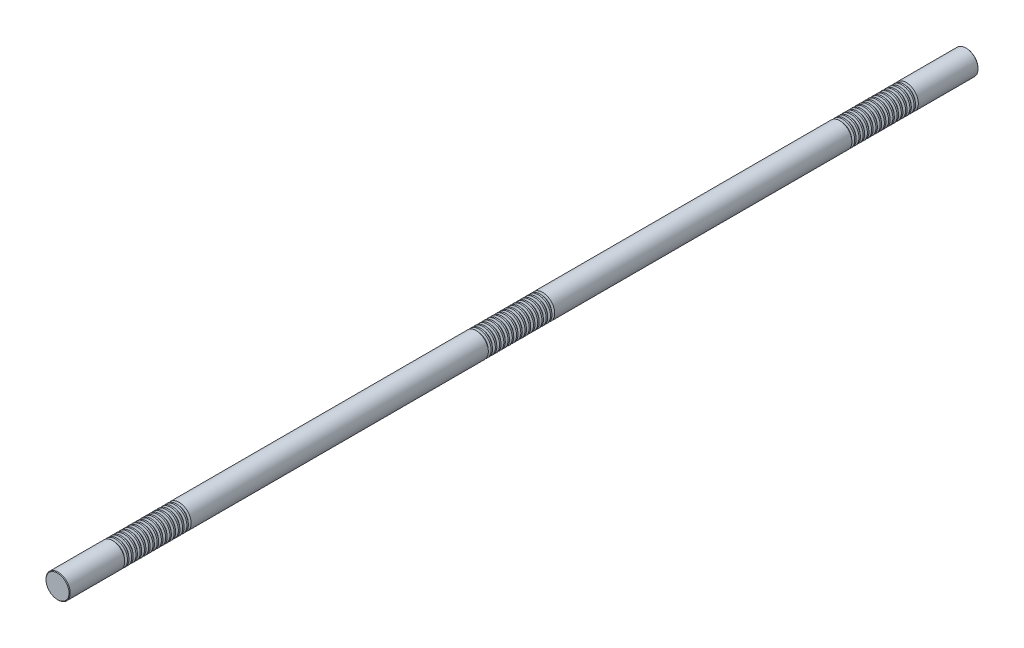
ISO-10303-21;
HEADER;
FILE_DESCRIPTION(('STEP AP214'),'2;1');
FILE_NAME('part.step','',(''),(''),'','','');
FILE_SCHEMA(('AUTOMOTIVE_DESIGN { 1 0 10303 214 1 1 1 1 }'));
ENDSEC;
DATA;
#1=APPLICATION_CONTEXT('core data for automotive mechanical design processes');
#2=APPLICATION_PROTOCOL_DEFINITION('international standard','automotive_design',2000,#1);
#3=PRODUCT_CONTEXT('',#1,'mechanical');
#4=PRODUCT('Part','Part','',(#3));
#5=PRODUCT_RELATED_PRODUCT_CATEGORY('part','',(#4));
#6=PRODUCT_DEFINITION_FORMATION('','',#4);
#7=PRODUCT_DEFINITION_CONTEXT('part definition',#1,'design');
#8=PRODUCT_DEFINITION('design','',#6,#7);
#9=PRODUCT_DEFINITION_SHAPE('','',#8);
#10=(LENGTH_UNIT() NAMED_UNIT(*) SI_UNIT(.MILLI.,.METRE.));
#11=(NAMED_UNIT(*) PLANE_ANGLE_UNIT() SI_UNIT($,.RADIAN.));
#12=(NAMED_UNIT(*) SI_UNIT($,.STERADIAN.) SOLID_ANGLE_UNIT());
#13=UNCERTAINTY_MEASURE_WITH_UNIT(LENGTH_MEASURE(1.E-05),#10,'distance_accuracy_value','');
#14=(GEOMETRIC_REPRESENTATION_CONTEXT(3) GLOBAL_UNCERTAINTY_ASSIGNED_CONTEXT((#13)) GLOBAL_UNIT_ASSIGNED_CONTEXT((#10,
#11,#12)) REPRESENTATION_CONTEXT('',''));
#15=CARTESIAN_POINT('',(0.,0.,0.));
#16=DIRECTION('',(0.,0.,1.));
#17=DIRECTION('',(1.,0.,0.));
#18=AXIS2_PLACEMENT_3D('',#15,#16,#17);
#19=CARTESIAN_POINT('',(0.,0.,750.));
#20=DIRECTION('',(0.,0.,-1.));
#21=DIRECTION('',(-1.,0.,0.));
#22=AXIS2_PLACEMENT_3D('',#19,#20,#21);
#23=CYLINDRICAL_SURFACE('',#22,20.);
#24=CARTESIAN_POINT('',(0.,0.,652.035898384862));
#25=DIRECTION('',(0.,0.,1.));
#26=DIRECTION('',(1.,0.,0.));
#27=AXIS2_PLACEMENT_3D('',#24,#25,#26);
#28=CIRCLE('',#27,20.);
#29=CARTESIAN_POINT('',(20.,0.,652.035898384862));
#30=VERTEX_POINT('',#29);
#31=EDGE_CURVE('E607',#30,#30,#28,.T.);
#32=ORIENTED_EDGE('',*,*,#31,.T.);
#33=EDGE_LOOP('',(#32));
#34=FACE_BOUND('',#33,.T.);
#35=CARTESIAN_POINT('',(0.,0.,654.464101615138));
#36=DIRECTION('',(0.,0.,1.));
#37=DIRECTION('',(1.,0.,0.));
#38=AXIS2_PLACEMENT_3D('',#35,#36,#37);
#39=CIRCLE('',#38,20.);
#40=CARTESIAN_POINT('',(20.,0.,654.464101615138));
#41=VERTEX_POINT('',#40);
#42=EDGE_CURVE('E616',#41,#41,#39,.T.);
#43=ORIENTED_EDGE('',*,*,#42,.F.);
#44=EDGE_LOOP('',(#43));
#45=FACE_BOUND('',#44,.T.);
#46=ADVANCED_FACE('F32',(#34,#45),#23,.T.);
#47=CARTESIAN_POINT('',(0.,0.,645.035898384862));
#48=DIRECTION('',(0.,0.,1.));
#49=DIRECTION('',(1.,0.,0.));
#50=AXIS2_PLACEMENT_3D('',#47,#48,#49);
#51=CIRCLE('',#50,20.);
#52=CARTESIAN_POINT('',(20.,0.,645.035898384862));
#53=VERTEX_POINT('',#52);
#54=EDGE_CURVE('E595',#53,#53,#51,.T.);
#55=ORIENTED_EDGE('',*,*,#54,.T.);
#56=EDGE_LOOP('',(#55));
#57=FACE_BOUND('',#56,.T.);
#58=CARTESIAN_POINT('',(0.,0.,647.464101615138));
#59=DIRECTION('',(0.,0.,1.));
#60=DIRECTION('',(1.,0.,0.));
#61=AXIS2_PLACEMENT_3D('',#58,#59,#60);
#62=CIRCLE('',#61,20.);
#63=CARTESIAN_POINT('',(20.,0.,647.464101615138));
#64=VERTEX_POINT('',#63);
#65=EDGE_CURVE('E604',#64,#64,#62,.T.);
#66=ORIENTED_EDGE('',*,*,#65,.F.);
#67=EDGE_LOOP('',(#66));
#68=FACE_BOUND('',#67,.T.);
#69=ADVANCED_FACE('F648',(#57,#68),#23,.T.);
#70=CARTESIAN_POINT('',(0.,0.,638.035898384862));
#71=DIRECTION('',(0.,0.,1.));
#72=DIRECTION('',(1.,0.,0.));
#73=AXIS2_PLACEMENT_3D('',#70,#71,#72);
#74=CIRCLE('',#73,20.);
#75=CARTESIAN_POINT('',(20.,0.,638.035898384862));
#76=VERTEX_POINT('',#75);
#77=EDGE_CURVE('E583',#76,#76,#74,.T.);
#78=ORIENTED_EDGE('',*,*,#77,.T.);
#79=EDGE_LOOP('',(#78));
#80=FACE_BOUND('',#79,.T.);
#81=CARTESIAN_POINT('',(0.,0.,640.464101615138));
#82=DIRECTION('',(0.,0.,1.));
#83=DIRECTION('',(1.,0.,0.));
#84=AXIS2_PLACEMENT_3D('',#81,#82,#83);
#85=CIRCLE('',#84,20.);
#86=CARTESIAN_POINT('',(20.,0.,640.464101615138));
#87=VERTEX_POINT('',#86);
#88=EDGE_CURVE('E592',#87,#87,#85,.T.);
#89=ORIENTED_EDGE('',*,*,#88,.F.);
#90=EDGE_LOOP('',(#89));
#91=FACE_BOUND('',#90,.T.);
#92=ADVANCED_FACE('F656',(#80,#91),#23,.T.);
#93=CARTESIAN_POINT('',(0.,0.,631.035898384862));
#94=DIRECTION('',(0.,0.,1.));
#95=DIRECTION('',(1.,0.,0.));
#96=AXIS2_PLACEMENT_3D('',#93,#94,#95);
#97=CIRCLE('',#96,20.);
#98=CARTESIAN_POINT('',(20.,0.,631.035898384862));
#99=VERTEX_POINT('',#98);
#100=EDGE_CURVE('E571',#99,#99,#97,.T.);
#101=ORIENTED_EDGE('',*,*,#100,.T.);
#102=EDGE_LOOP('',(#101));
#103=FACE_BOUND('',#102,.T.);
#104=CARTESIAN_POINT('',(0.,0.,633.464101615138));
#105=DIRECTION('',(0.,0.,1.));
#106=DIRECTION('',(1.,0.,0.));
#107=AXIS2_PLACEMENT_3D('',#104,#105,#106);
#108=CIRCLE('',#107,20.);
#109=CARTESIAN_POINT('',(20.,0.,633.464101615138));
#110=VERTEX_POINT('',#109);
#111=EDGE_CURVE('E580',#110,#110,#108,.T.);
#112=ORIENTED_EDGE('',*,*,#111,.F.);
#113=EDGE_LOOP('',(#112));
#114=FACE_BOUND('',#113,.T.);
#115=ADVANCED_FACE('F1663',(#103,#114),#23,.T.);
#116=CARTESIAN_POINT('',(0.,0.,624.035898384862));
#117=DIRECTION('',(0.,0.,1.));
#118=DIRECTION('',(1.,0.,0.));
#119=AXIS2_PLACEMENT_3D('',#116,#117,#118);
#120=CIRCLE('',#119,20.);
#121=CARTESIAN_POINT('',(20.,0.,624.035898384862));
#122=VERTEX_POINT('',#121);
#123=EDGE_CURVE('E559',#122,#122,#120,.T.);
#124=ORIENTED_EDGE('',*,*,#123,.T.);
#125=EDGE_LOOP('',(#124));
#126=FACE_BOUND('',#125,.T.);
#127=CARTESIAN_POINT('',(0.,0.,626.464101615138));
#128=DIRECTION('',(0.,0.,1.));
#129=DIRECTION('',(1.,0.,0.));
#130=AXIS2_PLACEMENT_3D('',#127,#128,#129);
#131=CIRCLE('',#130,20.);
#132=CARTESIAN_POINT('',(20.,0.,626.464101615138));
#133=VERTEX_POINT('',#132);
#134=EDGE_CURVE('E568',#133,#133,#131,.T.);
#135=ORIENTED_EDGE('',*,*,#134,.F.);
#136=EDGE_LOOP('',(#135));
#137=FACE_BOUND('',#136,.T.);
#138=ADVANCED_FACE('F1640',(#126,#137),#23,.T.);
#139=CARTESIAN_POINT('',(0.,0.,617.035898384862));
#140=DIRECTION('',(0.,0.,1.));
#141=DIRECTION('',(1.,0.,0.));
#142=AXIS2_PLACEMENT_3D('',#139,#140,#141);
#143=CIRCLE('',#142,20.);
#144=CARTESIAN_POINT('',(20.,0.,617.035898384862));
#145=VERTEX_POINT('',#144);
#146=EDGE_CURVE('E547',#145,#145,#143,.T.);
#147=ORIENTED_EDGE('',*,*,#146,.T.);
#148=EDGE_LOOP('',(#147));
#149=FACE_BOUND('',#148,.T.);
#150=CARTESIAN_POINT('',(0.,0.,619.464101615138));
#151=DIRECTION('',(0.,0.,1.));
#152=DIRECTION('',(1.,0.,0.));
#153=AXIS2_PLACEMENT_3D('',#150,#151,#152);
#154=CIRCLE('',#153,20.);
#155=CARTESIAN_POINT('',(20.,0.,619.464101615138));
#156=VERTEX_POINT('',#155);
#157=EDGE_CURVE('E556',#156,#156,#154,.T.);
#158=ORIENTED_EDGE('',*,*,#157,.F.);
#159=EDGE_LOOP('',(#158));
#160=FACE_BOUND('',#159,.T.);
#161=ADVANCED_FACE('F1617',(#149,#160),#23,.T.);
#162=CARTESIAN_POINT('',(0.,0.,610.035898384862));
#163=DIRECTION('',(0.,0.,1.));
#164=DIRECTION('',(1.,0.,0.));
#165=AXIS2_PLACEMENT_3D('',#162,#163,#164);
#166=CIRCLE('',#165,20.);
#167=CARTESIAN_POINT('',(20.,0.,610.035898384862));
#168=VERTEX_POINT('',#167);
#169=EDGE_CURVE('E535',#168,#168,#166,.T.);
#170=ORIENTED_EDGE('',*,*,#169,.T.);
#171=EDGE_LOOP('',(#170));
#172=FACE_BOUND('',#171,.T.);
#173=CARTESIAN_POINT('',(0.,0.,612.464101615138));
#174=DIRECTION('',(0.,0.,1.));
#175=DIRECTION('',(1.,0.,0.));
#176=AXIS2_PLACEMENT_3D('',#173,#174,#175);
#177=CIRCLE('',#176,20.);
#178=CARTESIAN_POINT('',(20.,0.,612.464101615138));
#179=VERTEX_POINT('',#178);
#180=EDGE_CURVE('E544',#179,#179,#177,.T.);
#181=ORIENTED_EDGE('',*,*,#180,.F.);
#182=EDGE_LOOP('',(#181));
#183=FACE_BOUND('',#182,.T.);
#184=ADVANCED_FACE('F1594',(#172,#183),#23,.T.);
#185=CARTESIAN_POINT('',(0.,0.,603.035898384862));
#186=DIRECTION('',(0.,0.,1.));
#187=DIRECTION('',(1.,0.,0.));
#188=AXIS2_PLACEMENT_3D('',#185,#186,#187);
#189=CIRCLE('',#188,20.);
#190=CARTESIAN_POINT('',(20.,0.,603.035898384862));
#191=VERTEX_POINT('',#190);
#192=EDGE_CURVE('E523',#191,#191,#189,.T.);
#193=ORIENTED_EDGE('',*,*,#192,.T.);
#194=EDGE_LOOP('',(#193));
#195=FACE_BOUND('',#194,.T.);
#196=CARTESIAN_POINT('',(0.,0.,605.464101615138));
#197=DIRECTION('',(0.,0.,1.));
#198=DIRECTION('',(1.,0.,0.));
#199=AXIS2_PLACEMENT_3D('',#196,#197,#198);
#200=CIRCLE('',#199,20.);
#201=CARTESIAN_POINT('',(20.,0.,605.464101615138));
#202=VERTEX_POINT('',#201);
#203=EDGE_CURVE('E532',#202,#202,#200,.T.);
#204=ORIENTED_EDGE('',*,*,#203,.F.);
#205=EDGE_LOOP('',(#204));
#206=FACE_BOUND('',#205,.T.);
#207=ADVANCED_FACE('F1571',(#195,#206),#23,.T.);
#208=CARTESIAN_POINT('',(0.,0.,596.035898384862));
#209=DIRECTION('',(0.,0.,1.));
#210=DIRECTION('',(1.,0.,0.));
#211=AXIS2_PLACEMENT_3D('',#208,#209,#210);
#212=CIRCLE('',#211,20.);
#213=CARTESIAN_POINT('',(20.,0.,596.035898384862));
#214=VERTEX_POINT('',#213);
#215=EDGE_CURVE('E511',#214,#214,#212,.T.);
#216=ORIENTED_EDGE('',*,*,#215,.T.);
#217=EDGE_LOOP('',(#216));
#218=FACE_BOUND('',#217,.T.);
#219=CARTESIAN_POINT('',(0.,0.,598.464101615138));
#220=DIRECTION('',(0.,0.,1.));
#221=DIRECTION('',(1.,0.,0.));
#222=AXIS2_PLACEMENT_3D('',#219,#220,#221);
#223=CIRCLE('',#222,20.);
#224=CARTESIAN_POINT('',(20.,0.,598.464101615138));
#225=VERTEX_POINT('',#224);
#226=EDGE_CURVE('E520',#225,#225,#223,.T.);
#227=ORIENTED_EDGE('',*,*,#226,.F.);
#228=EDGE_LOOP('',(#227));
#229=FACE_BOUND('',#228,.T.);
#230=ADVANCED_FACE('F1548',(#218,#229),#23,.T.);
#231=CARTESIAN_POINT('',(0.,0.,589.035898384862));
#232=DIRECTION('',(0.,0.,1.));
#233=DIRECTION('',(1.,0.,0.));
#234=AXIS2_PLACEMENT_3D('',#231,#232,#233);
#235=CIRCLE('',#234,20.);
#236=CARTESIAN_POINT('',(20.,0.,589.035898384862));
#237=VERTEX_POINT('',#236);
#238=EDGE_CURVE('E499',#237,#237,#235,.T.);
#239=ORIENTED_EDGE('',*,*,#238,.T.);
#240=EDGE_LOOP('',(#239));
#241=FACE_BOUND('',#240,.T.);
#242=CARTESIAN_POINT('',(0.,0.,591.464101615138));
#243=DIRECTION('',(0.,0.,1.));
#244=DIRECTION('',(1.,0.,0.));
#245=AXIS2_PLACEMENT_3D('',#242,#243,#244);
#246=CIRCLE('',#245,20.);
#247=CARTESIAN_POINT('',(20.,0.,591.464101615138));
#248=VERTEX_POINT('',#247);
#249=EDGE_CURVE('E508',#248,#248,#246,.T.);
#250=ORIENTED_EDGE('',*,*,#249,.F.);
#251=EDGE_LOOP('',(#250));
#252=FACE_BOUND('',#251,.T.);
#253=ADVANCED_FACE('F1525',(#241,#252),#23,.T.);
#254=CARTESIAN_POINT('',(0.,0.,582.035898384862));
#255=DIRECTION('',(0.,0.,1.));
#256=DIRECTION('',(1.,0.,0.));
#257=AXIS2_PLACEMENT_3D('',#254,#255,#256);
#258=CIRCLE('',#257,20.);
#259=CARTESIAN_POINT('',(20.,0.,582.035898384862));
#260=VERTEX_POINT('',#259);
#261=EDGE_CURVE('E487',#260,#260,#258,.T.);
#262=ORIENTED_EDGE('',*,*,#261,.T.);
#263=EDGE_LOOP('',(#262));
#264=FACE_BOUND('',#263,.T.);
#265=CARTESIAN_POINT('',(0.,0.,584.464101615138));
#266=DIRECTION('',(0.,0.,1.));
#267=DIRECTION('',(1.,0.,0.));
#268=AXIS2_PLACEMENT_3D('',#265,#266,#267);
#269=CIRCLE('',#268,20.);
#270=CARTESIAN_POINT('',(20.,0.,584.464101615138));
#271=VERTEX_POINT('',#270);
#272=EDGE_CURVE('E496',#271,#271,#269,.T.);
#273=ORIENTED_EDGE('',*,*,#272,.F.);
#274=EDGE_LOOP('',(#273));
#275=FACE_BOUND('',#274,.T.);
#276=ADVANCED_FACE('F1502',(#264,#275),#23,.T.);
#277=CARTESIAN_POINT('',(0.,0.,575.035898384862));
#278=DIRECTION('',(0.,0.,1.));
#279=DIRECTION('',(1.,0.,0.));
#280=AXIS2_PLACEMENT_3D('',#277,#278,#279);
#281=CIRCLE('',#280,20.);
#282=CARTESIAN_POINT('',(20.,0.,575.035898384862));
#283=VERTEX_POINT('',#282);
#284=EDGE_CURVE('E475',#283,#283,#281,.T.);
#285=ORIENTED_EDGE('',*,*,#284,.T.);
#286=EDGE_LOOP('',(#285));
#287=FACE_BOUND('',#286,.T.);
#288=CARTESIAN_POINT('',(0.,0.,577.464101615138));
#289=DIRECTION('',(0.,0.,1.));
#290=DIRECTION('',(1.,0.,0.));
#291=AXIS2_PLACEMENT_3D('',#288,#289,#290);
#292=CIRCLE('',#291,20.);
#293=CARTESIAN_POINT('',(20.,0.,577.464101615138));
#294=VERTEX_POINT('',#293);
#295=EDGE_CURVE('E484',#294,#294,#292,.T.);
#296=ORIENTED_EDGE('',*,*,#295,.F.);
#297=EDGE_LOOP('',(#296));
#298=FACE_BOUND('',#297,.T.);
#299=ADVANCED_FACE('F1479',(#287,#298),#23,.T.);
#300=CARTESIAN_POINT('',(0.,0.,568.035898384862));
#301=DIRECTION('',(0.,0.,1.));
#302=DIRECTION('',(1.,0.,0.));
#303=AXIS2_PLACEMENT_3D('',#300,#301,#302);
#304=CIRCLE('',#303,20.);
#305=CARTESIAN_POINT('',(20.,0.,568.035898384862));
#306=VERTEX_POINT('',#305);
#307=EDGE_CURVE('E463',#306,#306,#304,.T.);
#308=ORIENTED_EDGE('',*,*,#307,.T.);
#309=EDGE_LOOP('',(#308));
#310=FACE_BOUND('',#309,.T.);
#311=CARTESIAN_POINT('',(0.,0.,570.464101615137));
#312=DIRECTION('',(0.,0.,1.));
#313=DIRECTION('',(1.,0.,0.));
#314=AXIS2_PLACEMENT_3D('',#311,#312,#313);
#315=CIRCLE('',#314,20.);
#316=CARTESIAN_POINT('',(20.,0.,570.464101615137));
#317=VERTEX_POINT('',#316);
#318=EDGE_CURVE('E472',#317,#317,#315,.T.);
#319=ORIENTED_EDGE('',*,*,#318,.F.);
#320=EDGE_LOOP('',(#319));
#321=FACE_BOUND('',#320,.T.);
#322=ADVANCED_FACE('F1456',(#310,#321),#23,.T.);
#323=CARTESIAN_POINT('',(0.,0.,561.035898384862));
#324=DIRECTION('',(0.,0.,1.));
#325=DIRECTION('',(1.,0.,0.));
#326=AXIS2_PLACEMENT_3D('',#323,#324,#325);
#327=CIRCLE('',#326,20.);
#328=CARTESIAN_POINT('',(20.,0.,561.035898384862));
#329=VERTEX_POINT('',#328);
#330=EDGE_CURVE('E451',#329,#329,#327,.T.);
#331=ORIENTED_EDGE('',*,*,#330,.T.);
#332=EDGE_LOOP('',(#331));
#333=FACE_BOUND('',#332,.T.);
#334=CARTESIAN_POINT('',(0.,0.,563.464101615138));
#335=DIRECTION('',(0.,0.,1.));
#336=DIRECTION('',(1.,0.,0.));
#337=AXIS2_PLACEMENT_3D('',#334,#335,#336);
#338=CIRCLE('',#337,20.);
#339=CARTESIAN_POINT('',(20.,0.,563.464101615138));
#340=VERTEX_POINT('',#339);
#341=EDGE_CURVE('E460',#340,#340,#338,.T.);
#342=ORIENTED_EDGE('',*,*,#341,.F.);
#343=EDGE_LOOP('',(#342));
#344=FACE_BOUND('',#343,.T.);
#345=ADVANCED_FACE('F1437',(#333,#344),#23,.T.);
#346=CARTESIAN_POINT('',(0.,0.,554.035898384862));
#347=DIRECTION('',(0.,0.,1.));
#348=DIRECTION('',(1.,0.,0.));
#349=AXIS2_PLACEMENT_3D('',#346,#347,#348);
#350=CIRCLE('',#349,20.);
#351=CARTESIAN_POINT('',(20.,0.,554.035898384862));
#352=VERTEX_POINT('',#351);
#353=EDGE_CURVE('E259',#352,#352,#350,.T.);
#354=ORIENTED_EDGE('',*,*,#353,.T.);
#355=EDGE_LOOP('',(#354));
#356=FACE_BOUND('',#355,.T.);
#357=CARTESIAN_POINT('',(0.,0.,556.464101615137));
#358=DIRECTION('',(0.,0.,1.));
#359=DIRECTION('',(1.,0.,0.));
#360=AXIS2_PLACEMENT_3D('',#357,#358,#359);
#361=CIRCLE('',#360,20.);
#362=CARTESIAN_POINT('',(20.,0.,556.464101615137));
#363=VERTEX_POINT('',#362);
#364=EDGE_CURVE('E448',#363,#363,#361,.T.);
#365=ORIENTED_EDGE('',*,*,#364,.F.);
#366=EDGE_LOOP('',(#365));
#367=FACE_BOUND('',#366,.T.);
#368=ADVANCED_FACE('F1386',(#356,#367),#23,.T.);
#369=CARTESIAN_POINT('',(0.,0.,52.0358983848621));
#370=DIRECTION('',(0.,0.,1.));
#371=DIRECTION('',(1.,0.,0.));
#372=AXIS2_PLACEMENT_3D('',#369,#370,#371);
#373=CIRCLE('',#372,20.);
#374=CARTESIAN_POINT('',(20.,0.,52.0358983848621));
#375=VERTEX_POINT('',#374);
#376=EDGE_CURVE('E427',#375,#375,#373,.T.);
#377=ORIENTED_EDGE('',*,*,#376,.T.);
#378=EDGE_LOOP('',(#377));
#379=FACE_BOUND('',#378,.T.);
#380=CARTESIAN_POINT('',(0.,0.,54.4641016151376));
#381=DIRECTION('',(0.,0.,1.));
#382=DIRECTION('',(1.,0.,0.));
#383=AXIS2_PLACEMENT_3D('',#380,#381,#382);
#384=CIRCLE('',#383,20.);
#385=CARTESIAN_POINT('',(20.,0.,54.4641016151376));
#386=VERTEX_POINT('',#385);
#387=EDGE_CURVE('E436',#386,#386,#384,.T.);
#388=ORIENTED_EDGE('',*,*,#387,.F.);
#389=EDGE_LOOP('',(#388));
#390=FACE_BOUND('',#389,.T.);
#391=ADVANCED_FACE('F1362',(#379,#390),#23,.T.);
#392=CARTESIAN_POINT('',(0.,0.,45.0358983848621));
#393=DIRECTION('',(0.,0.,1.));
#394=DIRECTION('',(1.,0.,0.));
#395=AXIS2_PLACEMENT_3D('',#392,#393,#394);
#396=CIRCLE('',#395,20.);
#397=CARTESIAN_POINT('',(20.,0.,45.0358983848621));
#398=VERTEX_POINT('',#397);
#399=EDGE_CURVE('E415',#398,#398,#396,.T.);
#400=ORIENTED_EDGE('',*,*,#399,.T.);
#401=EDGE_LOOP('',(#400));
#402=FACE_BOUND('',#401,.T.);
#403=CARTESIAN_POINT('',(0.,0.,47.4641016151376));
#404=DIRECTION('',(0.,0.,1.));
#405=DIRECTION('',(1.,0.,0.));
#406=AXIS2_PLACEMENT_3D('',#403,#404,#405);
#407=CIRCLE('',#406,20.);
#408=CARTESIAN_POINT('',(20.,0.,47.4641016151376));
#409=VERTEX_POINT('',#408);
#410=EDGE_CURVE('E424',#409,#409,#407,.T.);
#411=ORIENTED_EDGE('',*,*,#410,.F.);
#412=EDGE_LOOP('',(#411));
#413=FACE_BOUND('',#412,.T.);
#414=ADVANCED_FACE('F1339',(#402,#413),#23,.T.);
#415=CARTESIAN_POINT('',(0.,0.,38.0358983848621));
#416=DIRECTION('',(0.,0.,1.));
#417=DIRECTION('',(1.,0.,0.));
#418=AXIS2_PLACEMENT_3D('',#415,#416,#417);
#419=CIRCLE('',#418,20.);
#420=CARTESIAN_POINT('',(20.,0.,38.0358983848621));
#421=VERTEX_POINT('',#420);
#422=EDGE_CURVE('E403',#421,#421,#419,.T.);
#423=ORIENTED_EDGE('',*,*,#422,.T.);
#424=EDGE_LOOP('',(#423));
#425=FACE_BOUND('',#424,.T.);
#426=CARTESIAN_POINT('',(0.,0.,40.4641016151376));
#427=DIRECTION('',(0.,0.,1.));
#428=DIRECTION('',(1.,0.,0.));
#429=AXIS2_PLACEMENT_3D('',#426,#427,#428);
#430=CIRCLE('',#429,20.);
#431=CARTESIAN_POINT('',(20.,0.,40.4641016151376));
#432=VERTEX_POINT('',#431);
#433=EDGE_CURVE('E412',#432,#432,#430,.T.);
#434=ORIENTED_EDGE('',*,*,#433,.F.);
#435=EDGE_LOOP('',(#434));
#436=FACE_BOUND('',#435,.T.);
#437=ADVANCED_FACE('F1316',(#425,#436),#23,.T.);
#438=CARTESIAN_POINT('',(0.,0.,31.0358983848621));
#439=DIRECTION('',(0.,0.,1.));
#440=DIRECTION('',(1.,0.,0.));
#441=AXIS2_PLACEMENT_3D('',#438,#439,#440);
#442=CIRCLE('',#441,20.);
#443=CARTESIAN_POINT('',(20.,0.,31.0358983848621));
#444=VERTEX_POINT('',#443);
#445=EDGE_CURVE('E391',#444,#444,#442,.T.);
#446=ORIENTED_EDGE('',*,*,#445,.T.);
#447=EDGE_LOOP('',(#446));
#448=FACE_BOUND('',#447,.T.);
#449=CARTESIAN_POINT('',(0.,0.,33.4641016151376));
#450=DIRECTION('',(0.,0.,1.));
#451=DIRECTION('',(1.,0.,0.));
#452=AXIS2_PLACEMENT_3D('',#449,#450,#451);
#453=CIRCLE('',#452,20.);
#454=CARTESIAN_POINT('',(20.,0.,33.4641016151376));
#455=VERTEX_POINT('',#454);
#456=EDGE_CURVE('E400',#455,#455,#453,.T.);
#457=ORIENTED_EDGE('',*,*,#456,.F.);
#458=EDGE_LOOP('',(#457));
#459=FACE_BOUND('',#458,.T.);
#460=ADVANCED_FACE('F1293',(#448,#459),#23,.T.);
#461=CARTESIAN_POINT('',(0.,0.,24.0358983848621));
#462=DIRECTION('',(0.,0.,1.));
#463=DIRECTION('',(1.,0.,0.));
#464=AXIS2_PLACEMENT_3D('',#461,#462,#463);
#465=CIRCLE('',#464,20.);
#466=CARTESIAN_POINT('',(20.,0.,24.0358983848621));
#467=VERTEX_POINT('',#466);
#468=EDGE_CURVE('E379',#467,#467,#465,.T.);
#469=ORIENTED_EDGE('',*,*,#468,.T.);
#470=EDGE_LOOP('',(#469));
#471=FACE_BOUND('',#470,.T.);
#472=CARTESIAN_POINT('',(0.,0.,26.4641016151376));
#473=DIRECTION('',(0.,0.,1.));
#474=DIRECTION('',(1.,0.,0.));
#475=AXIS2_PLACEMENT_3D('',#472,#473,#474);
#476=CIRCLE('',#475,20.);
#477=CARTESIAN_POINT('',(20.,0.,26.4641016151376));
#478=VERTEX_POINT('',#477);
#479=EDGE_CURVE('E388',#478,#478,#476,.T.);
#480=ORIENTED_EDGE('',*,*,#479,.F.);
#481=EDGE_LOOP('',(#480));
#482=FACE_BOUND('',#481,.T.);
#483=ADVANCED_FACE('F1270',(#471,#482),#23,.T.);
#484=CARTESIAN_POINT('',(0.,0.,17.0358983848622));
#485=DIRECTION('',(0.,0.,1.));
#486=DIRECTION('',(1.,0.,0.));
#487=AXIS2_PLACEMENT_3D('',#484,#485,#486);
#488=CIRCLE('',#487,20.);
#489=CARTESIAN_POINT('',(20.,0.,17.0358983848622));
#490=VERTEX_POINT('',#489);
#491=EDGE_CURVE('E367',#490,#490,#488,.T.);
#492=ORIENTED_EDGE('',*,*,#491,.T.);
#493=EDGE_LOOP('',(#492));
#494=FACE_BOUND('',#493,.T.);
#495=CARTESIAN_POINT('',(0.,0.,19.4641016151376));
#496=DIRECTION('',(0.,0.,1.));
#497=DIRECTION('',(1.,0.,0.));
#498=AXIS2_PLACEMENT_3D('',#495,#496,#497);
#499=CIRCLE('',#498,20.);
#500=CARTESIAN_POINT('',(20.,0.,19.4641016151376));
#501=VERTEX_POINT('',#500);
#502=EDGE_CURVE('E376',#501,#501,#499,.T.);
#503=ORIENTED_EDGE('',*,*,#502,.F.);
#504=EDGE_LOOP('',(#503));
#505=FACE_BOUND('',#504,.T.);
#506=ADVANCED_FACE('F1247',(#494,#505),#23,.T.);
#507=CARTESIAN_POINT('',(0.,0.,10.0358983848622));
#508=DIRECTION('',(0.,0.,1.));
#509=DIRECTION('',(1.,0.,0.));
#510=AXIS2_PLACEMENT_3D('',#507,#508,#509);
#511=CIRCLE('',#510,20.);
#512=CARTESIAN_POINT('',(20.,0.,10.0358983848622));
#513=VERTEX_POINT('',#512);
#514=EDGE_CURVE('E355',#513,#513,#511,.T.);
#515=ORIENTED_EDGE('',*,*,#514,.T.);
#516=EDGE_LOOP('',(#515));
#517=FACE_BOUND('',#516,.T.);
#518=CARTESIAN_POINT('',(0.,0.,12.4641016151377));
#519=DIRECTION('',(0.,0.,1.));
#520=DIRECTION('',(1.,0.,0.));
#521=AXIS2_PLACEMENT_3D('',#518,#519,#520);
#522=CIRCLE('',#521,20.);
#523=CARTESIAN_POINT('',(20.,0.,12.4641016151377));
#524=VERTEX_POINT('',#523);
#525=EDGE_CURVE('E364',#524,#524,#522,.T.);
#526=ORIENTED_EDGE('',*,*,#525,.F.);
#527=EDGE_LOOP('',(#526));
#528=FACE_BOUND('',#527,.T.);
#529=ADVANCED_FACE('F1224',(#517,#528),#23,.T.);
#530=CARTESIAN_POINT('',(0.,0.,3.03589838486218));
#531=DIRECTION('',(0.,0.,1.));
#532=DIRECTION('',(1.,0.,0.));
#533=AXIS2_PLACEMENT_3D('',#530,#531,#532);
#534=CIRCLE('',#533,20.);
#535=CARTESIAN_POINT('',(20.,0.,3.03589838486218));
#536=VERTEX_POINT('',#535);
#537=EDGE_CURVE('E343',#536,#536,#534,.T.);
#538=ORIENTED_EDGE('',*,*,#537,.T.);
#539=EDGE_LOOP('',(#538));
#540=FACE_BOUND('',#539,.T.);
#541=CARTESIAN_POINT('',(0.,0.,5.46410161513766));
#542=DIRECTION('',(0.,0.,1.));
#543=DIRECTION('',(1.,0.,0.));
#544=AXIS2_PLACEMENT_3D('',#541,#542,#543);
#545=CIRCLE('',#544,20.);
#546=CARTESIAN_POINT('',(20.,0.,5.46410161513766));
#547=VERTEX_POINT('',#546);
#548=EDGE_CURVE('E352',#547,#547,#545,.T.);
#549=ORIENTED_EDGE('',*,*,#548,.F.);
#550=EDGE_LOOP('',(#549));
#551=FACE_BOUND('',#550,.T.);
#552=ADVANCED_FACE('F1201',(#540,#551),#23,.T.);
#553=CARTESIAN_POINT('',(0.,0.,-3.96410161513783));
#554=DIRECTION('',(0.,0.,1.));
#555=DIRECTION('',(1.,0.,0.));
#556=AXIS2_PLACEMENT_3D('',#553,#554,#555);
#557=CIRCLE('',#556,20.);
#558=CARTESIAN_POINT('',(20.,0.,-3.96410161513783));
#559=VERTEX_POINT('',#558);
#560=EDGE_CURVE('E331',#559,#559,#557,.T.);
#561=ORIENTED_EDGE('',*,*,#560,.T.);
#562=EDGE_LOOP('',(#561));
#563=FACE_BOUND('',#562,.T.);
#564=CARTESIAN_POINT('',(0.,0.,-1.53589838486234));
#565=DIRECTION('',(0.,0.,1.));
#566=DIRECTION('',(1.,0.,0.));
#567=AXIS2_PLACEMENT_3D('',#564,#565,#566);
#568=CIRCLE('',#567,20.);
#569=CARTESIAN_POINT('',(20.,0.,-1.53589838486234));
#570=VERTEX_POINT('',#569);
#571=EDGE_CURVE('E340',#570,#570,#568,.T.);
#572=ORIENTED_EDGE('',*,*,#571,.F.);
#573=EDGE_LOOP('',(#572));
#574=FACE_BOUND('',#573,.T.);
#575=ADVANCED_FACE('F1178',(#563,#574),#23,.T.);
#576=CARTESIAN_POINT('',(0.,0.,-10.9641016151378));
#577=DIRECTION('',(0.,0.,1.));
#578=DIRECTION('',(1.,0.,0.));
#579=AXIS2_PLACEMENT_3D('',#576,#577,#578);
#580=CIRCLE('',#579,20.);
#581=CARTESIAN_POINT('',(20.,0.,-10.9641016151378));
#582=VERTEX_POINT('',#581);
#583=EDGE_CURVE('E319',#582,#582,#580,.T.);
#584=ORIENTED_EDGE('',*,*,#583,.T.);
#585=EDGE_LOOP('',(#584));
#586=FACE_BOUND('',#585,.T.);
#587=CARTESIAN_POINT('',(0.,0.,-8.53589838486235));
#588=DIRECTION('',(0.,0.,1.));
#589=DIRECTION('',(1.,0.,0.));
#590=AXIS2_PLACEMENT_3D('',#587,#588,#589);
#591=CIRCLE('',#590,20.);
#592=CARTESIAN_POINT('',(20.,0.,-8.53589838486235));
#593=VERTEX_POINT('',#592);
#594=EDGE_CURVE('E328',#593,#593,#591,.T.);
#595=ORIENTED_EDGE('',*,*,#594,.F.);
#596=EDGE_LOOP('',(#595));
#597=FACE_BOUND('',#596,.T.);
#598=ADVANCED_FACE('F1155',(#586,#597),#23,.T.);
#599=CARTESIAN_POINT('',(0.,0.,-17.9641016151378));
#600=DIRECTION('',(0.,0.,1.));
#601=DIRECTION('',(1.,0.,0.));
#602=AXIS2_PLACEMENT_3D('',#599,#600,#601);
#603=CIRCLE('',#602,20.);
#604=CARTESIAN_POINT('',(20.,0.,-17.9641016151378));
#605=VERTEX_POINT('',#604);
#606=EDGE_CURVE('E307',#605,#605,#603,.T.);
#607=ORIENTED_EDGE('',*,*,#606,.T.);
#608=EDGE_LOOP('',(#607));
#609=FACE_BOUND('',#608,.T.);
#610=CARTESIAN_POINT('',(0.,0.,-15.5358983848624));
#611=DIRECTION('',(0.,0.,1.));
#612=DIRECTION('',(1.,0.,0.));
#613=AXIS2_PLACEMENT_3D('',#610,#611,#612);
#614=CIRCLE('',#613,20.);
#615=CARTESIAN_POINT('',(20.,0.,-15.5358983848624));
#616=VERTEX_POINT('',#615);
#617=EDGE_CURVE('E316',#616,#616,#614,.T.);
#618=ORIENTED_EDGE('',*,*,#617,.F.);
#619=EDGE_LOOP('',(#618));
#620=FACE_BOUND('',#619,.T.);
#621=ADVANCED_FACE('F1132',(#609,#620),#23,.T.);
#622=CARTESIAN_POINT('',(0.,0.,-24.9641016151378));
#623=DIRECTION('',(0.,0.,1.));
#624=DIRECTION('',(1.,0.,0.));
#625=AXIS2_PLACEMENT_3D('',#622,#623,#624);
#626=CIRCLE('',#625,20.);
#627=CARTESIAN_POINT('',(20.,0.,-24.9641016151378));
#628=VERTEX_POINT('',#627);
#629=EDGE_CURVE('E295',#628,#628,#626,.T.);
#630=ORIENTED_EDGE('',*,*,#629,.T.);
#631=EDGE_LOOP('',(#630));
#632=FACE_BOUND('',#631,.T.);
#633=CARTESIAN_POINT('',(0.,0.,-22.5358983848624));
#634=DIRECTION('',(0.,0.,1.));
#635=DIRECTION('',(1.,0.,0.));
#636=AXIS2_PLACEMENT_3D('',#633,#634,#635);
#637=CIRCLE('',#636,20.);
#638=CARTESIAN_POINT('',(20.,0.,-22.5358983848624));
#639=VERTEX_POINT('',#638);
#640=EDGE_CURVE('E304',#639,#639,#637,.T.);
#641=ORIENTED_EDGE('',*,*,#640,.F.);
#642=EDGE_LOOP('',(#641));
#643=FACE_BOUND('',#642,.T.);
#644=ADVANCED_FACE('F1109',(#632,#643),#23,.T.);
#645=CARTESIAN_POINT('',(0.,0.,-31.9641016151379));
#646=DIRECTION('',(0.,0.,1.));
#647=DIRECTION('',(1.,0.,0.));
#648=AXIS2_PLACEMENT_3D('',#645,#646,#647);
#649=CIRCLE('',#648,20.);
#650=CARTESIAN_POINT('',(20.,0.,-31.9641016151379));
#651=VERTEX_POINT('',#650);
#652=EDGE_CURVE('E283',#651,#651,#649,.T.);
#653=ORIENTED_EDGE('',*,*,#652,.T.);
#654=EDGE_LOOP('',(#653));
#655=FACE_BOUND('',#654,.T.);
#656=CARTESIAN_POINT('',(0.,0.,-29.5358983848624));
#657=DIRECTION('',(0.,0.,1.));
#658=DIRECTION('',(1.,0.,0.));
#659=AXIS2_PLACEMENT_3D('',#656,#657,#658);
#660=CIRCLE('',#659,20.);
#661=CARTESIAN_POINT('',(20.,0.,-29.5358983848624));
#662=VERTEX_POINT('',#661);
#663=EDGE_CURVE('E292',#662,#662,#660,.T.);
#664=ORIENTED_EDGE('',*,*,#663,.F.);
#665=EDGE_LOOP('',(#664));
#666=FACE_BOUND('',#665,.T.);
#667=ADVANCED_FACE('F1086',(#655,#666),#23,.T.);
#668=CARTESIAN_POINT('',(0.,0.,-38.9641016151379));
#669=DIRECTION('',(0.,0.,1.));
#670=DIRECTION('',(1.,0.,0.));
#671=AXIS2_PLACEMENT_3D('',#668,#669,#670);
#672=CIRCLE('',#671,20.);
#673=CARTESIAN_POINT('',(20.,0.,-38.9641016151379));
#674=VERTEX_POINT('',#673);
#675=EDGE_CURVE('E271',#674,#674,#672,.T.);
#676=ORIENTED_EDGE('',*,*,#675,.T.);
#677=EDGE_LOOP('',(#676));
#678=FACE_BOUND('',#677,.T.);
#679=CARTESIAN_POINT('',(0.,0.,-36.5358983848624));
#680=DIRECTION('',(0.,0.,1.));
#681=DIRECTION('',(1.,0.,0.));
#682=AXIS2_PLACEMENT_3D('',#679,#680,#681);
#683=CIRCLE('',#682,20.);
#684=CARTESIAN_POINT('',(20.,0.,-36.5358983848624));
#685=VERTEX_POINT('',#684);
#686=EDGE_CURVE('E280',#685,#685,#683,.T.);
#687=ORIENTED_EDGE('',*,*,#686,.F.);
#688=EDGE_LOOP('',(#687));
#689=FACE_BOUND('',#688,.T.);
#690=ADVANCED_FACE('F1063',(#678,#689),#23,.T.);
#691=CARTESIAN_POINT('',(0.,0.,-45.9641016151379));
#692=DIRECTION('',(0.,0.,1.));
#693=DIRECTION('',(1.,0.,0.));
#694=AXIS2_PLACEMENT_3D('',#691,#692,#693);
#695=CIRCLE('',#694,20.);
#696=CARTESIAN_POINT('',(20.,0.,-45.9641016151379));
#697=VERTEX_POINT('',#696);
#698=EDGE_CURVE('E247',#697,#697,#695,.T.);
#699=ORIENTED_EDGE('',*,*,#698,.T.);
#700=EDGE_LOOP('',(#699));
#701=FACE_BOUND('',#700,.T.);
#702=CARTESIAN_POINT('',(0.,0.,-43.5358983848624));
#703=DIRECTION('',(0.,0.,1.));
#704=DIRECTION('',(1.,0.,0.));
#705=AXIS2_PLACEMENT_3D('',#702,#703,#704);
#706=CIRCLE('',#705,20.);
#707=CARTESIAN_POINT('',(20.,0.,-43.5358983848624));
#708=VERTEX_POINT('',#707);
#709=EDGE_CURVE('E268',#708,#708,#706,.T.);
#710=ORIENTED_EDGE('',*,*,#709,.F.);
#711=EDGE_LOOP('',(#710));
#712=FACE_BOUND('',#711,.T.);
#713=ADVANCED_FACE('F1040',(#701,#712),#23,.T.);
#714=CARTESIAN_POINT('',(0.,0.,-540.964101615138));
#715=DIRECTION('',(0.,0.,1.));
#716=DIRECTION('',(1.,0.,0.));
#717=AXIS2_PLACEMENT_3D('',#714,#715,#716);
#718=CIRCLE('',#717,20.);
#719=CARTESIAN_POINT('',(20.,0.,-540.964101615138));
#720=VERTEX_POINT('',#719);
#721=EDGE_CURVE('E235',#720,#720,#718,.T.);
#722=ORIENTED_EDGE('',*,*,#721,.T.);
#723=EDGE_LOOP('',(#722));
#724=FACE_BOUND('',#723,.T.);
#725=CARTESIAN_POINT('',(0.,0.,-50.5358983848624));
#726=DIRECTION('',(0.,0.,1.));
#727=DIRECTION('',(1.,0.,0.));
#728=AXIS2_PLACEMENT_3D('',#725,#726,#727);
#729=CIRCLE('',#728,20.);
#730=CARTESIAN_POINT('',(20.,0.,-50.5358983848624));
#731=VERTEX_POINT('',#730);
#732=EDGE_CURVE('E244',#731,#731,#729,.T.);
#733=ORIENTED_EDGE('',*,*,#732,.F.);
#734=EDGE_LOOP('',(#733));
#735=FACE_BOUND('',#734,.T.);
#736=ADVANCED_FACE('F1017',(#724,#735),#23,.T.);
#737=CARTESIAN_POINT('',(0.,0.,-547.964101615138));
#738=DIRECTION('',(0.,0.,1.));
#739=DIRECTION('',(1.,0.,0.));
#740=AXIS2_PLACEMENT_3D('',#737,#738,#739);
#741=CIRCLE('',#740,20.);
#742=CARTESIAN_POINT('',(20.,0.,-547.964101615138));
#743=VERTEX_POINT('',#742);
#744=EDGE_CURVE('E223',#743,#743,#741,.T.);
#745=ORIENTED_EDGE('',*,*,#744,.T.);
#746=EDGE_LOOP('',(#745));
#747=FACE_BOUND('',#746,.T.);
#748=CARTESIAN_POINT('',(0.,0.,-545.535898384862));
#749=DIRECTION('',(0.,0.,1.));
#750=DIRECTION('',(1.,0.,0.));
#751=AXIS2_PLACEMENT_3D('',#748,#749,#750);
#752=CIRCLE('',#751,20.);
#753=CARTESIAN_POINT('',(20.,0.,-545.535898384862));
#754=VERTEX_POINT('',#753);
#755=EDGE_CURVE('E232',#754,#754,#752,.T.);
#756=ORIENTED_EDGE('',*,*,#755,.F.);
#757=EDGE_LOOP('',(#756));
#758=FACE_BOUND('',#757,.T.);
#759=ADVANCED_FACE('F994',(#747,#758),#23,.T.);
#760=CARTESIAN_POINT('',(0.,0.,-554.964101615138));
#761=DIRECTION('',(0.,0.,1.));
#762=DIRECTION('',(1.,0.,0.));
#763=AXIS2_PLACEMENT_3D('',#760,#761,#762);
#764=CIRCLE('',#763,20.);
#765=CARTESIAN_POINT('',(20.,0.,-554.964101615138));
#766=VERTEX_POINT('',#765);
#767=EDGE_CURVE('E211',#766,#766,#764,.T.);
#768=ORIENTED_EDGE('',*,*,#767,.T.);
#769=EDGE_LOOP('',(#768));
#770=FACE_BOUND('',#769,.T.);
#771=CARTESIAN_POINT('',(0.,0.,-552.535898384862));
#772=DIRECTION('',(0.,0.,1.));
#773=DIRECTION('',(1.,0.,0.));
#774=AXIS2_PLACEMENT_3D('',#771,#772,#773);
#775=CIRCLE('',#774,20.);
#776=CARTESIAN_POINT('',(20.,0.,-552.535898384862));
#777=VERTEX_POINT('',#776);
#778=EDGE_CURVE('E220',#777,#777,#775,.T.);
#779=ORIENTED_EDGE('',*,*,#778,.F.);
#780=EDGE_LOOP('',(#779));
#781=FACE_BOUND('',#780,.T.);
#782=ADVANCED_FACE('F971',(#770,#781),#23,.T.);
#783=CARTESIAN_POINT('',(0.,0.,-561.964101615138));
#784=DIRECTION('',(0.,0.,1.));
#785=DIRECTION('',(1.,0.,0.));
#786=AXIS2_PLACEMENT_3D('',#783,#784,#785);
#787=CIRCLE('',#786,20.);
#788=CARTESIAN_POINT('',(20.,0.,-561.964101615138));
#789=VERTEX_POINT('',#788);
#790=EDGE_CURVE('E199',#789,#789,#787,.T.);
#791=ORIENTED_EDGE('',*,*,#790,.T.);
#792=EDGE_LOOP('',(#791));
#793=FACE_BOUND('',#792,.T.);
#794=CARTESIAN_POINT('',(0.,0.,-559.535898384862));
#795=DIRECTION('',(0.,0.,1.));
#796=DIRECTION('',(1.,0.,0.));
#797=AXIS2_PLACEMENT_3D('',#794,#795,#796);
#798=CIRCLE('',#797,20.);
#799=CARTESIAN_POINT('',(20.,0.,-559.535898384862));
#800=VERTEX_POINT('',#799);
#801=EDGE_CURVE('E208',#800,#800,#798,.T.);
#802=ORIENTED_EDGE('',*,*,#801,.F.);
#803=EDGE_LOOP('',(#802));
#804=FACE_BOUND('',#803,.T.);
#805=ADVANCED_FACE('F948',(#793,#804),#23,.T.);
#806=CARTESIAN_POINT('',(0.,0.,-568.964101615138));
#807=DIRECTION('',(0.,0.,1.));
#808=DIRECTION('',(1.,0.,0.));
#809=AXIS2_PLACEMENT_3D('',#806,#807,#808);
#810=CIRCLE('',#809,20.);
#811=CARTESIAN_POINT('',(20.,0.,-568.964101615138));
#812=VERTEX_POINT('',#811);
#813=EDGE_CURVE('E187',#812,#812,#810,.T.);
#814=ORIENTED_EDGE('',*,*,#813,.T.);
#815=EDGE_LOOP('',(#814));
#816=FACE_BOUND('',#815,.T.);
#817=CARTESIAN_POINT('',(0.,0.,-566.535898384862));
#818=DIRECTION('',(0.,0.,1.));
#819=DIRECTION('',(1.,0.,0.));
#820=AXIS2_PLACEMENT_3D('',#817,#818,#819);
#821=CIRCLE('',#820,20.);
#822=CARTESIAN_POINT('',(20.,0.,-566.535898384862));
#823=VERTEX_POINT('',#822);
#824=EDGE_CURVE('E196',#823,#823,#821,.T.);
#825=ORIENTED_EDGE('',*,*,#824,.F.);
#826=EDGE_LOOP('',(#825));
#827=FACE_BOUND('',#826,.T.);
#828=ADVANCED_FACE('F925',(#816,#827),#23,.T.);
#829=CARTESIAN_POINT('',(0.,0.,-575.964101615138));
#830=DIRECTION('',(0.,0.,1.));
#831=DIRECTION('',(1.,0.,0.));
#832=AXIS2_PLACEMENT_3D('',#829,#830,#831);
#833=CIRCLE('',#832,20.);
#834=CARTESIAN_POINT('',(20.,0.,-575.964101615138));
#835=VERTEX_POINT('',#834);
#836=EDGE_CURVE('E175',#835,#835,#833,.T.);
#837=ORIENTED_EDGE('',*,*,#836,.T.);
#838=EDGE_LOOP('',(#837));
#839=FACE_BOUND('',#838,.T.);
#840=CARTESIAN_POINT('',(0.,0.,-573.535898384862));
#841=DIRECTION('',(0.,0.,1.));
#842=DIRECTION('',(1.,0.,0.));
#843=AXIS2_PLACEMENT_3D('',#840,#841,#842);
#844=CIRCLE('',#843,20.);
#845=CARTESIAN_POINT('',(20.,0.,-573.535898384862));
#846=VERTEX_POINT('',#845);
#847=EDGE_CURVE('E184',#846,#846,#844,.T.);
#848=ORIENTED_EDGE('',*,*,#847,.F.);
#849=EDGE_LOOP('',(#848));
#850=FACE_BOUND('',#849,.T.);
#851=ADVANCED_FACE('F902',(#839,#850),#23,.T.);
#852=CARTESIAN_POINT('',(0.,0.,-582.964101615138));
#853=DIRECTION('',(0.,0.,1.));
#854=DIRECTION('',(1.,0.,0.));
#855=AXIS2_PLACEMENT_3D('',#852,#853,#854);
#856=CIRCLE('',#855,20.);
#857=CARTESIAN_POINT('',(20.,0.,-582.964101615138));
#858=VERTEX_POINT('',#857);
#859=EDGE_CURVE('E163',#858,#858,#856,.T.);
#860=ORIENTED_EDGE('',*,*,#859,.T.);
#861=EDGE_LOOP('',(#860));
#862=FACE_BOUND('',#861,.T.);
#863=CARTESIAN_POINT('',(0.,0.,-580.535898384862));
#864=DIRECTION('',(0.,0.,1.));
#865=DIRECTION('',(1.,0.,0.));
#866=AXIS2_PLACEMENT_3D('',#863,#864,#865);
#867=CIRCLE('',#866,20.);
#868=CARTESIAN_POINT('',(20.,0.,-580.535898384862));
#869=VERTEX_POINT('',#868);
#870=EDGE_CURVE('E172',#869,#869,#867,.T.);
#871=ORIENTED_EDGE('',*,*,#870,.F.);
#872=EDGE_LOOP('',(#871));
#873=FACE_BOUND('',#872,.T.);
#874=ADVANCED_FACE('F879',(#862,#873),#23,.T.);
#875=CARTESIAN_POINT('',(0.,0.,-589.964101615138));
#876=DIRECTION('',(0.,0.,1.));
#877=DIRECTION('',(1.,0.,0.));
#878=AXIS2_PLACEMENT_3D('',#875,#876,#877);
#879=CIRCLE('',#878,20.);
#880=CARTESIAN_POINT('',(20.,0.,-589.964101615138));
#881=VERTEX_POINT('',#880);
#882=EDGE_CURVE('E151',#881,#881,#879,.T.);
#883=ORIENTED_EDGE('',*,*,#882,.T.);
#884=EDGE_LOOP('',(#883));
#885=FACE_BOUND('',#884,.T.);
#886=CARTESIAN_POINT('',(0.,0.,-587.535898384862));
#887=DIRECTION('',(0.,0.,1.));
#888=DIRECTION('',(1.,0.,0.));
#889=AXIS2_PLACEMENT_3D('',#886,#887,#888);
#890=CIRCLE('',#889,20.);
#891=CARTESIAN_POINT('',(20.,0.,-587.535898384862));
#892=VERTEX_POINT('',#891);
#893=EDGE_CURVE('E160',#892,#892,#890,.T.);
#894=ORIENTED_EDGE('',*,*,#893,.F.);
#895=EDGE_LOOP('',(#894));
#896=FACE_BOUND('',#895,.T.);
#897=ADVANCED_FACE('F856',(#885,#896),#23,.T.);
#898=CARTESIAN_POINT('',(0.,0.,-596.964101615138));
#899=DIRECTION('',(0.,0.,1.));
#900=DIRECTION('',(1.,0.,0.));
#901=AXIS2_PLACEMENT_3D('',#898,#899,#900);
#902=CIRCLE('',#901,20.);
#903=CARTESIAN_POINT('',(20.,0.,-596.964101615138));
#904=VERTEX_POINT('',#903);
#905=EDGE_CURVE('E139',#904,#904,#902,.T.);
#906=ORIENTED_EDGE('',*,*,#905,.T.);
#907=EDGE_LOOP('',(#906));
#908=FACE_BOUND('',#907,.T.);
#909=CARTESIAN_POINT('',(0.,0.,-594.535898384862));
#910=DIRECTION('',(0.,0.,1.));
#911=DIRECTION('',(1.,0.,0.));
#912=AXIS2_PLACEMENT_3D('',#909,#910,#911);
#913=CIRCLE('',#912,20.);
#914=CARTESIAN_POINT('',(20.,0.,-594.535898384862));
#915=VERTEX_POINT('',#914);
#916=EDGE_CURVE('E148',#915,#915,#913,.T.);
#917=ORIENTED_EDGE('',*,*,#916,.F.);
#918=EDGE_LOOP('',(#917));
#919=FACE_BOUND('',#918,.T.);
#920=ADVANCED_FACE('F833',(#908,#919),#23,.T.);
#921=CARTESIAN_POINT('',(0.,0.,-603.964101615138));
#922=DIRECTION('',(0.,0.,1.));
#923=DIRECTION('',(1.,0.,0.));
#924=AXIS2_PLACEMENT_3D('',#921,#922,#923);
#925=CIRCLE('',#924,20.);
#926=CARTESIAN_POINT('',(20.,0.,-603.964101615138));
#927=VERTEX_POINT('',#926);
#928=EDGE_CURVE('E127',#927,#927,#925,.T.);
#929=ORIENTED_EDGE('',*,*,#928,.T.);
#930=EDGE_LOOP('',(#929));
#931=FACE_BOUND('',#930,.T.);
#932=CARTESIAN_POINT('',(0.,0.,-601.535898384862));
#933=DIRECTION('',(0.,0.,1.));
#934=DIRECTION('',(1.,0.,0.));
#935=AXIS2_PLACEMENT_3D('',#932,#933,#934);
#936=CIRCLE('',#935,20.);
#937=CARTESIAN_POINT('',(20.,0.,-601.535898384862));
#938=VERTEX_POINT('',#937);
#939=EDGE_CURVE('E136',#938,#938,#936,.T.);
#940=ORIENTED_EDGE('',*,*,#939,.F.);
#941=EDGE_LOOP('',(#940));
#942=FACE_BOUND('',#941,.T.);
#943=ADVANCED_FACE('F810',(#931,#942),#23,.T.);
#944=CARTESIAN_POINT('',(0.,0.,-610.964101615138));
#945=DIRECTION('',(0.,0.,1.));
#946=DIRECTION('',(1.,0.,0.));
#947=AXIS2_PLACEMENT_3D('',#944,#945,#946);
#948=CIRCLE('',#947,20.);
#949=CARTESIAN_POINT('',(20.,0.,-610.964101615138));
#950=VERTEX_POINT('',#949);
#951=EDGE_CURVE('E115',#950,#950,#948,.T.);
#952=ORIENTED_EDGE('',*,*,#951,.T.);
#953=EDGE_LOOP('',(#952));
#954=FACE_BOUND('',#953,.T.);
#955=CARTESIAN_POINT('',(0.,0.,-608.535898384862));
#956=DIRECTION('',(0.,0.,1.));
#957=DIRECTION('',(1.,0.,0.));
#958=AXIS2_PLACEMENT_3D('',#955,#956,#957);
#959=CIRCLE('',#958,20.);
#960=CARTESIAN_POINT('',(20.,0.,-608.535898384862));
#961=VERTEX_POINT('',#960);
#962=EDGE_CURVE('E124',#961,#961,#959,.T.);
#963=ORIENTED_EDGE('',*,*,#962,.F.);
#964=EDGE_LOOP('',(#963));
#965=FACE_BOUND('',#964,.T.);
#966=ADVANCED_FACE('F787',(#954,#965),#23,.T.);
#967=CARTESIAN_POINT('',(0.,0.,-617.964101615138));
#968=DIRECTION('',(0.,0.,1.));
#969=DIRECTION('',(1.,0.,0.));
#970=AXIS2_PLACEMENT_3D('',#967,#968,#969);
#971=CIRCLE('',#970,20.);
#972=CARTESIAN_POINT('',(20.,0.,-617.964101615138));
#973=VERTEX_POINT('',#972);
#974=EDGE_CURVE('E103',#973,#973,#971,.T.);
#975=ORIENTED_EDGE('',*,*,#974,.T.);
#976=EDGE_LOOP('',(#975));
#977=FACE_BOUND('',#976,.T.);
#978=CARTESIAN_POINT('',(0.,0.,-615.535898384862));
#979=DIRECTION('',(0.,0.,1.));
#980=DIRECTION('',(1.,0.,0.));
#981=AXIS2_PLACEMENT_3D('',#978,#979,#980);
#982=CIRCLE('',#981,20.);
#983=CARTESIAN_POINT('',(20.,0.,-615.535898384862));
#984=VERTEX_POINT('',#983);
#985=EDGE_CURVE('E112',#984,#984,#982,.T.);
#986=ORIENTED_EDGE('',*,*,#985,.F.);
#987=EDGE_LOOP('',(#986));
#988=FACE_BOUND('',#987,.T.);
#989=ADVANCED_FACE('F764',(#977,#988),#23,.T.);
#990=CARTESIAN_POINT('',(0.,0.,-624.964101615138));
#991=DIRECTION('',(0.,0.,1.));
#992=DIRECTION('',(1.,0.,0.));
#993=AXIS2_PLACEMENT_3D('',#990,#991,#992);
#994=CIRCLE('',#993,20.);
#995=CARTESIAN_POINT('',(20.,0.,-624.964101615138));
#996=VERTEX_POINT('',#995);
#997=EDGE_CURVE('E91',#996,#996,#994,.T.);
#998=ORIENTED_EDGE('',*,*,#997,.T.);
#999=EDGE_LOOP('',(#998));
#1000=FACE_BOUND('',#999,.T.);
#1001=CARTESIAN_POINT('',(0.,0.,-622.535898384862));
#1002=DIRECTION('',(0.,0.,1.));
#1003=DIRECTION('',(1.,0.,0.));
#1004=AXIS2_PLACEMENT_3D('',#1001,#1002,#1003);
#1005=CIRCLE('',#1004,20.);
#1006=CARTESIAN_POINT('',(20.,0.,-622.535898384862));
#1007=VERTEX_POINT('',#1006);
#1008=EDGE_CURVE('E100',#1007,#1007,#1005,.T.);
#1009=ORIENTED_EDGE('',*,*,#1008,.F.);
#1010=EDGE_LOOP('',(#1009));
#1011=FACE_BOUND('',#1010,.T.);
#1012=ADVANCED_FACE('F741',(#1000,#1011),#23,.T.);
#1013=CARTESIAN_POINT('',(0.,0.,-631.964101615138));
#1014=DIRECTION('',(0.,0.,1.));
#1015=DIRECTION('',(1.,0.,0.));
#1016=AXIS2_PLACEMENT_3D('',#1013,#1014,#1015);
#1017=CIRCLE('',#1016,20.);
#1018=CARTESIAN_POINT('',(20.,0.,-631.964101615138));
#1019=VERTEX_POINT('',#1018);
#1020=EDGE_CURVE('E79',#1019,#1019,#1017,.T.);
#1021=ORIENTED_EDGE('',*,*,#1020,.T.);
#1022=EDGE_LOOP('',(#1021));
#1023=FACE_BOUND('',#1022,.T.);
#1024=CARTESIAN_POINT('',(0.,0.,-629.535898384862));
#1025=DIRECTION('',(0.,0.,1.));
#1026=DIRECTION('',(1.,0.,0.));
#1027=AXIS2_PLACEMENT_3D('',#1024,#1025,#1026);
#1028=CIRCLE('',#1027,20.);
#1029=CARTESIAN_POINT('',(20.,0.,-629.535898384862));
#1030=VERTEX_POINT('',#1029);
#1031=EDGE_CURVE('E88',#1030,#1030,#1028,.T.);
#1032=ORIENTED_EDGE('',*,*,#1031,.F.);
#1033=EDGE_LOOP('',(#1032));
#1034=FACE_BOUND('',#1033,.T.);
#1035=ADVANCED_FACE('F718',(#1023,#1034),#23,.T.);
#1036=CARTESIAN_POINT('',(0.,0.,-638.964101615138));
#1037=DIRECTION('',(0.,0.,1.));
#1038=DIRECTION('',(1.,0.,0.));
#1039=AXIS2_PLACEMENT_3D('',#1036,#1037,#1038);
#1040=CIRCLE('',#1039,20.);
#1041=CARTESIAN_POINT('',(20.,0.,-638.964101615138));
#1042=VERTEX_POINT('',#1041);
#1043=EDGE_CURVE('E67',#1042,#1042,#1040,.T.);
#1044=ORIENTED_EDGE('',*,*,#1043,.T.);
#1045=EDGE_LOOP('',(#1044));
#1046=FACE_BOUND('',#1045,.T.);
#1047=CARTESIAN_POINT('',(0.,0.,-636.535898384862));
#1048=DIRECTION('',(0.,0.,1.));
#1049=DIRECTION('',(1.,0.,0.));
#1050=AXIS2_PLACEMENT_3D('',#1047,#1048,#1049);
#1051=CIRCLE('',#1050,20.);
#1052=CARTESIAN_POINT('',(20.,0.,-636.535898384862));
#1053=VERTEX_POINT('',#1052);
#1054=EDGE_CURVE('E76',#1053,#1053,#1051,.T.);
#1055=ORIENTED_EDGE('',*,*,#1054,.F.);
#1056=EDGE_LOOP('',(#1055));
#1057=FACE_BOUND('',#1056,.T.);
#1058=ADVANCED_FACE('F671',(#1046,#1057),#23,.T.);
#1059=CARTESIAN_POINT('',(0.,0.,-645.964101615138));
#1060=DIRECTION('',(0.,0.,1.));
#1061=DIRECTION('',(1.,0.,0.));
#1062=AXIS2_PLACEMENT_3D('',#1059,#1060,#1061);
#1063=CIRCLE('',#1062,20.);
#1064=CARTESIAN_POINT('',(20.,0.,-645.964101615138));
#1065=VERTEX_POINT('',#1064);
#1066=EDGE_CURVE('E55',#1065,#1065,#1063,.T.);
#1067=ORIENTED_EDGE('',*,*,#1066,.T.);
#1068=EDGE_LOOP('',(#1067));
#1069=FACE_BOUND('',#1068,.T.);
#1070=CARTESIAN_POINT('',(0.,0.,-643.535898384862));
#1071=DIRECTION('',(0.,0.,1.));
#1072=DIRECTION('',(1.,0.,0.));
#1073=AXIS2_PLACEMENT_3D('',#1070,#1071,#1072);
#1074=CIRCLE('',#1073,20.);
#1075=CARTESIAN_POINT('',(20.,0.,-643.535898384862));
#1076=VERTEX_POINT('',#1075);
#1077=EDGE_CURVE('E64',#1076,#1076,#1074,.T.);
#1078=ORIENTED_EDGE('',*,*,#1077,.F.);
#1079=EDGE_LOOP('',(#1078));
#1080=FACE_BOUND('',#1079,.T.);
#1081=ADVANCED_FACE('F664',(#1069,#1080),#23,.T.);
#1082=CARTESIAN_POINT('',(0.,0.,-749.));
#1083=DIRECTION('',(0.,0.,1.));
#1084=DIRECTION('',(1.,0.,0.));
#1085=AXIS2_PLACEMENT_3D('',#1082,#1083,#1084);
#1086=CIRCLE('',#1085,20.);
#1087=CARTESIAN_POINT('',(20.,0.,-749.));
#1088=VERTEX_POINT('',#1087);
#1089=EDGE_CURVE('E43',#1088,#1088,#1086,.T.);
#1090=ORIENTED_EDGE('',*,*,#1089,.T.);
#1091=EDGE_LOOP('',(#1090));
#1092=FACE_BOUND('',#1091,.T.);
#1093=CARTESIAN_POINT('',(0.,0.,-650.535898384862));
#1094=DIRECTION('',(0.,0.,1.));
#1095=DIRECTION('',(1.,0.,0.));
#1096=AXIS2_PLACEMENT_3D('',#1093,#1094,#1095);
#1097=CIRCLE('',#1096,20.);
#1098=CARTESIAN_POINT('',(20.,0.,-650.535898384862));
#1099=VERTEX_POINT('',#1098);
#1100=EDGE_CURVE('E52',#1099,#1099,#1097,.T.);
#1101=ORIENTED_EDGE('',*,*,#1100,.F.);
#1102=EDGE_LOOP('',(#1101));
#1103=FACE_BOUND('',#1102,.T.);
#1104=ADVANCED_FACE('F652',(#1092,#1103),#23,.T.);
#1105=CARTESIAN_POINT('',(0.,0.,-750.));
#1106=DIRECTION('',(0.,0.,1.));
#1107=DIRECTION('',(1.,0.,0.));
#1108=AXIS2_PLACEMENT_3D('',#1105,#1106,#1107);
#1109=PLANE('',#1108);
#1110=CARTESIAN_POINT('',(0.,0.,-750.));
#1111=DIRECTION('',(0.,0.,1.));
#1112=DIRECTION('',(1.,0.,0.));
#1113=AXIS2_PLACEMENT_3D('',#1110,#1111,#1112);
#1114=CIRCLE('',#1113,18.9999999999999);
#1115=CARTESIAN_POINT('',(18.9999999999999,0.,-750.));
#1116=VERTEX_POINT('',#1115);
#1117=EDGE_CURVE('E39',#1116,#1116,#1114,.F.);
#1118=ORIENTED_EDGE('',*,*,#1117,.T.);
#1119=EDGE_LOOP('',(#1118));
#1120=FACE_BOUND('',#1119,.T.);
#1121=ADVANCED_FACE('F663',(#1120),#1109,.F.);
#1122=CARTESIAN_POINT('',(0.,0.,-749.));
#1123=DIRECTION('',(0.,0.,1.));
#1124=DIRECTION('',(1.,0.,0.));
#1125=AXIS2_PLACEMENT_3D('',#1122,#1123,#1124);
#1126=CONICAL_SURFACE('',#1125,20.,0.785398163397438);
#1127=ORIENTED_EDGE('',*,*,#1117,.F.);
#1128=EDGE_LOOP('',(#1127));
#1129=FACE_BOUND('',#1128,.T.);
#1130=ORIENTED_EDGE('',*,*,#1089,.F.);
#1131=EDGE_LOOP('',(#1130));
#1132=FACE_BOUND('',#1131,.T.);
#1133=ADVANCED_FACE('F670',(#1129,#1132),#1126,.T.);
#1134=CARTESIAN_POINT('',(0.,0.,-649.464101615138));
#1135=DIRECTION('',(0.,0.,-1.));
#1136=DIRECTION('',(-1.,0.,0.));
#1137=AXIS2_PLACEMENT_3D('',#1134,#1135,#1136);
#1138=CONICAL_SURFACE('',#1137,16.,1.30899693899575);
#1139=ORIENTED_EDGE('',*,*,#1100,.T.);
#1140=EDGE_LOOP('',(#1139));
#1141=FACE_BOUND('',#1140,.T.);
#1142=CARTESIAN_POINT('',(0.,0.,-649.464101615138));
#1143=DIRECTION('',(0.,0.,1.));
#1144=DIRECTION('',(1.,0.,0.));
#1145=AXIS2_PLACEMENT_3D('',#1142,#1143,#1144);
#1146=CIRCLE('',#1145,16.);
#1147=CARTESIAN_POINT('',(16.,0.,-649.464101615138));
#1148=VERTEX_POINT('',#1147);
#1149=EDGE_CURVE('E61',#1148,#1148,#1146,.T.);
#1150=ORIENTED_EDGE('',*,*,#1149,.F.);
#1151=EDGE_LOOP('',(#1150));
#1152=FACE_BOUND('',#1151,.T.);
#1153=ADVANCED_FACE('F677',(#1141,#1152),#1138,.T.);
#1154=CARTESIAN_POINT('',(0.,0.,-645.964101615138));
#1155=DIRECTION('',(0.,0.,1.));
#1156=DIRECTION('',(1.,0.,0.));
#1157=AXIS2_PLACEMENT_3D('',#1154,#1155,#1156);
#1158=CONICAL_SURFACE('',#1157,20.,1.30899693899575);
#1159=CARTESIAN_POINT('',(0.,0.,-647.035898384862));
#1160=DIRECTION('',(0.,0.,1.));
#1161=DIRECTION('',(1.,0.,0.));
#1162=AXIS2_PLACEMENT_3D('',#1159,#1160,#1161);
#1163=CIRCLE('',#1162,16.);
#1164=CARTESIAN_POINT('',(16.,0.,-647.035898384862));
#1165=VERTEX_POINT('',#1164);
#1166=EDGE_CURVE('E58',#1165,#1165,#1163,.T.);
#1167=ORIENTED_EDGE('',*,*,#1166,.T.);
#1168=EDGE_LOOP('',(#1167));
#1169=FACE_BOUND('',#1168,.T.);
#1170=ORIENTED_EDGE('',*,*,#1066,.F.);
#1171=EDGE_LOOP('',(#1170));
#1172=FACE_BOUND('',#1171,.T.);
#1173=ADVANCED_FACE('F680',(#1169,#1172),#1158,.T.);
#1174=CARTESIAN_POINT('',(0.,0.,749.));
#1175=DIRECTION('',(0.,0.,1.));
#1176=DIRECTION('',(1.,0.,0.));
#1177=AXIS2_PLACEMENT_3D('',#1174,#1175,#1176);
#1178=CYLINDRICAL_SURFACE('',#1177,16.);
#1179=ORIENTED_EDGE('',*,*,#1149,.T.);
#1180=EDGE_LOOP('',(#1179));
#1181=FACE_BOUND('',#1180,.T.);
#1182=ORIENTED_EDGE('',*,*,#1166,.F.);
#1183=EDGE_LOOP('',(#1182));
#1184=FACE_BOUND('',#1183,.T.);
#1185=ADVANCED_FACE('F684',(#1181,#1184),#1178,.T.);
#1186=CARTESIAN_POINT('',(0.,0.,-642.464101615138));
#1187=DIRECTION('',(0.,0.,-1.));
#1188=DIRECTION('',(-1.,0.,0.));
#1189=AXIS2_PLACEMENT_3D('',#1186,#1187,#1188);
#1190=CONICAL_SURFACE('',#1189,16.,1.30899693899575);
#1191=ORIENTED_EDGE('',*,*,#1077,.T.);
#1192=EDGE_LOOP('',(#1191));
#1193=FACE_BOUND('',#1192,.T.);
#1194=CARTESIAN_POINT('',(0.,0.,-642.464101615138));
#1195=DIRECTION('',(0.,0.,1.));
#1196=DIRECTION('',(1.,0.,0.));
#1197=AXIS2_PLACEMENT_3D('',#1194,#1195,#1196);
#1198=CIRCLE('',#1197,16.);
#1199=CARTESIAN_POINT('',(16.,0.,-642.464101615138));
#1200=VERTEX_POINT('',#1199);
#1201=EDGE_CURVE('E73',#1200,#1200,#1198,.T.);
#1202=ORIENTED_EDGE('',*,*,#1201,.F.);
#1203=EDGE_LOOP('',(#1202));
#1204=FACE_BOUND('',#1203,.T.);
#1205=ADVANCED_FACE('F687',(#1193,#1204),#1190,.T.);
#1206=CARTESIAN_POINT('',(0.,0.,-638.964101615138));
#1207=DIRECTION('',(0.,0.,1.));
#1208=DIRECTION('',(1.,0.,0.));
#1209=AXIS2_PLACEMENT_3D('',#1206,#1207,#1208);
#1210=CONICAL_SURFACE('',#1209,20.,1.30899693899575);
#1211=CARTESIAN_POINT('',(0.,0.,-640.035898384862));
#1212=DIRECTION('',(0.,0.,1.));
#1213=DIRECTION('',(1.,0.,0.));
#1214=AXIS2_PLACEMENT_3D('',#1211,#1212,#1213);
#1215=CIRCLE('',#1214,16.);
#1216=CARTESIAN_POINT('',(16.,0.,-640.035898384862));
#1217=VERTEX_POINT('',#1216);
#1218=EDGE_CURVE('E70',#1217,#1217,#1215,.T.);
#1219=ORIENTED_EDGE('',*,*,#1218,.T.);
#1220=EDGE_LOOP('',(#1219));
#1221=FACE_BOUND('',#1220,.T.);
#1222=ORIENTED_EDGE('',*,*,#1043,.F.);
#1223=EDGE_LOOP('',(#1222));
#1224=FACE_BOUND('',#1223,.T.);
#1225=ADVANCED_FACE('F700',(#1221,#1224),#1210,.T.);
#1226=CARTESIAN_POINT('',(0.,0.,-643.535898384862));
#1227=DIRECTION('',(0.,0.,1.));
#1228=DIRECTION('',(1.,0.,0.));
#1229=AXIS2_PLACEMENT_3D('',#1226,#1227,#1228);
#1230=CYLINDRICAL_SURFACE('',#1229,16.);
#1231=ORIENTED_EDGE('',*,*,#1201,.T.);
#1232=EDGE_LOOP('',(#1231));
#1233=FACE_BOUND('',#1232,.T.);
#1234=ORIENTED_EDGE('',*,*,#1218,.F.);
#1235=EDGE_LOOP('',(#1234));
#1236=FACE_BOUND('',#1235,.T.);
#1237=ADVANCED_FACE('F704',(#1233,#1236),#1230,.T.);
#1238=CARTESIAN_POINT('',(0.,0.,-635.464101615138));
#1239=DIRECTION('',(0.,0.,-1.));
#1240=DIRECTION('',(-1.,0.,0.));
#1241=AXIS2_PLACEMENT_3D('',#1238,#1239,#1240);
#1242=CONICAL_SURFACE('',#1241,16.,1.30899693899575);
#1243=ORIENTED_EDGE('',*,*,#1054,.T.);
#1244=EDGE_LOOP('',(#1243));
#1245=FACE_BOUND('',#1244,.T.);
#1246=CARTESIAN_POINT('',(0.,0.,-635.464101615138));
#1247=DIRECTION('',(0.,0.,1.));
#1248=DIRECTION('',(1.,0.,0.));
#1249=AXIS2_PLACEMENT_3D('',#1246,#1247,#1248);
#1250=CIRCLE('',#1249,16.);
#1251=CARTESIAN_POINT('',(16.,0.,-635.464101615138));
#1252=VERTEX_POINT('',#1251);
#1253=EDGE_CURVE('E85',#1252,#1252,#1250,.T.);
#1254=ORIENTED_EDGE('',*,*,#1253,.F.);
#1255=EDGE_LOOP('',(#1254));
#1256=FACE_BOUND('',#1255,.T.);
#1257=ADVANCED_FACE('F707',(#1245,#1256),#1242,.T.);
#1258=CARTESIAN_POINT('',(0.,0.,-631.964101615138));
#1259=DIRECTION('',(0.,0.,1.));
#1260=DIRECTION('',(1.,0.,0.));
#1261=AXIS2_PLACEMENT_3D('',#1258,#1259,#1260);
#1262=CONICAL_SURFACE('',#1261,20.,1.30899693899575);
#1263=CARTESIAN_POINT('',(0.,0.,-633.035898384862));
#1264=DIRECTION('',(0.,0.,1.));
#1265=DIRECTION('',(1.,0.,0.));
#1266=AXIS2_PLACEMENT_3D('',#1263,#1264,#1265);
#1267=CIRCLE('',#1266,16.);
#1268=CARTESIAN_POINT('',(16.,0.,-633.035898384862));
#1269=VERTEX_POINT('',#1268);
#1270=EDGE_CURVE('E82',#1269,#1269,#1267,.T.);
#1271=ORIENTED_EDGE('',*,*,#1270,.T.);
#1272=EDGE_LOOP('',(#1271));
#1273=FACE_BOUND('',#1272,.T.);
#1274=ORIENTED_EDGE('',*,*,#1020,.F.);
#1275=EDGE_LOOP('',(#1274));
#1276=FACE_BOUND('',#1275,.T.);
#1277=ADVANCED_FACE('F723',(#1273,#1276),#1262,.T.);
#1278=CARTESIAN_POINT('',(0.,0.,-636.535898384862));
#1279=DIRECTION('',(0.,0.,1.));
#1280=DIRECTION('',(1.,0.,0.));
#1281=AXIS2_PLACEMENT_3D('',#1278,#1279,#1280);
#1282=CYLINDRICAL_SURFACE('',#1281,16.);
#1283=ORIENTED_EDGE('',*,*,#1253,.T.);
#1284=EDGE_LOOP('',(#1283));
#1285=FACE_BOUND('',#1284,.T.);
#1286=ORIENTED_EDGE('',*,*,#1270,.F.);
#1287=EDGE_LOOP('',(#1286));
#1288=FACE_BOUND('',#1287,.T.);
#1289=ADVANCED_FACE('F727',(#1285,#1288),#1282,.T.);
#1290=CARTESIAN_POINT('',(0.,0.,-628.464101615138));
#1291=DIRECTION('',(0.,0.,-1.));
#1292=DIRECTION('',(-1.,0.,0.));
#1293=AXIS2_PLACEMENT_3D('',#1290,#1291,#1292);
#1294=CONICAL_SURFACE('',#1293,16.,1.30899693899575);
#1295=ORIENTED_EDGE('',*,*,#1031,.T.);
#1296=EDGE_LOOP('',(#1295));
#1297=FACE_BOUND('',#1296,.T.);
#1298=CARTESIAN_POINT('',(0.,0.,-628.464101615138));
#1299=DIRECTION('',(0.,0.,1.));
#1300=DIRECTION('',(1.,0.,0.));
#1301=AXIS2_PLACEMENT_3D('',#1298,#1299,#1300);
#1302=CIRCLE('',#1301,16.);
#1303=CARTESIAN_POINT('',(16.,0.,-628.464101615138));
#1304=VERTEX_POINT('',#1303);
#1305=EDGE_CURVE('E97',#1304,#1304,#1302,.T.);
#1306=ORIENTED_EDGE('',*,*,#1305,.F.);
#1307=EDGE_LOOP('',(#1306));
#1308=FACE_BOUND('',#1307,.T.);
#1309=ADVANCED_FACE('F730',(#1297,#1308),#1294,.T.);
#1310=CARTESIAN_POINT('',(0.,0.,-624.964101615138));
#1311=DIRECTION('',(0.,0.,1.));
#1312=DIRECTION('',(1.,0.,0.));
#1313=AXIS2_PLACEMENT_3D('',#1310,#1311,#1312);
#1314=CONICAL_SURFACE('',#1313,20.,1.30899693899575);
#1315=CARTESIAN_POINT('',(0.,0.,-626.035898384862));
#1316=DIRECTION('',(0.,0.,1.));
#1317=DIRECTION('',(1.,0.,0.));
#1318=AXIS2_PLACEMENT_3D('',#1315,#1316,#1317);
#1319=CIRCLE('',#1318,16.);
#1320=CARTESIAN_POINT('',(16.,0.,-626.035898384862));
#1321=VERTEX_POINT('',#1320);
#1322=EDGE_CURVE('E94',#1321,#1321,#1319,.T.);
#1323=ORIENTED_EDGE('',*,*,#1322,.T.);
#1324=EDGE_LOOP('',(#1323));
#1325=FACE_BOUND('',#1324,.T.);
#1326=ORIENTED_EDGE('',*,*,#997,.F.);
#1327=EDGE_LOOP('',(#1326));
#1328=FACE_BOUND('',#1327,.T.);
#1329=ADVANCED_FACE('F746',(#1325,#1328),#1314,.T.);
#1330=CARTESIAN_POINT('',(0.,0.,-629.535898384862));
#1331=DIRECTION('',(0.,0.,1.));
#1332=DIRECTION('',(1.,0.,0.));
#1333=AXIS2_PLACEMENT_3D('',#1330,#1331,#1332);
#1334=CYLINDRICAL_SURFACE('',#1333,16.);
#1335=ORIENTED_EDGE('',*,*,#1305,.T.);
#1336=EDGE_LOOP('',(#1335));
#1337=FACE_BOUND('',#1336,.T.);
#1338=ORIENTED_EDGE('',*,*,#1322,.F.);
#1339=EDGE_LOOP('',(#1338));
#1340=FACE_BOUND('',#1339,.T.);
#1341=ADVANCED_FACE('F750',(#1337,#1340),#1334,.T.);
#1342=CARTESIAN_POINT('',(0.,0.,-621.464101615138));
#1343=DIRECTION('',(0.,0.,-1.));
#1344=DIRECTION('',(-1.,0.,0.));
#1345=AXIS2_PLACEMENT_3D('',#1342,#1343,#1344);
#1346=CONICAL_SURFACE('',#1345,16.,1.30899693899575);
#1347=ORIENTED_EDGE('',*,*,#1008,.T.);
#1348=EDGE_LOOP('',(#1347));
#1349=FACE_BOUND('',#1348,.T.);
#1350=CARTESIAN_POINT('',(0.,0.,-621.464101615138));
#1351=DIRECTION('',(0.,0.,1.));
#1352=DIRECTION('',(1.,0.,0.));
#1353=AXIS2_PLACEMENT_3D('',#1350,#1351,#1352);
#1354=CIRCLE('',#1353,16.);
#1355=CARTESIAN_POINT('',(16.,0.,-621.464101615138));
#1356=VERTEX_POINT('',#1355);
#1357=EDGE_CURVE('E109',#1356,#1356,#1354,.T.);
#1358=ORIENTED_EDGE('',*,*,#1357,.F.);
#1359=EDGE_LOOP('',(#1358));
#1360=FACE_BOUND('',#1359,.T.);
#1361=ADVANCED_FACE('F753',(#1349,#1360),#1346,.T.);
#1362=CARTESIAN_POINT('',(0.,0.,-617.964101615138));
#1363=DIRECTION('',(0.,0.,1.));
#1364=DIRECTION('',(1.,0.,0.));
#1365=AXIS2_PLACEMENT_3D('',#1362,#1363,#1364);
#1366=CONICAL_SURFACE('',#1365,20.,1.30899693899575);
#1367=CARTESIAN_POINT('',(0.,0.,-619.035898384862));
#1368=DIRECTION('',(0.,0.,1.));
#1369=DIRECTION('',(1.,0.,0.));
#1370=AXIS2_PLACEMENT_3D('',#1367,#1368,#1369);
#1371=CIRCLE('',#1370,16.);
#1372=CARTESIAN_POINT('',(16.,0.,-619.035898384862));
#1373=VERTEX_POINT('',#1372);
#1374=EDGE_CURVE('E106',#1373,#1373,#1371,.T.);
#1375=ORIENTED_EDGE('',*,*,#1374,.T.);
#1376=EDGE_LOOP('',(#1375));
#1377=FACE_BOUND('',#1376,.T.);
#1378=ORIENTED_EDGE('',*,*,#974,.F.);
#1379=EDGE_LOOP('',(#1378));
#1380=FACE_BOUND('',#1379,.T.);
#1381=ADVANCED_FACE('F769',(#1377,#1380),#1366,.T.);
#1382=CARTESIAN_POINT('',(0.,0.,-622.535898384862));
#1383=DIRECTION('',(0.,0.,1.));
#1384=DIRECTION('',(1.,0.,0.));
#1385=AXIS2_PLACEMENT_3D('',#1382,#1383,#1384);
#1386=CYLINDRICAL_SURFACE('',#1385,16.);
#1387=ORIENTED_EDGE('',*,*,#1357,.T.);
#1388=EDGE_LOOP('',(#1387));
#1389=FACE_BOUND('',#1388,.T.);
#1390=ORIENTED_EDGE('',*,*,#1374,.F.);
#1391=EDGE_LOOP('',(#1390));
#1392=FACE_BOUND('',#1391,.T.);
#1393=ADVANCED_FACE('F773',(#1389,#1392),#1386,.T.);
#1394=CARTESIAN_POINT('',(0.,0.,-614.464101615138));
#1395=DIRECTION('',(0.,0.,-1.));
#1396=DIRECTION('',(-1.,0.,0.));
#1397=AXIS2_PLACEMENT_3D('',#1394,#1395,#1396);
#1398=CONICAL_SURFACE('',#1397,16.,1.30899693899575);
#1399=ORIENTED_EDGE('',*,*,#985,.T.);
#1400=EDGE_LOOP('',(#1399));
#1401=FACE_BOUND('',#1400,.T.);
#1402=CARTESIAN_POINT('',(0.,0.,-614.464101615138));
#1403=DIRECTION('',(0.,0.,1.));
#1404=DIRECTION('',(1.,0.,0.));
#1405=AXIS2_PLACEMENT_3D('',#1402,#1403,#1404);
#1406=CIRCLE('',#1405,16.);
#1407=CARTESIAN_POINT('',(16.,0.,-614.464101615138));
#1408=VERTEX_POINT('',#1407);
#1409=EDGE_CURVE('E121',#1408,#1408,#1406,.T.);
#1410=ORIENTED_EDGE('',*,*,#1409,.F.);
#1411=EDGE_LOOP('',(#1410));
#1412=FACE_BOUND('',#1411,.T.);
#1413=ADVANCED_FACE('F776',(#1401,#1412),#1398,.T.);
#1414=CARTESIAN_POINT('',(0.,0.,-610.964101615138));
#1415=DIRECTION('',(0.,0.,1.));
#1416=DIRECTION('',(1.,0.,0.));
#1417=AXIS2_PLACEMENT_3D('',#1414,#1415,#1416);
#1418=CONICAL_SURFACE('',#1417,20.,1.30899693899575);
#1419=CARTESIAN_POINT('',(0.,0.,-612.035898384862));
#1420=DIRECTION('',(0.,0.,1.));
#1421=DIRECTION('',(1.,0.,0.));
#1422=AXIS2_PLACEMENT_3D('',#1419,#1420,#1421);
#1423=CIRCLE('',#1422,16.);
#1424=CARTESIAN_POINT('',(16.,0.,-612.035898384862));
#1425=VERTEX_POINT('',#1424);
#1426=EDGE_CURVE('E118',#1425,#1425,#1423,.T.);
#1427=ORIENTED_EDGE('',*,*,#1426,.T.);
#1428=EDGE_LOOP('',(#1427));
#1429=FACE_BOUND('',#1428,.T.);
#1430=ORIENTED_EDGE('',*,*,#951,.F.);
#1431=EDGE_LOOP('',(#1430));
#1432=FACE_BOUND('',#1431,.T.);
#1433=ADVANCED_FACE('F792',(#1429,#1432),#1418,.T.);
#1434=CARTESIAN_POINT('',(0.,0.,-615.535898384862));
#1435=DIRECTION('',(0.,0.,1.));
#1436=DIRECTION('',(1.,0.,0.));
#1437=AXIS2_PLACEMENT_3D('',#1434,#1435,#1436);
#1438=CYLINDRICAL_SURFACE('',#1437,16.);
#1439=ORIENTED_EDGE('',*,*,#1409,.T.);
#1440=EDGE_LOOP('',(#1439));
#1441=FACE_BOUND('',#1440,.T.);
#1442=ORIENTED_EDGE('',*,*,#1426,.F.);
#1443=EDGE_LOOP('',(#1442));
#1444=FACE_BOUND('',#1443,.T.);
#1445=ADVANCED_FACE('F796',(#1441,#1444),#1438,.T.);
#1446=CARTESIAN_POINT('',(0.,0.,-607.464101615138));
#1447=DIRECTION('',(0.,0.,-1.));
#1448=DIRECTION('',(-1.,0.,0.));
#1449=AXIS2_PLACEMENT_3D('',#1446,#1447,#1448);
#1450=CONICAL_SURFACE('',#1449,16.,1.30899693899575);
#1451=ORIENTED_EDGE('',*,*,#962,.T.);
#1452=EDGE_LOOP('',(#1451));
#1453=FACE_BOUND('',#1452,.T.);
#1454=CARTESIAN_POINT('',(0.,0.,-607.464101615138));
#1455=DIRECTION('',(0.,0.,1.));
#1456=DIRECTION('',(1.,0.,0.));
#1457=AXIS2_PLACEMENT_3D('',#1454,#1455,#1456);
#1458=CIRCLE('',#1457,16.);
#1459=CARTESIAN_POINT('',(16.,0.,-607.464101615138));
#1460=VERTEX_POINT('',#1459);
#1461=EDGE_CURVE('E133',#1460,#1460,#1458,.T.);
#1462=ORIENTED_EDGE('',*,*,#1461,.F.);
#1463=EDGE_LOOP('',(#1462));
#1464=FACE_BOUND('',#1463,.T.);
#1465=ADVANCED_FACE('F799',(#1453,#1464),#1450,.T.);
#1466=CARTESIAN_POINT('',(0.,0.,-603.964101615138));
#1467=DIRECTION('',(0.,0.,1.));
#1468=DIRECTION('',(1.,0.,0.));
#1469=AXIS2_PLACEMENT_3D('',#1466,#1467,#1468);
#1470=CONICAL_SURFACE('',#1469,20.,1.30899693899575);
#1471=CARTESIAN_POINT('',(0.,0.,-605.035898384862));
#1472=DIRECTION('',(0.,0.,1.));
#1473=DIRECTION('',(1.,0.,0.));
#1474=AXIS2_PLACEMENT_3D('',#1471,#1472,#1473);
#1475=CIRCLE('',#1474,16.);
#1476=CARTESIAN_POINT('',(16.,0.,-605.035898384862));
#1477=VERTEX_POINT('',#1476);
#1478=EDGE_CURVE('E130',#1477,#1477,#1475,.T.);
#1479=ORIENTED_EDGE('',*,*,#1478,.T.);
#1480=EDGE_LOOP('',(#1479));
#1481=FACE_BOUND('',#1480,.T.);
#1482=ORIENTED_EDGE('',*,*,#928,.F.);
#1483=EDGE_LOOP('',(#1482));
#1484=FACE_BOUND('',#1483,.T.);
#1485=ADVANCED_FACE('F815',(#1481,#1484),#1470,.T.);
#1486=CARTESIAN_POINT('',(0.,0.,-608.535898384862));
#1487=DIRECTION('',(0.,0.,1.));
#1488=DIRECTION('',(1.,0.,0.));
#1489=AXIS2_PLACEMENT_3D('',#1486,#1487,#1488);
#1490=CYLINDRICAL_SURFACE('',#1489,16.);
#1491=ORIENTED_EDGE('',*,*,#1461,.T.);
#1492=EDGE_LOOP('',(#1491));
#1493=FACE_BOUND('',#1492,.T.);
#1494=ORIENTED_EDGE('',*,*,#1478,.F.);
#1495=EDGE_LOOP('',(#1494));
#1496=FACE_BOUND('',#1495,.T.);
#1497=ADVANCED_FACE('F819',(#1493,#1496),#1490,.T.);
#1498=CARTESIAN_POINT('',(0.,0.,-600.464101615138));
#1499=DIRECTION('',(0.,0.,-1.));
#1500=DIRECTION('',(-1.,0.,0.));
#1501=AXIS2_PLACEMENT_3D('',#1498,#1499,#1500);
#1502=CONICAL_SURFACE('',#1501,16.,1.30899693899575);
#1503=ORIENTED_EDGE('',*,*,#939,.T.);
#1504=EDGE_LOOP('',(#1503));
#1505=FACE_BOUND('',#1504,.T.);
#1506=CARTESIAN_POINT('',(0.,0.,-600.464101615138));
#1507=DIRECTION('',(0.,0.,1.));
#1508=DIRECTION('',(1.,0.,0.));
#1509=AXIS2_PLACEMENT_3D('',#1506,#1507,#1508);
#1510=CIRCLE('',#1509,16.);
#1511=CARTESIAN_POINT('',(16.,0.,-600.464101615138));
#1512=VERTEX_POINT('',#1511);
#1513=EDGE_CURVE('E145',#1512,#1512,#1510,.T.);
#1514=ORIENTED_EDGE('',*,*,#1513,.F.);
#1515=EDGE_LOOP('',(#1514));
#1516=FACE_BOUND('',#1515,.T.);
#1517=ADVANCED_FACE('F822',(#1505,#1516),#1502,.T.);
#1518=CARTESIAN_POINT('',(0.,0.,-596.964101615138));
#1519=DIRECTION('',(0.,0.,1.));
#1520=DIRECTION('',(1.,0.,0.));
#1521=AXIS2_PLACEMENT_3D('',#1518,#1519,#1520);
#1522=CONICAL_SURFACE('',#1521,20.,1.30899693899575);
#1523=CARTESIAN_POINT('',(0.,0.,-598.035898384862));
#1524=DIRECTION('',(0.,0.,1.));
#1525=DIRECTION('',(1.,0.,0.));
#1526=AXIS2_PLACEMENT_3D('',#1523,#1524,#1525);
#1527=CIRCLE('',#1526,16.);
#1528=CARTESIAN_POINT('',(16.,0.,-598.035898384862));
#1529=VERTEX_POINT('',#1528);
#1530=EDGE_CURVE('E142',#1529,#1529,#1527,.T.);
#1531=ORIENTED_EDGE('',*,*,#1530,.T.);
#1532=EDGE_LOOP('',(#1531));
#1533=FACE_BOUND('',#1532,.T.);
#1534=ORIENTED_EDGE('',*,*,#905,.F.);
#1535=EDGE_LOOP('',(#1534));
#1536=FACE_BOUND('',#1535,.T.);
#1537=ADVANCED_FACE('F838',(#1533,#1536),#1522,.T.);
#1538=CARTESIAN_POINT('',(0.,0.,-601.535898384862));
#1539=DIRECTION('',(0.,0.,1.));
#1540=DIRECTION('',(1.,0.,0.));
#1541=AXIS2_PLACEMENT_3D('',#1538,#1539,#1540);
#1542=CYLINDRICAL_SURFACE('',#1541,16.);
#1543=ORIENTED_EDGE('',*,*,#1513,.T.);
#1544=EDGE_LOOP('',(#1543));
#1545=FACE_BOUND('',#1544,.T.);
#1546=ORIENTED_EDGE('',*,*,#1530,.F.);
#1547=EDGE_LOOP('',(#1546));
#1548=FACE_BOUND('',#1547,.T.);
#1549=ADVANCED_FACE('F842',(#1545,#1548),#1542,.T.);
#1550=CARTESIAN_POINT('',(0.,0.,-593.464101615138));
#1551=DIRECTION('',(0.,0.,-1.));
#1552=DIRECTION('',(-1.,0.,0.));
#1553=AXIS2_PLACEMENT_3D('',#1550,#1551,#1552);
#1554=CONICAL_SURFACE('',#1553,16.,1.30899693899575);
#1555=ORIENTED_EDGE('',*,*,#916,.T.);
#1556=EDGE_LOOP('',(#1555));
#1557=FACE_BOUND('',#1556,.T.);
#1558=CARTESIAN_POINT('',(0.,0.,-593.464101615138));
#1559=DIRECTION('',(0.,0.,1.));
#1560=DIRECTION('',(1.,0.,0.));
#1561=AXIS2_PLACEMENT_3D('',#1558,#1559,#1560);
#1562=CIRCLE('',#1561,16.);
#1563=CARTESIAN_POINT('',(16.,0.,-593.464101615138));
#1564=VERTEX_POINT('',#1563);
#1565=EDGE_CURVE('E157',#1564,#1564,#1562,.T.);
#1566=ORIENTED_EDGE('',*,*,#1565,.F.);
#1567=EDGE_LOOP('',(#1566));
#1568=FACE_BOUND('',#1567,.T.);
#1569=ADVANCED_FACE('F845',(#1557,#1568),#1554,.T.);
#1570=CARTESIAN_POINT('',(0.,0.,-589.964101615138));
#1571=DIRECTION('',(0.,0.,1.));
#1572=DIRECTION('',(1.,0.,0.));
#1573=AXIS2_PLACEMENT_3D('',#1570,#1571,#1572);
#1574=CONICAL_SURFACE('',#1573,20.,1.30899693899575);
#1575=CARTESIAN_POINT('',(0.,0.,-591.035898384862));
#1576=DIRECTION('',(0.,0.,1.));
#1577=DIRECTION('',(1.,0.,0.));
#1578=AXIS2_PLACEMENT_3D('',#1575,#1576,#1577);
#1579=CIRCLE('',#1578,16.);
#1580=CARTESIAN_POINT('',(16.,0.,-591.035898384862));
#1581=VERTEX_POINT('',#1580);
#1582=EDGE_CURVE('E154',#1581,#1581,#1579,.T.);
#1583=ORIENTED_EDGE('',*,*,#1582,.T.);
#1584=EDGE_LOOP('',(#1583));
#1585=FACE_BOUND('',#1584,.T.);
#1586=ORIENTED_EDGE('',*,*,#882,.F.);
#1587=EDGE_LOOP('',(#1586));
#1588=FACE_BOUND('',#1587,.T.);
#1589=ADVANCED_FACE('F861',(#1585,#1588),#1574,.T.);
#1590=CARTESIAN_POINT('',(0.,0.,-594.535898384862));
#1591=DIRECTION('',(0.,0.,1.));
#1592=DIRECTION('',(1.,0.,0.));
#1593=AXIS2_PLACEMENT_3D('',#1590,#1591,#1592);
#1594=CYLINDRICAL_SURFACE('',#1593,16.);
#1595=ORIENTED_EDGE('',*,*,#1565,.T.);
#1596=EDGE_LOOP('',(#1595));
#1597=FACE_BOUND('',#1596,.T.);
#1598=ORIENTED_EDGE('',*,*,#1582,.F.);
#1599=EDGE_LOOP('',(#1598));
#1600=FACE_BOUND('',#1599,.T.);
#1601=ADVANCED_FACE('F865',(#1597,#1600),#1594,.T.);
#1602=CARTESIAN_POINT('',(0.,0.,-586.464101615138));
#1603=DIRECTION('',(0.,0.,-1.));
#1604=DIRECTION('',(-1.,0.,0.));
#1605=AXIS2_PLACEMENT_3D('',#1602,#1603,#1604);
#1606=CONICAL_SURFACE('',#1605,16.,1.30899693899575);
#1607=ORIENTED_EDGE('',*,*,#893,.T.);
#1608=EDGE_LOOP('',(#1607));
#1609=FACE_BOUND('',#1608,.T.);
#1610=CARTESIAN_POINT('',(0.,0.,-586.464101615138));
#1611=DIRECTION('',(0.,0.,1.));
#1612=DIRECTION('',(1.,0.,0.));
#1613=AXIS2_PLACEMENT_3D('',#1610,#1611,#1612);
#1614=CIRCLE('',#1613,16.);
#1615=CARTESIAN_POINT('',(16.,0.,-586.464101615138));
#1616=VERTEX_POINT('',#1615);
#1617=EDGE_CURVE('E169',#1616,#1616,#1614,.T.);
#1618=ORIENTED_EDGE('',*,*,#1617,.F.);
#1619=EDGE_LOOP('',(#1618));
#1620=FACE_BOUND('',#1619,.T.);
#1621=ADVANCED_FACE('F868',(#1609,#1620),#1606,.T.);
#1622=CARTESIAN_POINT('',(0.,0.,-582.964101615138));
#1623=DIRECTION('',(0.,0.,1.));
#1624=DIRECTION('',(1.,0.,0.));
#1625=AXIS2_PLACEMENT_3D('',#1622,#1623,#1624);
#1626=CONICAL_SURFACE('',#1625,20.,1.30899693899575);
#1627=CARTESIAN_POINT('',(0.,0.,-584.035898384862));
#1628=DIRECTION('',(0.,0.,1.));
#1629=DIRECTION('',(1.,0.,0.));
#1630=AXIS2_PLACEMENT_3D('',#1627,#1628,#1629);
#1631=CIRCLE('',#1630,16.);
#1632=CARTESIAN_POINT('',(16.,0.,-584.035898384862));
#1633=VERTEX_POINT('',#1632);
#1634=EDGE_CURVE('E166',#1633,#1633,#1631,.T.);
#1635=ORIENTED_EDGE('',*,*,#1634,.T.);
#1636=EDGE_LOOP('',(#1635));
#1637=FACE_BOUND('',#1636,.T.);
#1638=ORIENTED_EDGE('',*,*,#859,.F.);
#1639=EDGE_LOOP('',(#1638));
#1640=FACE_BOUND('',#1639,.T.);
#1641=ADVANCED_FACE('F884',(#1637,#1640),#1626,.T.);
#1642=CARTESIAN_POINT('',(0.,0.,-587.535898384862));
#1643=DIRECTION('',(0.,0.,1.));
#1644=DIRECTION('',(1.,0.,0.));
#1645=AXIS2_PLACEMENT_3D('',#1642,#1643,#1644);
#1646=CYLINDRICAL_SURFACE('',#1645,16.);
#1647=ORIENTED_EDGE('',*,*,#1617,.T.);
#1648=EDGE_LOOP('',(#1647));
#1649=FACE_BOUND('',#1648,.T.);
#1650=ORIENTED_EDGE('',*,*,#1634,.F.);
#1651=EDGE_LOOP('',(#1650));
#1652=FACE_BOUND('',#1651,.T.);
#1653=ADVANCED_FACE('F888',(#1649,#1652),#1646,.T.);
#1654=CARTESIAN_POINT('',(0.,0.,-579.464101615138));
#1655=DIRECTION('',(0.,0.,-1.));
#1656=DIRECTION('',(-1.,0.,0.));
#1657=AXIS2_PLACEMENT_3D('',#1654,#1655,#1656);
#1658=CONICAL_SURFACE('',#1657,16.,1.30899693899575);
#1659=ORIENTED_EDGE('',*,*,#870,.T.);
#1660=EDGE_LOOP('',(#1659));
#1661=FACE_BOUND('',#1660,.T.);
#1662=CARTESIAN_POINT('',(0.,0.,-579.464101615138));
#1663=DIRECTION('',(0.,0.,1.));
#1664=DIRECTION('',(1.,0.,0.));
#1665=AXIS2_PLACEMENT_3D('',#1662,#1663,#1664);
#1666=CIRCLE('',#1665,16.);
#1667=CARTESIAN_POINT('',(16.,0.,-579.464101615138));
#1668=VERTEX_POINT('',#1667);
#1669=EDGE_CURVE('E181',#1668,#1668,#1666,.T.);
#1670=ORIENTED_EDGE('',*,*,#1669,.F.);
#1671=EDGE_LOOP('',(#1670));
#1672=FACE_BOUND('',#1671,.T.);
#1673=ADVANCED_FACE('F891',(#1661,#1672),#1658,.T.);
#1674=CARTESIAN_POINT('',(0.,0.,-575.964101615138));
#1675=DIRECTION('',(0.,0.,1.));
#1676=DIRECTION('',(1.,0.,0.));
#1677=AXIS2_PLACEMENT_3D('',#1674,#1675,#1676);
#1678=CONICAL_SURFACE('',#1677,20.,1.30899693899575);
#1679=CARTESIAN_POINT('',(0.,0.,-577.035898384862));
#1680=DIRECTION('',(0.,0.,1.));
#1681=DIRECTION('',(1.,0.,0.));
#1682=AXIS2_PLACEMENT_3D('',#1679,#1680,#1681);
#1683=CIRCLE('',#1682,16.);
#1684=CARTESIAN_POINT('',(16.,0.,-577.035898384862));
#1685=VERTEX_POINT('',#1684);
#1686=EDGE_CURVE('E178',#1685,#1685,#1683,.T.);
#1687=ORIENTED_EDGE('',*,*,#1686,.T.);
#1688=EDGE_LOOP('',(#1687));
#1689=FACE_BOUND('',#1688,.T.);
#1690=ORIENTED_EDGE('',*,*,#836,.F.);
#1691=EDGE_LOOP('',(#1690));
#1692=FACE_BOUND('',#1691,.T.);
#1693=ADVANCED_FACE('F907',(#1689,#1692),#1678,.T.);
#1694=CARTESIAN_POINT('',(0.,0.,-580.535898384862));
#1695=DIRECTION('',(0.,0.,1.));
#1696=DIRECTION('',(1.,0.,0.));
#1697=AXIS2_PLACEMENT_3D('',#1694,#1695,#1696);
#1698=CYLINDRICAL_SURFACE('',#1697,16.);
#1699=ORIENTED_EDGE('',*,*,#1669,.T.);
#1700=EDGE_LOOP('',(#1699));
#1701=FACE_BOUND('',#1700,.T.);
#1702=ORIENTED_EDGE('',*,*,#1686,.F.);
#1703=EDGE_LOOP('',(#1702));
#1704=FACE_BOUND('',#1703,.T.);
#1705=ADVANCED_FACE('F911',(#1701,#1704),#1698,.T.);
#1706=CARTESIAN_POINT('',(0.,0.,-572.464101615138));
#1707=DIRECTION('',(0.,0.,-1.));
#1708=DIRECTION('',(-1.,0.,0.));
#1709=AXIS2_PLACEMENT_3D('',#1706,#1707,#1708);
#1710=CONICAL_SURFACE('',#1709,16.,1.30899693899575);
#1711=ORIENTED_EDGE('',*,*,#847,.T.);
#1712=EDGE_LOOP('',(#1711));
#1713=FACE_BOUND('',#1712,.T.);
#1714=CARTESIAN_POINT('',(0.,0.,-572.464101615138));
#1715=DIRECTION('',(0.,0.,1.));
#1716=DIRECTION('',(1.,0.,0.));
#1717=AXIS2_PLACEMENT_3D('',#1714,#1715,#1716);
#1718=CIRCLE('',#1717,16.);
#1719=CARTESIAN_POINT('',(16.,0.,-572.464101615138));
#1720=VERTEX_POINT('',#1719);
#1721=EDGE_CURVE('E193',#1720,#1720,#1718,.T.);
#1722=ORIENTED_EDGE('',*,*,#1721,.F.);
#1723=EDGE_LOOP('',(#1722));
#1724=FACE_BOUND('',#1723,.T.);
#1725=ADVANCED_FACE('F914',(#1713,#1724),#1710,.T.);
#1726=CARTESIAN_POINT('',(0.,0.,-568.964101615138));
#1727=DIRECTION('',(0.,0.,1.));
#1728=DIRECTION('',(1.,0.,0.));
#1729=AXIS2_PLACEMENT_3D('',#1726,#1727,#1728);
#1730=CONICAL_SURFACE('',#1729,20.,1.30899693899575);
#1731=CARTESIAN_POINT('',(0.,0.,-570.035898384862));
#1732=DIRECTION('',(0.,0.,1.));
#1733=DIRECTION('',(1.,0.,0.));
#1734=AXIS2_PLACEMENT_3D('',#1731,#1732,#1733);
#1735=CIRCLE('',#1734,16.);
#1736=CARTESIAN_POINT('',(16.,0.,-570.035898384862));
#1737=VERTEX_POINT('',#1736);
#1738=EDGE_CURVE('E190',#1737,#1737,#1735,.T.);
#1739=ORIENTED_EDGE('',*,*,#1738,.T.);
#1740=EDGE_LOOP('',(#1739));
#1741=FACE_BOUND('',#1740,.T.);
#1742=ORIENTED_EDGE('',*,*,#813,.F.);
#1743=EDGE_LOOP('',(#1742));
#1744=FACE_BOUND('',#1743,.T.);
#1745=ADVANCED_FACE('F930',(#1741,#1744),#1730,.T.);
#1746=CARTESIAN_POINT('',(0.,0.,-573.535898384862));
#1747=DIRECTION('',(0.,0.,1.));
#1748=DIRECTION('',(1.,0.,0.));
#1749=AXIS2_PLACEMENT_3D('',#1746,#1747,#1748);
#1750=CYLINDRICAL_SURFACE('',#1749,16.);
#1751=ORIENTED_EDGE('',*,*,#1721,.T.);
#1752=EDGE_LOOP('',(#1751));
#1753=FACE_BOUND('',#1752,.T.);
#1754=ORIENTED_EDGE('',*,*,#1738,.F.);
#1755=EDGE_LOOP('',(#1754));
#1756=FACE_BOUND('',#1755,.T.);
#1757=ADVANCED_FACE('F934',(#1753,#1756),#1750,.T.);
#1758=CARTESIAN_POINT('',(0.,0.,-565.464101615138));
#1759=DIRECTION('',(0.,0.,-1.));
#1760=DIRECTION('',(-1.,0.,0.));
#1761=AXIS2_PLACEMENT_3D('',#1758,#1759,#1760);
#1762=CONICAL_SURFACE('',#1761,16.,1.30899693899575);
#1763=ORIENTED_EDGE('',*,*,#824,.T.);
#1764=EDGE_LOOP('',(#1763));
#1765=FACE_BOUND('',#1764,.T.);
#1766=CARTESIAN_POINT('',(0.,0.,-565.464101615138));
#1767=DIRECTION('',(0.,0.,1.));
#1768=DIRECTION('',(1.,0.,0.));
#1769=AXIS2_PLACEMENT_3D('',#1766,#1767,#1768);
#1770=CIRCLE('',#1769,16.);
#1771=CARTESIAN_POINT('',(16.,0.,-565.464101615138));
#1772=VERTEX_POINT('',#1771);
#1773=EDGE_CURVE('E205',#1772,#1772,#1770,.T.);
#1774=ORIENTED_EDGE('',*,*,#1773,.F.);
#1775=EDGE_LOOP('',(#1774));
#1776=FACE_BOUND('',#1775,.T.);
#1777=ADVANCED_FACE('F937',(#1765,#1776),#1762,.T.);
#1778=CARTESIAN_POINT('',(0.,0.,-561.964101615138));
#1779=DIRECTION('',(0.,0.,1.));
#1780=DIRECTION('',(1.,0.,0.));
#1781=AXIS2_PLACEMENT_3D('',#1778,#1779,#1780);
#1782=CONICAL_SURFACE('',#1781,20.,1.30899693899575);
#1783=CARTESIAN_POINT('',(0.,0.,-563.035898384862));
#1784=DIRECTION('',(0.,0.,1.));
#1785=DIRECTION('',(1.,0.,0.));
#1786=AXIS2_PLACEMENT_3D('',#1783,#1784,#1785);
#1787=CIRCLE('',#1786,16.);
#1788=CARTESIAN_POINT('',(16.,0.,-563.035898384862));
#1789=VERTEX_POINT('',#1788);
#1790=EDGE_CURVE('E202',#1789,#1789,#1787,.T.);
#1791=ORIENTED_EDGE('',*,*,#1790,.T.);
#1792=EDGE_LOOP('',(#1791));
#1793=FACE_BOUND('',#1792,.T.);
#1794=ORIENTED_EDGE('',*,*,#790,.F.);
#1795=EDGE_LOOP('',(#1794));
#1796=FACE_BOUND('',#1795,.T.);
#1797=ADVANCED_FACE('F953',(#1793,#1796),#1782,.T.);
#1798=CARTESIAN_POINT('',(0.,0.,-566.535898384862));
#1799=DIRECTION('',(0.,0.,1.));
#1800=DIRECTION('',(1.,0.,0.));
#1801=AXIS2_PLACEMENT_3D('',#1798,#1799,#1800);
#1802=CYLINDRICAL_SURFACE('',#1801,16.);
#1803=ORIENTED_EDGE('',*,*,#1773,.T.);
#1804=EDGE_LOOP('',(#1803));
#1805=FACE_BOUND('',#1804,.T.);
#1806=ORIENTED_EDGE('',*,*,#1790,.F.);
#1807=EDGE_LOOP('',(#1806));
#1808=FACE_BOUND('',#1807,.T.);
#1809=ADVANCED_FACE('F957',(#1805,#1808),#1802,.T.);
#1810=CARTESIAN_POINT('',(0.,0.,-558.464101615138));
#1811=DIRECTION('',(0.,0.,-1.));
#1812=DIRECTION('',(-1.,0.,0.));
#1813=AXIS2_PLACEMENT_3D('',#1810,#1811,#1812);
#1814=CONICAL_SURFACE('',#1813,16.,1.30899693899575);
#1815=ORIENTED_EDGE('',*,*,#801,.T.);
#1816=EDGE_LOOP('',(#1815));
#1817=FACE_BOUND('',#1816,.T.);
#1818=CARTESIAN_POINT('',(0.,0.,-558.464101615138));
#1819=DIRECTION('',(0.,0.,1.));
#1820=DIRECTION('',(1.,0.,0.));
#1821=AXIS2_PLACEMENT_3D('',#1818,#1819,#1820);
#1822=CIRCLE('',#1821,16.);
#1823=CARTESIAN_POINT('',(16.,0.,-558.464101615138));
#1824=VERTEX_POINT('',#1823);
#1825=EDGE_CURVE('E217',#1824,#1824,#1822,.T.);
#1826=ORIENTED_EDGE('',*,*,#1825,.F.);
#1827=EDGE_LOOP('',(#1826));
#1828=FACE_BOUND('',#1827,.T.);
#1829=ADVANCED_FACE('F960',(#1817,#1828),#1814,.T.);
#1830=CARTESIAN_POINT('',(0.,0.,-554.964101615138));
#1831=DIRECTION('',(0.,0.,1.));
#1832=DIRECTION('',(1.,0.,0.));
#1833=AXIS2_PLACEMENT_3D('',#1830,#1831,#1832);
#1834=CONICAL_SURFACE('',#1833,20.,1.30899693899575);
#1835=CARTESIAN_POINT('',(0.,0.,-556.035898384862));
#1836=DIRECTION('',(0.,0.,1.));
#1837=DIRECTION('',(1.,0.,0.));
#1838=AXIS2_PLACEMENT_3D('',#1835,#1836,#1837);
#1839=CIRCLE('',#1838,16.);
#1840=CARTESIAN_POINT('',(16.,0.,-556.035898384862));
#1841=VERTEX_POINT('',#1840);
#1842=EDGE_CURVE('E214',#1841,#1841,#1839,.T.);
#1843=ORIENTED_EDGE('',*,*,#1842,.T.);
#1844=EDGE_LOOP('',(#1843));
#1845=FACE_BOUND('',#1844,.T.);
#1846=ORIENTED_EDGE('',*,*,#767,.F.);
#1847=EDGE_LOOP('',(#1846));
#1848=FACE_BOUND('',#1847,.T.);
#1849=ADVANCED_FACE('F976',(#1845,#1848),#1834,.T.);
#1850=CARTESIAN_POINT('',(0.,0.,-559.535898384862));
#1851=DIRECTION('',(0.,0.,1.));
#1852=DIRECTION('',(1.,0.,0.));
#1853=AXIS2_PLACEMENT_3D('',#1850,#1851,#1852);
#1854=CYLINDRICAL_SURFACE('',#1853,16.);
#1855=ORIENTED_EDGE('',*,*,#1825,.T.);
#1856=EDGE_LOOP('',(#1855));
#1857=FACE_BOUND('',#1856,.T.);
#1858=ORIENTED_EDGE('',*,*,#1842,.F.);
#1859=EDGE_LOOP('',(#1858));
#1860=FACE_BOUND('',#1859,.T.);
#1861=ADVANCED_FACE('F980',(#1857,#1860),#1854,.T.);
#1862=CARTESIAN_POINT('',(0.,0.,-551.464101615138));
#1863=DIRECTION('',(0.,0.,-1.));
#1864=DIRECTION('',(-1.,0.,0.));
#1865=AXIS2_PLACEMENT_3D('',#1862,#1863,#1864);
#1866=CONICAL_SURFACE('',#1865,16.,1.30899693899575);
#1867=ORIENTED_EDGE('',*,*,#778,.T.);
#1868=EDGE_LOOP('',(#1867));
#1869=FACE_BOUND('',#1868,.T.);
#1870=CARTESIAN_POINT('',(0.,0.,-551.464101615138));
#1871=DIRECTION('',(0.,0.,1.));
#1872=DIRECTION('',(1.,0.,0.));
#1873=AXIS2_PLACEMENT_3D('',#1870,#1871,#1872);
#1874=CIRCLE('',#1873,16.);
#1875=CARTESIAN_POINT('',(16.,0.,-551.464101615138));
#1876=VERTEX_POINT('',#1875);
#1877=EDGE_CURVE('E229',#1876,#1876,#1874,.T.);
#1878=ORIENTED_EDGE('',*,*,#1877,.F.);
#1879=EDGE_LOOP('',(#1878));
#1880=FACE_BOUND('',#1879,.T.);
#1881=ADVANCED_FACE('F983',(#1869,#1880),#1866,.T.);
#1882=CARTESIAN_POINT('',(0.,0.,-547.964101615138));
#1883=DIRECTION('',(0.,0.,1.));
#1884=DIRECTION('',(1.,0.,0.));
#1885=AXIS2_PLACEMENT_3D('',#1882,#1883,#1884);
#1886=CONICAL_SURFACE('',#1885,20.,1.30899693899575);
#1887=CARTESIAN_POINT('',(0.,0.,-549.035898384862));
#1888=DIRECTION('',(0.,0.,1.));
#1889=DIRECTION('',(1.,0.,0.));
#1890=AXIS2_PLACEMENT_3D('',#1887,#1888,#1889);
#1891=CIRCLE('',#1890,16.);
#1892=CARTESIAN_POINT('',(16.,0.,-549.035898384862));
#1893=VERTEX_POINT('',#1892);
#1894=EDGE_CURVE('E226',#1893,#1893,#1891,.T.);
#1895=ORIENTED_EDGE('',*,*,#1894,.T.);
#1896=EDGE_LOOP('',(#1895));
#1897=FACE_BOUND('',#1896,.T.);
#1898=ORIENTED_EDGE('',*,*,#744,.F.);
#1899=EDGE_LOOP('',(#1898));
#1900=FACE_BOUND('',#1899,.T.);
#1901=ADVANCED_FACE('F999',(#1897,#1900),#1886,.T.);
#1902=CARTESIAN_POINT('',(0.,0.,-552.535898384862));
#1903=DIRECTION('',(0.,0.,1.));
#1904=DIRECTION('',(1.,0.,0.));
#1905=AXIS2_PLACEMENT_3D('',#1902,#1903,#1904);
#1906=CYLINDRICAL_SURFACE('',#1905,16.);
#1907=ORIENTED_EDGE('',*,*,#1877,.T.);
#1908=EDGE_LOOP('',(#1907));
#1909=FACE_BOUND('',#1908,.T.);
#1910=ORIENTED_EDGE('',*,*,#1894,.F.);
#1911=EDGE_LOOP('',(#1910));
#1912=FACE_BOUND('',#1911,.T.);
#1913=ADVANCED_FACE('F1003',(#1909,#1912),#1906,.T.);
#1914=CARTESIAN_POINT('',(0.,0.,-544.464101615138));
#1915=DIRECTION('',(0.,0.,-1.));
#1916=DIRECTION('',(-1.,0.,0.));
#1917=AXIS2_PLACEMENT_3D('',#1914,#1915,#1916);
#1918=CONICAL_SURFACE('',#1917,16.,1.30899693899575);
#1919=ORIENTED_EDGE('',*,*,#755,.T.);
#1920=EDGE_LOOP('',(#1919));
#1921=FACE_BOUND('',#1920,.T.);
#1922=CARTESIAN_POINT('',(0.,0.,-544.464101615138));
#1923=DIRECTION('',(0.,0.,1.));
#1924=DIRECTION('',(1.,0.,0.));
#1925=AXIS2_PLACEMENT_3D('',#1922,#1923,#1924);
#1926=CIRCLE('',#1925,16.);
#1927=CARTESIAN_POINT('',(16.,0.,-544.464101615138));
#1928=VERTEX_POINT('',#1927);
#1929=EDGE_CURVE('E241',#1928,#1928,#1926,.T.);
#1930=ORIENTED_EDGE('',*,*,#1929,.F.);
#1931=EDGE_LOOP('',(#1930));
#1932=FACE_BOUND('',#1931,.T.);
#1933=ADVANCED_FACE('F1006',(#1921,#1932),#1918,.T.);
#1934=CARTESIAN_POINT('',(0.,0.,-540.964101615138));
#1935=DIRECTION('',(0.,0.,1.));
#1936=DIRECTION('',(1.,0.,0.));
#1937=AXIS2_PLACEMENT_3D('',#1934,#1935,#1936);
#1938=CONICAL_SURFACE('',#1937,20.,1.30899693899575);
#1939=CARTESIAN_POINT('',(0.,0.,-542.035898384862));
#1940=DIRECTION('',(0.,0.,1.));
#1941=DIRECTION('',(1.,0.,0.));
#1942=AXIS2_PLACEMENT_3D('',#1939,#1940,#1941);
#1943=CIRCLE('',#1942,16.);
#1944=CARTESIAN_POINT('',(16.,0.,-542.035898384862));
#1945=VERTEX_POINT('',#1944);
#1946=EDGE_CURVE('E238',#1945,#1945,#1943,.T.);
#1947=ORIENTED_EDGE('',*,*,#1946,.T.);
#1948=EDGE_LOOP('',(#1947));
#1949=FACE_BOUND('',#1948,.T.);
#1950=ORIENTED_EDGE('',*,*,#721,.F.);
#1951=EDGE_LOOP('',(#1950));
#1952=FACE_BOUND('',#1951,.T.);
#1953=ADVANCED_FACE('F1022',(#1949,#1952),#1938,.T.);
#1954=CARTESIAN_POINT('',(0.,0.,-545.535898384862));
#1955=DIRECTION('',(0.,0.,1.));
#1956=DIRECTION('',(1.,0.,0.));
#1957=AXIS2_PLACEMENT_3D('',#1954,#1955,#1956);
#1958=CYLINDRICAL_SURFACE('',#1957,16.);
#1959=ORIENTED_EDGE('',*,*,#1929,.T.);
#1960=EDGE_LOOP('',(#1959));
#1961=FACE_BOUND('',#1960,.T.);
#1962=ORIENTED_EDGE('',*,*,#1946,.F.);
#1963=EDGE_LOOP('',(#1962));
#1964=FACE_BOUND('',#1963,.T.);
#1965=ADVANCED_FACE('F1026',(#1961,#1964),#1958,.T.);
#1966=CARTESIAN_POINT('',(0.,0.,-49.4641016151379));
#1967=DIRECTION('',(0.,0.,-1.));
#1968=DIRECTION('',(-1.,0.,0.));
#1969=AXIS2_PLACEMENT_3D('',#1966,#1967,#1968);
#1970=CONICAL_SURFACE('',#1969,16.,1.30899693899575);
#1971=ORIENTED_EDGE('',*,*,#732,.T.);
#1972=EDGE_LOOP('',(#1971));
#1973=FACE_BOUND('',#1972,.T.);
#1974=CARTESIAN_POINT('',(0.,0.,-49.4641016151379));
#1975=DIRECTION('',(0.,0.,1.));
#1976=DIRECTION('',(1.,0.,0.));
#1977=AXIS2_PLACEMENT_3D('',#1974,#1975,#1976);
#1978=CIRCLE('',#1977,16.);
#1979=CARTESIAN_POINT('',(16.,0.,-49.4641016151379));
#1980=VERTEX_POINT('',#1979);
#1981=EDGE_CURVE('E253',#1980,#1980,#1978,.T.);
#1982=ORIENTED_EDGE('',*,*,#1981,.F.);
#1983=EDGE_LOOP('',(#1982));
#1984=FACE_BOUND('',#1983,.T.);
#1985=ADVANCED_FACE('F1029',(#1973,#1984),#1970,.T.);
#1986=CARTESIAN_POINT('',(0.,0.,-45.9641016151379));
#1987=DIRECTION('',(0.,0.,1.));
#1988=DIRECTION('',(1.,0.,0.));
#1989=AXIS2_PLACEMENT_3D('',#1986,#1987,#1988);
#1990=CONICAL_SURFACE('',#1989,20.,1.30899693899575);
#1991=CARTESIAN_POINT('',(0.,0.,-47.0358983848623));
#1992=DIRECTION('',(0.,0.,1.));
#1993=DIRECTION('',(1.,0.,0.));
#1994=AXIS2_PLACEMENT_3D('',#1991,#1992,#1993);
#1995=CIRCLE('',#1994,16.);
#1996=CARTESIAN_POINT('',(16.,0.,-47.0358983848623));
#1997=VERTEX_POINT('',#1996);
#1998=EDGE_CURVE('E250',#1997,#1997,#1995,.T.);
#1999=ORIENTED_EDGE('',*,*,#1998,.T.);
#2000=EDGE_LOOP('',(#1999));
#2001=FACE_BOUND('',#2000,.T.);
#2002=ORIENTED_EDGE('',*,*,#698,.F.);
#2003=EDGE_LOOP('',(#2002));
#2004=FACE_BOUND('',#2003,.T.);
#2005=ADVANCED_FACE('F1045',(#2001,#2004),#1990,.T.);
#2006=CARTESIAN_POINT('',(0.,0.,-50.5358983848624));
#2007=DIRECTION('',(0.,0.,1.));
#2008=DIRECTION('',(1.,0.,0.));
#2009=AXIS2_PLACEMENT_3D('',#2006,#2007,#2008);
#2010=CYLINDRICAL_SURFACE('',#2009,16.);
#2011=ORIENTED_EDGE('',*,*,#1981,.T.);
#2012=EDGE_LOOP('',(#2011));
#2013=FACE_BOUND('',#2012,.T.);
#2014=ORIENTED_EDGE('',*,*,#1998,.F.);
#2015=EDGE_LOOP('',(#2014));
#2016=FACE_BOUND('',#2015,.T.);
#2017=ADVANCED_FACE('F1049',(#2013,#2016),#2010,.T.);
#2018=CARTESIAN_POINT('',(0.,0.,-42.4641016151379));
#2019=DIRECTION('',(0.,0.,-1.));
#2020=DIRECTION('',(-1.,0.,0.));
#2021=AXIS2_PLACEMENT_3D('',#2018,#2019,#2020);
#2022=CONICAL_SURFACE('',#2021,16.,1.30899693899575);
#2023=ORIENTED_EDGE('',*,*,#709,.T.);
#2024=EDGE_LOOP('',(#2023));
#2025=FACE_BOUND('',#2024,.T.);
#2026=CARTESIAN_POINT('',(0.,0.,-42.4641016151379));
#2027=DIRECTION('',(0.,0.,1.));
#2028=DIRECTION('',(1.,0.,0.));
#2029=AXIS2_PLACEMENT_3D('',#2026,#2027,#2028);
#2030=CIRCLE('',#2029,16.);
#2031=CARTESIAN_POINT('',(16.,0.,-42.4641016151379));
#2032=VERTEX_POINT('',#2031);
#2033=EDGE_CURVE('E277',#2032,#2032,#2030,.T.);
#2034=ORIENTED_EDGE('',*,*,#2033,.F.);
#2035=EDGE_LOOP('',(#2034));
#2036=FACE_BOUND('',#2035,.T.);
#2037=ADVANCED_FACE('F1052',(#2025,#2036),#2022,.T.);
#2038=CARTESIAN_POINT('',(0.,0.,-38.9641016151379));
#2039=DIRECTION('',(0.,0.,1.));
#2040=DIRECTION('',(1.,0.,0.));
#2041=AXIS2_PLACEMENT_3D('',#2038,#2039,#2040);
#2042=CONICAL_SURFACE('',#2041,20.,1.30899693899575);
#2043=CARTESIAN_POINT('',(0.,0.,-40.0358983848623));
#2044=DIRECTION('',(0.,0.,1.));
#2045=DIRECTION('',(1.,0.,0.));
#2046=AXIS2_PLACEMENT_3D('',#2043,#2044,#2045);
#2047=CIRCLE('',#2046,16.);
#2048=CARTESIAN_POINT('',(16.,0.,-40.0358983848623));
#2049=VERTEX_POINT('',#2048);
#2050=EDGE_CURVE('E274',#2049,#2049,#2047,.T.);
#2051=ORIENTED_EDGE('',*,*,#2050,.T.);
#2052=EDGE_LOOP('',(#2051));
#2053=FACE_BOUND('',#2052,.T.);
#2054=ORIENTED_EDGE('',*,*,#675,.F.);
#2055=EDGE_LOOP('',(#2054));
#2056=FACE_BOUND('',#2055,.T.);
#2057=ADVANCED_FACE('F1068',(#2053,#2056),#2042,.T.);
#2058=CARTESIAN_POINT('',(0.,0.,-43.5358983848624));
#2059=DIRECTION('',(0.,0.,1.));
#2060=DIRECTION('',(1.,0.,0.));
#2061=AXIS2_PLACEMENT_3D('',#2058,#2059,#2060);
#2062=CYLINDRICAL_SURFACE('',#2061,16.);
#2063=ORIENTED_EDGE('',*,*,#2033,.T.);
#2064=EDGE_LOOP('',(#2063));
#2065=FACE_BOUND('',#2064,.T.);
#2066=ORIENTED_EDGE('',*,*,#2050,.F.);
#2067=EDGE_LOOP('',(#2066));
#2068=FACE_BOUND('',#2067,.T.);
#2069=ADVANCED_FACE('F1072',(#2065,#2068),#2062,.T.);
#2070=CARTESIAN_POINT('',(0.,0.,-35.4641016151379));
#2071=DIRECTION('',(0.,0.,-1.));
#2072=DIRECTION('',(-1.,0.,0.));
#2073=AXIS2_PLACEMENT_3D('',#2070,#2071,#2072);
#2074=CONICAL_SURFACE('',#2073,16.,1.30899693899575);
#2075=ORIENTED_EDGE('',*,*,#686,.T.);
#2076=EDGE_LOOP('',(#2075));
#2077=FACE_BOUND('',#2076,.T.);
#2078=CARTESIAN_POINT('',(0.,0.,-35.4641016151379));
#2079=DIRECTION('',(0.,0.,1.));
#2080=DIRECTION('',(1.,0.,0.));
#2081=AXIS2_PLACEMENT_3D('',#2078,#2079,#2080);
#2082=CIRCLE('',#2081,16.);
#2083=CARTESIAN_POINT('',(16.,0.,-35.4641016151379));
#2084=VERTEX_POINT('',#2083);
#2085=EDGE_CURVE('E289',#2084,#2084,#2082,.T.);
#2086=ORIENTED_EDGE('',*,*,#2085,.F.);
#2087=EDGE_LOOP('',(#2086));
#2088=FACE_BOUND('',#2087,.T.);
#2089=ADVANCED_FACE('F1075',(#2077,#2088),#2074,.T.);
#2090=CARTESIAN_POINT('',(0.,0.,-31.9641016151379));
#2091=DIRECTION('',(0.,0.,1.));
#2092=DIRECTION('',(1.,0.,0.));
#2093=AXIS2_PLACEMENT_3D('',#2090,#2091,#2092);
#2094=CONICAL_SURFACE('',#2093,20.,1.30899693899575);
#2095=CARTESIAN_POINT('',(0.,0.,-33.0358983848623));
#2096=DIRECTION('',(0.,0.,1.));
#2097=DIRECTION('',(1.,0.,0.));
#2098=AXIS2_PLACEMENT_3D('',#2095,#2096,#2097);
#2099=CIRCLE('',#2098,16.);
#2100=CARTESIAN_POINT('',(16.,0.,-33.0358983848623));
#2101=VERTEX_POINT('',#2100);
#2102=EDGE_CURVE('E286',#2101,#2101,#2099,.T.);
#2103=ORIENTED_EDGE('',*,*,#2102,.T.);
#2104=EDGE_LOOP('',(#2103));
#2105=FACE_BOUND('',#2104,.T.);
#2106=ORIENTED_EDGE('',*,*,#652,.F.);
#2107=EDGE_LOOP('',(#2106));
#2108=FACE_BOUND('',#2107,.T.);
#2109=ADVANCED_FACE('F1091',(#2105,#2108),#2094,.T.);
#2110=CARTESIAN_POINT('',(0.,0.,-36.5358983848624));
#2111=DIRECTION('',(0.,0.,1.));
#2112=DIRECTION('',(1.,0.,0.));
#2113=AXIS2_PLACEMENT_3D('',#2110,#2111,#2112);
#2114=CYLINDRICAL_SURFACE('',#2113,16.);
#2115=ORIENTED_EDGE('',*,*,#2085,.T.);
#2116=EDGE_LOOP('',(#2115));
#2117=FACE_BOUND('',#2116,.T.);
#2118=ORIENTED_EDGE('',*,*,#2102,.F.);
#2119=EDGE_LOOP('',(#2118));
#2120=FACE_BOUND('',#2119,.T.);
#2121=ADVANCED_FACE('F1095',(#2117,#2120),#2114,.T.);
#2122=CARTESIAN_POINT('',(0.,0.,-28.4641016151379));
#2123=DIRECTION('',(0.,0.,-1.));
#2124=DIRECTION('',(-1.,0.,0.));
#2125=AXIS2_PLACEMENT_3D('',#2122,#2123,#2124);
#2126=CONICAL_SURFACE('',#2125,16.,1.30899693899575);
#2127=ORIENTED_EDGE('',*,*,#663,.T.);
#2128=EDGE_LOOP('',(#2127));
#2129=FACE_BOUND('',#2128,.T.);
#2130=CARTESIAN_POINT('',(0.,0.,-28.4641016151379));
#2131=DIRECTION('',(0.,0.,1.));
#2132=DIRECTION('',(1.,0.,0.));
#2133=AXIS2_PLACEMENT_3D('',#2130,#2131,#2132);
#2134=CIRCLE('',#2133,16.);
#2135=CARTESIAN_POINT('',(16.,0.,-28.4641016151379));
#2136=VERTEX_POINT('',#2135);
#2137=EDGE_CURVE('E301',#2136,#2136,#2134,.T.);
#2138=ORIENTED_EDGE('',*,*,#2137,.F.);
#2139=EDGE_LOOP('',(#2138));
#2140=FACE_BOUND('',#2139,.T.);
#2141=ADVANCED_FACE('F1098',(#2129,#2140),#2126,.T.);
#2142=CARTESIAN_POINT('',(0.,0.,-24.9641016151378));
#2143=DIRECTION('',(0.,0.,1.));
#2144=DIRECTION('',(1.,0.,0.));
#2145=AXIS2_PLACEMENT_3D('',#2142,#2143,#2144);
#2146=CONICAL_SURFACE('',#2145,20.,1.30899693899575);
#2147=CARTESIAN_POINT('',(0.,0.,-26.0358983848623));
#2148=DIRECTION('',(0.,0.,1.));
#2149=DIRECTION('',(1.,0.,0.));
#2150=AXIS2_PLACEMENT_3D('',#2147,#2148,#2149);
#2151=CIRCLE('',#2150,16.);
#2152=CARTESIAN_POINT('',(16.,0.,-26.0358983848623));
#2153=VERTEX_POINT('',#2152);
#2154=EDGE_CURVE('E298',#2153,#2153,#2151,.T.);
#2155=ORIENTED_EDGE('',*,*,#2154,.T.);
#2156=EDGE_LOOP('',(#2155));
#2157=FACE_BOUND('',#2156,.T.);
#2158=ORIENTED_EDGE('',*,*,#629,.F.);
#2159=EDGE_LOOP('',(#2158));
#2160=FACE_BOUND('',#2159,.T.);
#2161=ADVANCED_FACE('F1114',(#2157,#2160),#2146,.T.);
#2162=CARTESIAN_POINT('',(0.,0.,-29.5358983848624));
#2163=DIRECTION('',(0.,0.,1.));
#2164=DIRECTION('',(1.,0.,0.));
#2165=AXIS2_PLACEMENT_3D('',#2162,#2163,#2164);
#2166=CYLINDRICAL_SURFACE('',#2165,16.);
#2167=ORIENTED_EDGE('',*,*,#2137,.T.);
#2168=EDGE_LOOP('',(#2167));
#2169=FACE_BOUND('',#2168,.T.);
#2170=ORIENTED_EDGE('',*,*,#2154,.F.);
#2171=EDGE_LOOP('',(#2170));
#2172=FACE_BOUND('',#2171,.T.);
#2173=ADVANCED_FACE('F1118',(#2169,#2172),#2166,.T.);
#2174=CARTESIAN_POINT('',(0.,0.,-21.4641016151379));
#2175=DIRECTION('',(0.,0.,-1.));
#2176=DIRECTION('',(-1.,0.,0.));
#2177=AXIS2_PLACEMENT_3D('',#2174,#2175,#2176);
#2178=CONICAL_SURFACE('',#2177,16.,1.30899693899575);
#2179=ORIENTED_EDGE('',*,*,#640,.T.);
#2180=EDGE_LOOP('',(#2179));
#2181=FACE_BOUND('',#2180,.T.);
#2182=CARTESIAN_POINT('',(0.,0.,-21.4641016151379));
#2183=DIRECTION('',(0.,0.,1.));
#2184=DIRECTION('',(1.,0.,0.));
#2185=AXIS2_PLACEMENT_3D('',#2182,#2183,#2184);
#2186=CIRCLE('',#2185,16.);
#2187=CARTESIAN_POINT('',(16.,0.,-21.4641016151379));
#2188=VERTEX_POINT('',#2187);
#2189=EDGE_CURVE('E313',#2188,#2188,#2186,.T.);
#2190=ORIENTED_EDGE('',*,*,#2189,.F.);
#2191=EDGE_LOOP('',(#2190));
#2192=FACE_BOUND('',#2191,.T.);
#2193=ADVANCED_FACE('F1121',(#2181,#2192),#2178,.T.);
#2194=CARTESIAN_POINT('',(0.,0.,-17.9641016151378));
#2195=DIRECTION('',(0.,0.,1.));
#2196=DIRECTION('',(1.,0.,0.));
#2197=AXIS2_PLACEMENT_3D('',#2194,#2195,#2196);
#2198=CONICAL_SURFACE('',#2197,20.,1.30899693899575);
#2199=CARTESIAN_POINT('',(0.,0.,-19.0358983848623));
#2200=DIRECTION('',(0.,0.,1.));
#2201=DIRECTION('',(1.,0.,0.));
#2202=AXIS2_PLACEMENT_3D('',#2199,#2200,#2201);
#2203=CIRCLE('',#2202,16.);
#2204=CARTESIAN_POINT('',(16.,0.,-19.0358983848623));
#2205=VERTEX_POINT('',#2204);
#2206=EDGE_CURVE('E310',#2205,#2205,#2203,.T.);
#2207=ORIENTED_EDGE('',*,*,#2206,.T.);
#2208=EDGE_LOOP('',(#2207));
#2209=FACE_BOUND('',#2208,.T.);
#2210=ORIENTED_EDGE('',*,*,#606,.F.);
#2211=EDGE_LOOP('',(#2210));
#2212=FACE_BOUND('',#2211,.T.);
#2213=ADVANCED_FACE('F1137',(#2209,#2212),#2198,.T.);
#2214=CARTESIAN_POINT('',(0.,0.,-22.5358983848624));
#2215=DIRECTION('',(0.,0.,1.));
#2216=DIRECTION('',(1.,0.,0.));
#2217=AXIS2_PLACEMENT_3D('',#2214,#2215,#2216);
#2218=CYLINDRICAL_SURFACE('',#2217,16.);
#2219=ORIENTED_EDGE('',*,*,#2189,.T.);
#2220=EDGE_LOOP('',(#2219));
#2221=FACE_BOUND('',#2220,.T.);
#2222=ORIENTED_EDGE('',*,*,#2206,.F.);
#2223=EDGE_LOOP('',(#2222));
#2224=FACE_BOUND('',#2223,.T.);
#2225=ADVANCED_FACE('F1141',(#2221,#2224),#2218,.T.);
#2226=CARTESIAN_POINT('',(0.,0.,-14.4641016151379));
#2227=DIRECTION('',(0.,0.,-1.));
#2228=DIRECTION('',(-1.,0.,0.));
#2229=AXIS2_PLACEMENT_3D('',#2226,#2227,#2228);
#2230=CONICAL_SURFACE('',#2229,16.,1.30899693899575);
#2231=ORIENTED_EDGE('',*,*,#617,.T.);
#2232=EDGE_LOOP('',(#2231));
#2233=FACE_BOUND('',#2232,.T.);
#2234=CARTESIAN_POINT('',(0.,0.,-14.4641016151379));
#2235=DIRECTION('',(0.,0.,1.));
#2236=DIRECTION('',(1.,0.,0.));
#2237=AXIS2_PLACEMENT_3D('',#2234,#2235,#2236);
#2238=CIRCLE('',#2237,16.);
#2239=CARTESIAN_POINT('',(16.,0.,-14.4641016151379));
#2240=VERTEX_POINT('',#2239);
#2241=EDGE_CURVE('E325',#2240,#2240,#2238,.T.);
#2242=ORIENTED_EDGE('',*,*,#2241,.F.);
#2243=EDGE_LOOP('',(#2242));
#2244=FACE_BOUND('',#2243,.T.);
#2245=ADVANCED_FACE('F1144',(#2233,#2244),#2230,.T.);
#2246=CARTESIAN_POINT('',(0.,0.,-10.9641016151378));
#2247=DIRECTION('',(0.,0.,1.));
#2248=DIRECTION('',(1.,0.,0.));
#2249=AXIS2_PLACEMENT_3D('',#2246,#2247,#2248);
#2250=CONICAL_SURFACE('',#2249,20.,1.30899693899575);
#2251=CARTESIAN_POINT('',(0.,0.,-12.0358983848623));
#2252=DIRECTION('',(0.,0.,1.));
#2253=DIRECTION('',(1.,0.,0.));
#2254=AXIS2_PLACEMENT_3D('',#2251,#2252,#2253);
#2255=CIRCLE('',#2254,16.);
#2256=CARTESIAN_POINT('',(16.,0.,-12.0358983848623));
#2257=VERTEX_POINT('',#2256);
#2258=EDGE_CURVE('E322',#2257,#2257,#2255,.T.);
#2259=ORIENTED_EDGE('',*,*,#2258,.T.);
#2260=EDGE_LOOP('',(#2259));
#2261=FACE_BOUND('',#2260,.T.);
#2262=ORIENTED_EDGE('',*,*,#583,.F.);
#2263=EDGE_LOOP('',(#2262));
#2264=FACE_BOUND('',#2263,.T.);
#2265=ADVANCED_FACE('F1160',(#2261,#2264),#2250,.T.);
#2266=CARTESIAN_POINT('',(0.,0.,-15.5358983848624));
#2267=DIRECTION('',(0.,0.,1.));
#2268=DIRECTION('',(1.,0.,0.));
#2269=AXIS2_PLACEMENT_3D('',#2266,#2267,#2268);
#2270=CYLINDRICAL_SURFACE('',#2269,16.);
#2271=ORIENTED_EDGE('',*,*,#2241,.T.);
#2272=EDGE_LOOP('',(#2271));
#2273=FACE_BOUND('',#2272,.T.);
#2274=ORIENTED_EDGE('',*,*,#2258,.F.);
#2275=EDGE_LOOP('',(#2274));
#2276=FACE_BOUND('',#2275,.T.);
#2277=ADVANCED_FACE('F1164',(#2273,#2276),#2270,.T.);
#2278=CARTESIAN_POINT('',(0.,0.,-7.46410161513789));
#2279=DIRECTION('',(0.,0.,-1.));
#2280=DIRECTION('',(-1.,0.,0.));
#2281=AXIS2_PLACEMENT_3D('',#2278,#2279,#2280);
#2282=CONICAL_SURFACE('',#2281,16.,1.30899693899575);
#2283=ORIENTED_EDGE('',*,*,#594,.T.);
#2284=EDGE_LOOP('',(#2283));
#2285=FACE_BOUND('',#2284,.T.);
#2286=CARTESIAN_POINT('',(0.,0.,-7.46410161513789));
#2287=DIRECTION('',(0.,0.,1.));
#2288=DIRECTION('',(1.,0.,0.));
#2289=AXIS2_PLACEMENT_3D('',#2286,#2287,#2288);
#2290=CIRCLE('',#2289,16.);
#2291=CARTESIAN_POINT('',(16.,0.,-7.46410161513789));
#2292=VERTEX_POINT('',#2291);
#2293=EDGE_CURVE('E337',#2292,#2292,#2290,.T.);
#2294=ORIENTED_EDGE('',*,*,#2293,.F.);
#2295=EDGE_LOOP('',(#2294));
#2296=FACE_BOUND('',#2295,.T.);
#2297=ADVANCED_FACE('F1167',(#2285,#2296),#2282,.T.);
#2298=CARTESIAN_POINT('',(0.,0.,-3.96410161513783));
#2299=DIRECTION('',(0.,0.,1.));
#2300=DIRECTION('',(1.,0.,0.));
#2301=AXIS2_PLACEMENT_3D('',#2298,#2299,#2300);
#2302=CONICAL_SURFACE('',#2301,20.,1.30899693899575);
#2303=CARTESIAN_POINT('',(0.,0.,-5.03589838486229));
#2304=DIRECTION('',(0.,0.,1.));
#2305=DIRECTION('',(1.,0.,0.));
#2306=AXIS2_PLACEMENT_3D('',#2303,#2304,#2305);
#2307=CIRCLE('',#2306,16.);
#2308=CARTESIAN_POINT('',(16.,0.,-5.03589838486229));
#2309=VERTEX_POINT('',#2308);
#2310=EDGE_CURVE('E334',#2309,#2309,#2307,.T.);
#2311=ORIENTED_EDGE('',*,*,#2310,.T.);
#2312=EDGE_LOOP('',(#2311));
#2313=FACE_BOUND('',#2312,.T.);
#2314=ORIENTED_EDGE('',*,*,#560,.F.);
#2315=EDGE_LOOP('',(#2314));
#2316=FACE_BOUND('',#2315,.T.);
#2317=ADVANCED_FACE('F1183',(#2313,#2316),#2302,.T.);
#2318=CARTESIAN_POINT('',(0.,0.,-8.53589838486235));
#2319=DIRECTION('',(0.,0.,1.));
#2320=DIRECTION('',(1.,0.,0.));
#2321=AXIS2_PLACEMENT_3D('',#2318,#2319,#2320);
#2322=CYLINDRICAL_SURFACE('',#2321,16.);
#2323=ORIENTED_EDGE('',*,*,#2293,.T.);
#2324=EDGE_LOOP('',(#2323));
#2325=FACE_BOUND('',#2324,.T.);
#2326=ORIENTED_EDGE('',*,*,#2310,.F.);
#2327=EDGE_LOOP('',(#2326));
#2328=FACE_BOUND('',#2327,.T.);
#2329=ADVANCED_FACE('F1187',(#2325,#2328),#2322,.T.);
#2330=CARTESIAN_POINT('',(0.,0.,-0.46410161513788));
#2331=DIRECTION('',(0.,0.,-1.));
#2332=DIRECTION('',(-1.,0.,0.));
#2333=AXIS2_PLACEMENT_3D('',#2330,#2331,#2332);
#2334=CONICAL_SURFACE('',#2333,16.,1.30899693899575);
#2335=ORIENTED_EDGE('',*,*,#571,.T.);
#2336=EDGE_LOOP('',(#2335));
#2337=FACE_BOUND('',#2336,.T.);
#2338=CARTESIAN_POINT('',(0.,0.,-0.46410161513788));
#2339=DIRECTION('',(0.,0.,1.));
#2340=DIRECTION('',(1.,0.,0.));
#2341=AXIS2_PLACEMENT_3D('',#2338,#2339,#2340);
#2342=CIRCLE('',#2341,16.);
#2343=CARTESIAN_POINT('',(16.,0.,-0.46410161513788));
#2344=VERTEX_POINT('',#2343);
#2345=EDGE_CURVE('E349',#2344,#2344,#2342,.T.);
#2346=ORIENTED_EDGE('',*,*,#2345,.F.);
#2347=EDGE_LOOP('',(#2346));
#2348=FACE_BOUND('',#2347,.T.);
#2349=ADVANCED_FACE('F1190',(#2337,#2348),#2334,.T.);
#2350=CARTESIAN_POINT('',(0.,0.,3.03589838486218));
#2351=DIRECTION('',(0.,0.,1.));
#2352=DIRECTION('',(1.,0.,0.));
#2353=AXIS2_PLACEMENT_3D('',#2350,#2351,#2352);
#2354=CONICAL_SURFACE('',#2353,20.,1.30899693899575);
#2355=CARTESIAN_POINT('',(0.,0.,1.96410161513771));
#2356=DIRECTION('',(0.,0.,1.));
#2357=DIRECTION('',(1.,0.,0.));
#2358=AXIS2_PLACEMENT_3D('',#2355,#2356,#2357);
#2359=CIRCLE('',#2358,16.);
#2360=CARTESIAN_POINT('',(16.,0.,1.96410161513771));
#2361=VERTEX_POINT('',#2360);
#2362=EDGE_CURVE('E346',#2361,#2361,#2359,.T.);
#2363=ORIENTED_EDGE('',*,*,#2362,.T.);
#2364=EDGE_LOOP('',(#2363));
#2365=FACE_BOUND('',#2364,.T.);
#2366=ORIENTED_EDGE('',*,*,#537,.F.);
#2367=EDGE_LOOP('',(#2366));
#2368=FACE_BOUND('',#2367,.T.);
#2369=ADVANCED_FACE('F1206',(#2365,#2368),#2354,.T.);
#2370=CARTESIAN_POINT('',(0.,0.,-1.53589838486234));
#2371=DIRECTION('',(0.,0.,1.));
#2372=DIRECTION('',(1.,0.,0.));
#2373=AXIS2_PLACEMENT_3D('',#2370,#2371,#2372);
#2374=CYLINDRICAL_SURFACE('',#2373,16.);
#2375=ORIENTED_EDGE('',*,*,#2345,.T.);
#2376=EDGE_LOOP('',(#2375));
#2377=FACE_BOUND('',#2376,.T.);
#2378=ORIENTED_EDGE('',*,*,#2362,.F.);
#2379=EDGE_LOOP('',(#2378));
#2380=FACE_BOUND('',#2379,.T.);
#2381=ADVANCED_FACE('F1210',(#2377,#2380),#2374,.T.);
#2382=CARTESIAN_POINT('',(0.,0.,6.53589838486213));
#2383=DIRECTION('',(0.,0.,-1.));
#2384=DIRECTION('',(-1.,0.,0.));
#2385=AXIS2_PLACEMENT_3D('',#2382,#2383,#2384);
#2386=CONICAL_SURFACE('',#2385,16.,1.30899693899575);
#2387=ORIENTED_EDGE('',*,*,#548,.T.);
#2388=EDGE_LOOP('',(#2387));
#2389=FACE_BOUND('',#2388,.T.);
#2390=CARTESIAN_POINT('',(0.,0.,6.53589838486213));
#2391=DIRECTION('',(0.,0.,1.));
#2392=DIRECTION('',(1.,0.,0.));
#2393=AXIS2_PLACEMENT_3D('',#2390,#2391,#2392);
#2394=CIRCLE('',#2393,16.);
#2395=CARTESIAN_POINT('',(16.,0.,6.53589838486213));
#2396=VERTEX_POINT('',#2395);
#2397=EDGE_CURVE('E361',#2396,#2396,#2394,.T.);
#2398=ORIENTED_EDGE('',*,*,#2397,.F.);
#2399=EDGE_LOOP('',(#2398));
#2400=FACE_BOUND('',#2399,.T.);
#2401=ADVANCED_FACE('F1213',(#2389,#2400),#2386,.T.);
#2402=CARTESIAN_POINT('',(0.,0.,10.0358983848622));
#2403=DIRECTION('',(0.,0.,1.));
#2404=DIRECTION('',(1.,0.,0.));
#2405=AXIS2_PLACEMENT_3D('',#2402,#2403,#2404);
#2406=CONICAL_SURFACE('',#2405,20.,1.30899693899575);
#2407=CARTESIAN_POINT('',(0.,0.,8.96410161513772));
#2408=DIRECTION('',(0.,0.,1.));
#2409=DIRECTION('',(1.,0.,0.));
#2410=AXIS2_PLACEMENT_3D('',#2407,#2408,#2409);
#2411=CIRCLE('',#2410,16.);
#2412=CARTESIAN_POINT('',(16.,0.,8.96410161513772));
#2413=VERTEX_POINT('',#2412);
#2414=EDGE_CURVE('E358',#2413,#2413,#2411,.T.);
#2415=ORIENTED_EDGE('',*,*,#2414,.T.);
#2416=EDGE_LOOP('',(#2415));
#2417=FACE_BOUND('',#2416,.T.);
#2418=ORIENTED_EDGE('',*,*,#514,.F.);
#2419=EDGE_LOOP('',(#2418));
#2420=FACE_BOUND('',#2419,.T.);
#2421=ADVANCED_FACE('F1229',(#2417,#2420),#2406,.T.);
#2422=CARTESIAN_POINT('',(0.,0.,5.46410161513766));
#2423=DIRECTION('',(0.,0.,1.));
#2424=DIRECTION('',(1.,0.,0.));
#2425=AXIS2_PLACEMENT_3D('',#2422,#2423,#2424);
#2426=CYLINDRICAL_SURFACE('',#2425,16.);
#2427=ORIENTED_EDGE('',*,*,#2397,.T.);
#2428=EDGE_LOOP('',(#2427));
#2429=FACE_BOUND('',#2428,.T.);
#2430=ORIENTED_EDGE('',*,*,#2414,.F.);
#2431=EDGE_LOOP('',(#2430));
#2432=FACE_BOUND('',#2431,.T.);
#2433=ADVANCED_FACE('F1233',(#2429,#2432),#2426,.T.);
#2434=CARTESIAN_POINT('',(0.,0.,13.5358983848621));
#2435=DIRECTION('',(0.,0.,-1.));
#2436=DIRECTION('',(-1.,0.,0.));
#2437=AXIS2_PLACEMENT_3D('',#2434,#2435,#2436);
#2438=CONICAL_SURFACE('',#2437,16.,1.30899693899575);
#2439=ORIENTED_EDGE('',*,*,#525,.T.);
#2440=EDGE_LOOP('',(#2439));
#2441=FACE_BOUND('',#2440,.T.);
#2442=CARTESIAN_POINT('',(0.,0.,13.5358983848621));
#2443=DIRECTION('',(0.,0.,1.));
#2444=DIRECTION('',(1.,0.,0.));
#2445=AXIS2_PLACEMENT_3D('',#2442,#2443,#2444);
#2446=CIRCLE('',#2445,16.);
#2447=CARTESIAN_POINT('',(16.,0.,13.5358983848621));
#2448=VERTEX_POINT('',#2447);
#2449=EDGE_CURVE('E373',#2448,#2448,#2446,.T.);
#2450=ORIENTED_EDGE('',*,*,#2449,.F.);
#2451=EDGE_LOOP('',(#2450));
#2452=FACE_BOUND('',#2451,.T.);
#2453=ADVANCED_FACE('F1236',(#2441,#2452),#2438,.T.);
#2454=CARTESIAN_POINT('',(0.,0.,17.0358983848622));
#2455=DIRECTION('',(0.,0.,1.));
#2456=DIRECTION('',(1.,0.,0.));
#2457=AXIS2_PLACEMENT_3D('',#2454,#2455,#2456);
#2458=CONICAL_SURFACE('',#2457,20.,1.30899693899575);
#2459=CARTESIAN_POINT('',(0.,0.,15.9641016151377));
#2460=DIRECTION('',(0.,0.,1.));
#2461=DIRECTION('',(1.,0.,0.));
#2462=AXIS2_PLACEMENT_3D('',#2459,#2460,#2461);
#2463=CIRCLE('',#2462,16.);
#2464=CARTESIAN_POINT('',(16.,0.,15.9641016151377));
#2465=VERTEX_POINT('',#2464);
#2466=EDGE_CURVE('E370',#2465,#2465,#2463,.T.);
#2467=ORIENTED_EDGE('',*,*,#2466,.T.);
#2468=EDGE_LOOP('',(#2467));
#2469=FACE_BOUND('',#2468,.T.);
#2470=ORIENTED_EDGE('',*,*,#491,.F.);
#2471=EDGE_LOOP('',(#2470));
#2472=FACE_BOUND('',#2471,.T.);
#2473=ADVANCED_FACE('F1252',(#2469,#2472),#2458,.T.);
#2474=CARTESIAN_POINT('',(0.,0.,12.4641016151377));
#2475=DIRECTION('',(0.,0.,1.));
#2476=DIRECTION('',(1.,0.,0.));
#2477=AXIS2_PLACEMENT_3D('',#2474,#2475,#2476);
#2478=CYLINDRICAL_SURFACE('',#2477,16.);
#2479=ORIENTED_EDGE('',*,*,#2449,.T.);
#2480=EDGE_LOOP('',(#2479));
#2481=FACE_BOUND('',#2480,.T.);
#2482=ORIENTED_EDGE('',*,*,#2466,.F.);
#2483=EDGE_LOOP('',(#2482));
#2484=FACE_BOUND('',#2483,.T.);
#2485=ADVANCED_FACE('F1256',(#2481,#2484),#2478,.T.);
#2486=CARTESIAN_POINT('',(0.,0.,20.535898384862));
#2487=DIRECTION('',(0.,0.,-1.));
#2488=DIRECTION('',(-1.,0.,0.));
#2489=AXIS2_PLACEMENT_3D('',#2486,#2487,#2488);
#2490=CONICAL_SURFACE('',#2489,16.,1.30899693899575);
#2491=ORIENTED_EDGE('',*,*,#502,.T.);
#2492=EDGE_LOOP('',(#2491));
#2493=FACE_BOUND('',#2492,.T.);
#2494=CARTESIAN_POINT('',(0.,0.,20.535898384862));
#2495=DIRECTION('',(0.,0.,1.));
#2496=DIRECTION('',(1.,0.,0.));
#2497=AXIS2_PLACEMENT_3D('',#2494,#2495,#2496);
#2498=CIRCLE('',#2497,16.);
#2499=CARTESIAN_POINT('',(16.,0.,20.535898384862));
#2500=VERTEX_POINT('',#2499);
#2501=EDGE_CURVE('E385',#2500,#2500,#2498,.T.);
#2502=ORIENTED_EDGE('',*,*,#2501,.F.);
#2503=EDGE_LOOP('',(#2502));
#2504=FACE_BOUND('',#2503,.T.);
#2505=ADVANCED_FACE('F1259',(#2493,#2504),#2490,.T.);
#2506=CARTESIAN_POINT('',(0.,0.,24.0358983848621));
#2507=DIRECTION('',(0.,0.,1.));
#2508=DIRECTION('',(1.,0.,0.));
#2509=AXIS2_PLACEMENT_3D('',#2506,#2507,#2508);
#2510=CONICAL_SURFACE('',#2509,20.,1.30899693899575);
#2511=CARTESIAN_POINT('',(0.,0.,22.9641016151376));
#2512=DIRECTION('',(0.,0.,1.));
#2513=DIRECTION('',(1.,0.,0.));
#2514=AXIS2_PLACEMENT_3D('',#2511,#2512,#2513);
#2515=CIRCLE('',#2514,16.);
#2516=CARTESIAN_POINT('',(16.,0.,22.9641016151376));
#2517=VERTEX_POINT('',#2516);
#2518=EDGE_CURVE('E382',#2517,#2517,#2515,.T.);
#2519=ORIENTED_EDGE('',*,*,#2518,.T.);
#2520=EDGE_LOOP('',(#2519));
#2521=FACE_BOUND('',#2520,.T.);
#2522=ORIENTED_EDGE('',*,*,#468,.F.);
#2523=EDGE_LOOP('',(#2522));
#2524=FACE_BOUND('',#2523,.T.);
#2525=ADVANCED_FACE('F1275',(#2521,#2524),#2510,.T.);
#2526=CARTESIAN_POINT('',(0.,0.,19.4641016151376));
#2527=DIRECTION('',(0.,0.,1.));
#2528=DIRECTION('',(1.,0.,0.));
#2529=AXIS2_PLACEMENT_3D('',#2526,#2527,#2528);
#2530=CYLINDRICAL_SURFACE('',#2529,16.);
#2531=ORIENTED_EDGE('',*,*,#2501,.T.);
#2532=EDGE_LOOP('',(#2531));
#2533=FACE_BOUND('',#2532,.T.);
#2534=ORIENTED_EDGE('',*,*,#2518,.F.);
#2535=EDGE_LOOP('',(#2534));
#2536=FACE_BOUND('',#2535,.T.);
#2537=ADVANCED_FACE('F1279',(#2533,#2536),#2530,.T.);
#2538=CARTESIAN_POINT('',(0.,0.,27.535898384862));
#2539=DIRECTION('',(0.,0.,-1.));
#2540=DIRECTION('',(-1.,0.,0.));
#2541=AXIS2_PLACEMENT_3D('',#2538,#2539,#2540);
#2542=CONICAL_SURFACE('',#2541,16.,1.30899693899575);
#2543=ORIENTED_EDGE('',*,*,#479,.T.);
#2544=EDGE_LOOP('',(#2543));
#2545=FACE_BOUND('',#2544,.T.);
#2546=CARTESIAN_POINT('',(0.,0.,27.535898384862));
#2547=DIRECTION('',(0.,0.,1.));
#2548=DIRECTION('',(1.,0.,0.));
#2549=AXIS2_PLACEMENT_3D('',#2546,#2547,#2548);
#2550=CIRCLE('',#2549,16.);
#2551=CARTESIAN_POINT('',(16.,0.,27.535898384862));
#2552=VERTEX_POINT('',#2551);
#2553=EDGE_CURVE('E397',#2552,#2552,#2550,.T.);
#2554=ORIENTED_EDGE('',*,*,#2553,.F.);
#2555=EDGE_LOOP('',(#2554));
#2556=FACE_BOUND('',#2555,.T.);
#2557=ADVANCED_FACE('F1282',(#2545,#2556),#2542,.T.);
#2558=CARTESIAN_POINT('',(0.,0.,31.0358983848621));
#2559=DIRECTION('',(0.,0.,1.));
#2560=DIRECTION('',(1.,0.,0.));
#2561=AXIS2_PLACEMENT_3D('',#2558,#2559,#2560);
#2562=CONICAL_SURFACE('',#2561,20.,1.30899693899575);
#2563=CARTESIAN_POINT('',(0.,0.,29.9641016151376));
#2564=DIRECTION('',(0.,0.,1.));
#2565=DIRECTION('',(1.,0.,0.));
#2566=AXIS2_PLACEMENT_3D('',#2563,#2564,#2565);
#2567=CIRCLE('',#2566,16.);
#2568=CARTESIAN_POINT('',(16.,0.,29.9641016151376));
#2569=VERTEX_POINT('',#2568);
#2570=EDGE_CURVE('E394',#2569,#2569,#2567,.T.);
#2571=ORIENTED_EDGE('',*,*,#2570,.T.);
#2572=EDGE_LOOP('',(#2571));
#2573=FACE_BOUND('',#2572,.T.);
#2574=ORIENTED_EDGE('',*,*,#445,.F.);
#2575=EDGE_LOOP('',(#2574));
#2576=FACE_BOUND('',#2575,.T.);
#2577=ADVANCED_FACE('F1298',(#2573,#2576),#2562,.T.);
#2578=CARTESIAN_POINT('',(0.,0.,26.4641016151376));
#2579=DIRECTION('',(0.,0.,1.));
#2580=DIRECTION('',(1.,0.,0.));
#2581=AXIS2_PLACEMENT_3D('',#2578,#2579,#2580);
#2582=CYLINDRICAL_SURFACE('',#2581,16.);
#2583=ORIENTED_EDGE('',*,*,#2553,.T.);
#2584=EDGE_LOOP('',(#2583));
#2585=FACE_BOUND('',#2584,.T.);
#2586=ORIENTED_EDGE('',*,*,#2570,.F.);
#2587=EDGE_LOOP('',(#2586));
#2588=FACE_BOUND('',#2587,.T.);
#2589=ADVANCED_FACE('F1302',(#2585,#2588),#2582,.T.);
#2590=CARTESIAN_POINT('',(0.,0.,34.535898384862));
#2591=DIRECTION('',(0.,0.,-1.));
#2592=DIRECTION('',(-1.,0.,0.));
#2593=AXIS2_PLACEMENT_3D('',#2590,#2591,#2592);
#2594=CONICAL_SURFACE('',#2593,16.,1.30899693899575);
#2595=ORIENTED_EDGE('',*,*,#456,.T.);
#2596=EDGE_LOOP('',(#2595));
#2597=FACE_BOUND('',#2596,.T.);
#2598=CARTESIAN_POINT('',(0.,0.,34.535898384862));
#2599=DIRECTION('',(0.,0.,1.));
#2600=DIRECTION('',(1.,0.,0.));
#2601=AXIS2_PLACEMENT_3D('',#2598,#2599,#2600);
#2602=CIRCLE('',#2601,16.);
#2603=CARTESIAN_POINT('',(16.,0.,34.535898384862));
#2604=VERTEX_POINT('',#2603);
#2605=EDGE_CURVE('E409',#2604,#2604,#2602,.T.);
#2606=ORIENTED_EDGE('',*,*,#2605,.F.);
#2607=EDGE_LOOP('',(#2606));
#2608=FACE_BOUND('',#2607,.T.);
#2609=ADVANCED_FACE('F1305',(#2597,#2608),#2594,.T.);
#2610=CARTESIAN_POINT('',(0.,0.,38.0358983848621));
#2611=DIRECTION('',(0.,0.,1.));
#2612=DIRECTION('',(1.,0.,0.));
#2613=AXIS2_PLACEMENT_3D('',#2610,#2611,#2612);
#2614=CONICAL_SURFACE('',#2613,20.,1.30899693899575);
#2615=CARTESIAN_POINT('',(0.,0.,36.9641016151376));
#2616=DIRECTION('',(0.,0.,1.));
#2617=DIRECTION('',(1.,0.,0.));
#2618=AXIS2_PLACEMENT_3D('',#2615,#2616,#2617);
#2619=CIRCLE('',#2618,16.);
#2620=CARTESIAN_POINT('',(16.,0.,36.9641016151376));
#2621=VERTEX_POINT('',#2620);
#2622=EDGE_CURVE('E406',#2621,#2621,#2619,.T.);
#2623=ORIENTED_EDGE('',*,*,#2622,.T.);
#2624=EDGE_LOOP('',(#2623));
#2625=FACE_BOUND('',#2624,.T.);
#2626=ORIENTED_EDGE('',*,*,#422,.F.);
#2627=EDGE_LOOP('',(#2626));
#2628=FACE_BOUND('',#2627,.T.);
#2629=ADVANCED_FACE('F1321',(#2625,#2628),#2614,.T.);
#2630=CARTESIAN_POINT('',(0.,0.,33.4641016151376));
#2631=DIRECTION('',(0.,0.,1.));
#2632=DIRECTION('',(1.,0.,0.));
#2633=AXIS2_PLACEMENT_3D('',#2630,#2631,#2632);
#2634=CYLINDRICAL_SURFACE('',#2633,16.);
#2635=ORIENTED_EDGE('',*,*,#2605,.T.);
#2636=EDGE_LOOP('',(#2635));
#2637=FACE_BOUND('',#2636,.T.);
#2638=ORIENTED_EDGE('',*,*,#2622,.F.);
#2639=EDGE_LOOP('',(#2638));
#2640=FACE_BOUND('',#2639,.T.);
#2641=ADVANCED_FACE('F1325',(#2637,#2640),#2634,.T.);
#2642=CARTESIAN_POINT('',(0.,0.,41.535898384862));
#2643=DIRECTION('',(0.,0.,-1.));
#2644=DIRECTION('',(-1.,0.,0.));
#2645=AXIS2_PLACEMENT_3D('',#2642,#2643,#2644);
#2646=CONICAL_SURFACE('',#2645,16.,1.30899693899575);
#2647=ORIENTED_EDGE('',*,*,#433,.T.);
#2648=EDGE_LOOP('',(#2647));
#2649=FACE_BOUND('',#2648,.T.);
#2650=CARTESIAN_POINT('',(0.,0.,41.535898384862));
#2651=DIRECTION('',(0.,0.,1.));
#2652=DIRECTION('',(1.,0.,0.));
#2653=AXIS2_PLACEMENT_3D('',#2650,#2651,#2652);
#2654=CIRCLE('',#2653,16.);
#2655=CARTESIAN_POINT('',(16.,0.,41.535898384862));
#2656=VERTEX_POINT('',#2655);
#2657=EDGE_CURVE('E421',#2656,#2656,#2654,.T.);
#2658=ORIENTED_EDGE('',*,*,#2657,.F.);
#2659=EDGE_LOOP('',(#2658));
#2660=FACE_BOUND('',#2659,.T.);
#2661=ADVANCED_FACE('F1328',(#2649,#2660),#2646,.T.);
#2662=CARTESIAN_POINT('',(0.,0.,45.0358983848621));
#2663=DIRECTION('',(0.,0.,1.));
#2664=DIRECTION('',(1.,0.,0.));
#2665=AXIS2_PLACEMENT_3D('',#2662,#2663,#2664);
#2666=CONICAL_SURFACE('',#2665,20.,1.30899693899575);
#2667=CARTESIAN_POINT('',(0.,0.,43.9641016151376));
#2668=DIRECTION('',(0.,0.,1.));
#2669=DIRECTION('',(1.,0.,0.));
#2670=AXIS2_PLACEMENT_3D('',#2667,#2668,#2669);
#2671=CIRCLE('',#2670,16.);
#2672=CARTESIAN_POINT('',(16.,0.,43.9641016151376));
#2673=VERTEX_POINT('',#2672);
#2674=EDGE_CURVE('E418',#2673,#2673,#2671,.T.);
#2675=ORIENTED_EDGE('',*,*,#2674,.T.);
#2676=EDGE_LOOP('',(#2675));
#2677=FACE_BOUND('',#2676,.T.);
#2678=ORIENTED_EDGE('',*,*,#399,.F.);
#2679=EDGE_LOOP('',(#2678));
#2680=FACE_BOUND('',#2679,.T.);
#2681=ADVANCED_FACE('F1344',(#2677,#2680),#2666,.T.);
#2682=CARTESIAN_POINT('',(0.,0.,40.4641016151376));
#2683=DIRECTION('',(0.,0.,1.));
#2684=DIRECTION('',(1.,0.,0.));
#2685=AXIS2_PLACEMENT_3D('',#2682,#2683,#2684);
#2686=CYLINDRICAL_SURFACE('',#2685,16.);
#2687=ORIENTED_EDGE('',*,*,#2657,.T.);
#2688=EDGE_LOOP('',(#2687));
#2689=FACE_BOUND('',#2688,.T.);
#2690=ORIENTED_EDGE('',*,*,#2674,.F.);
#2691=EDGE_LOOP('',(#2690));
#2692=FACE_BOUND('',#2691,.T.);
#2693=ADVANCED_FACE('F1348',(#2689,#2692),#2686,.T.);
#2694=CARTESIAN_POINT('',(0.,0.,48.5358983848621));
#2695=DIRECTION('',(0.,0.,-1.));
#2696=DIRECTION('',(-1.,0.,0.));
#2697=AXIS2_PLACEMENT_3D('',#2694,#2695,#2696);
#2698=CONICAL_SURFACE('',#2697,16.,1.30899693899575);
#2699=ORIENTED_EDGE('',*,*,#410,.T.);
#2700=EDGE_LOOP('',(#2699));
#2701=FACE_BOUND('',#2700,.T.);
#2702=CARTESIAN_POINT('',(0.,0.,48.5358983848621));
#2703=DIRECTION('',(0.,0.,1.));
#2704=DIRECTION('',(1.,0.,0.));
#2705=AXIS2_PLACEMENT_3D('',#2702,#2703,#2704);
#2706=CIRCLE('',#2705,16.);
#2707=CARTESIAN_POINT('',(16.,0.,48.5358983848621));
#2708=VERTEX_POINT('',#2707);
#2709=EDGE_CURVE('E433',#2708,#2708,#2706,.T.);
#2710=ORIENTED_EDGE('',*,*,#2709,.F.);
#2711=EDGE_LOOP('',(#2710));
#2712=FACE_BOUND('',#2711,.T.);
#2713=ADVANCED_FACE('F1351',(#2701,#2712),#2698,.T.);
#2714=CARTESIAN_POINT('',(0.,0.,52.0358983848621));
#2715=DIRECTION('',(0.,0.,1.));
#2716=DIRECTION('',(1.,0.,0.));
#2717=AXIS2_PLACEMENT_3D('',#2714,#2715,#2716);
#2718=CONICAL_SURFACE('',#2717,20.,1.30899693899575);
#2719=CARTESIAN_POINT('',(0.,0.,50.9641016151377));
#2720=DIRECTION('',(0.,0.,1.));
#2721=DIRECTION('',(1.,0.,0.));
#2722=AXIS2_PLACEMENT_3D('',#2719,#2720,#2721);
#2723=CIRCLE('',#2722,16.);
#2724=CARTESIAN_POINT('',(16.,0.,50.9641016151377));
#2725=VERTEX_POINT('',#2724);
#2726=EDGE_CURVE('E430',#2725,#2725,#2723,.T.);
#2727=ORIENTED_EDGE('',*,*,#2726,.T.);
#2728=EDGE_LOOP('',(#2727));
#2729=FACE_BOUND('',#2728,.T.);
#2730=ORIENTED_EDGE('',*,*,#376,.F.);
#2731=EDGE_LOOP('',(#2730));
#2732=FACE_BOUND('',#2731,.T.);
#2733=ADVANCED_FACE('F1368',(#2729,#2732),#2718,.T.);
#2734=CARTESIAN_POINT('',(0.,0.,47.4641016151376));
#2735=DIRECTION('',(0.,0.,1.));
#2736=DIRECTION('',(1.,0.,0.));
#2737=AXIS2_PLACEMENT_3D('',#2734,#2735,#2736);
#2738=CYLINDRICAL_SURFACE('',#2737,16.);
#2739=ORIENTED_EDGE('',*,*,#2709,.T.);
#2740=EDGE_LOOP('',(#2739));
#2741=FACE_BOUND('',#2740,.T.);
#2742=ORIENTED_EDGE('',*,*,#2726,.F.);
#2743=EDGE_LOOP('',(#2742));
#2744=FACE_BOUND('',#2743,.T.);
#2745=ADVANCED_FACE('F1372',(#2741,#2744),#2738,.T.);
#2746=CARTESIAN_POINT('',(0.,0.,55.5358983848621));
#2747=DIRECTION('',(0.,0.,-1.));
#2748=DIRECTION('',(-1.,0.,0.));
#2749=AXIS2_PLACEMENT_3D('',#2746,#2747,#2748);
#2750=CONICAL_SURFACE('',#2749,16.,1.30899693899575);
#2751=ORIENTED_EDGE('',*,*,#387,.T.);
#2752=EDGE_LOOP('',(#2751));
#2753=FACE_BOUND('',#2752,.T.);
#2754=CARTESIAN_POINT('',(0.,0.,55.5358983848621));
#2755=DIRECTION('',(0.,0.,1.));
#2756=DIRECTION('',(1.,0.,0.));
#2757=AXIS2_PLACEMENT_3D('',#2754,#2755,#2756);
#2758=CIRCLE('',#2757,16.);
#2759=CARTESIAN_POINT('',(16.,0.,55.5358983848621));
#2760=VERTEX_POINT('',#2759);
#2761=EDGE_CURVE('E445',#2760,#2760,#2758,.T.);
#2762=ORIENTED_EDGE('',*,*,#2761,.F.);
#2763=EDGE_LOOP('',(#2762));
#2764=FACE_BOUND('',#2763,.T.);
#2765=ADVANCED_FACE('F1375',(#2753,#2764),#2750,.T.);
#2766=CARTESIAN_POINT('',(0.,0.,59.0358983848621));
#2767=DIRECTION('',(0.,0.,1.));
#2768=DIRECTION('',(1.,0.,0.));
#2769=AXIS2_PLACEMENT_3D('',#2766,#2767,#2768);
#2770=CONICAL_SURFACE('',#2769,20.,1.30899693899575);
#2771=CARTESIAN_POINT('',(0.,0.,57.9641016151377));
#2772=DIRECTION('',(0.,0.,1.));
#2773=DIRECTION('',(1.,0.,0.));
#2774=AXIS2_PLACEMENT_3D('',#2771,#2772,#2773);
#2775=CIRCLE('',#2774,16.);
#2776=CARTESIAN_POINT('',(16.,0.,57.9641016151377));
#2777=VERTEX_POINT('',#2776);
#2778=EDGE_CURVE('E442',#2777,#2777,#2775,.T.);
#2779=ORIENTED_EDGE('',*,*,#2778,.T.);
#2780=EDGE_LOOP('',(#2779));
#2781=FACE_BOUND('',#2780,.T.);
#2782=CARTESIAN_POINT('',(0.,0.,59.0358983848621));
#2783=DIRECTION('',(0.,0.,1.));
#2784=DIRECTION('',(1.,0.,0.));
#2785=AXIS2_PLACEMENT_3D('',#2782,#2783,#2784);
#2786=CIRCLE('',#2785,20.);
#2787=CARTESIAN_POINT('',(20.,0.,59.0358983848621));
#2788=VERTEX_POINT('',#2787);
#2789=EDGE_CURVE('E439',#2788,#2788,#2786,.T.);
#2790=ORIENTED_EDGE('',*,*,#2789,.F.);
#2791=EDGE_LOOP('',(#2790));
#2792=FACE_BOUND('',#2791,.T.);
#2793=ADVANCED_FACE('F1391',(#2781,#2792),#2770,.T.);
#2794=CARTESIAN_POINT('',(0.,0.,54.4641016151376));
#2795=DIRECTION('',(0.,0.,1.));
#2796=DIRECTION('',(1.,0.,0.));
#2797=AXIS2_PLACEMENT_3D('',#2794,#2795,#2796);
#2798=CYLINDRICAL_SURFACE('',#2797,16.);
#2799=ORIENTED_EDGE('',*,*,#2761,.T.);
#2800=EDGE_LOOP('',(#2799));
#2801=FACE_BOUND('',#2800,.T.);
#2802=ORIENTED_EDGE('',*,*,#2778,.F.);
#2803=EDGE_LOOP('',(#2802));
#2804=FACE_BOUND('',#2803,.T.);
#2805=ADVANCED_FACE('F1395',(#2801,#2804),#2798,.T.);
#2806=CARTESIAN_POINT('',(0.,0.,554.035898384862));
#2807=DIRECTION('',(0.,0.,1.));
#2808=DIRECTION('',(1.,0.,0.));
#2809=AXIS2_PLACEMENT_3D('',#2806,#2807,#2808);
#2810=CONICAL_SURFACE('',#2809,20.,1.30899693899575);
#2811=CARTESIAN_POINT('',(0.,0.,552.964101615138));
#2812=DIRECTION('',(0.,0.,1.));
#2813=DIRECTION('',(1.,0.,0.));
#2814=AXIS2_PLACEMENT_3D('',#2811,#2812,#2813);
#2815=CIRCLE('',#2814,16.);
#2816=CARTESIAN_POINT('',(16.,0.,552.964101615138));
#2817=VERTEX_POINT('',#2816);
#2818=EDGE_CURVE('E262',#2817,#2817,#2815,.T.);
#2819=ORIENTED_EDGE('',*,*,#2818,.T.);
#2820=EDGE_LOOP('',(#2819));
#2821=FACE_BOUND('',#2820,.T.);
#2822=ORIENTED_EDGE('',*,*,#353,.F.);
#2823=EDGE_LOOP('',(#2822));
#2824=FACE_BOUND('',#2823,.T.);
#2825=ADVANCED_FACE('F1398',(#2821,#2824),#2810,.T.);
#2826=CARTESIAN_POINT('',(0.,0.,549.464101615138));
#2827=DIRECTION('',(0.,0.,1.));
#2828=DIRECTION('',(1.,0.,0.));
#2829=AXIS2_PLACEMENT_3D('',#2826,#2827,#2828);
#2830=CYLINDRICAL_SURFACE('',#2829,16.);
#2831=CARTESIAN_POINT('',(0.,0.,550.535898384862));
#2832=DIRECTION('',(0.,0.,1.));
#2833=DIRECTION('',(1.,0.,0.));
#2834=AXIS2_PLACEMENT_3D('',#2831,#2832,#2833);
#2835=CIRCLE('',#2834,16.);
#2836=CARTESIAN_POINT('',(16.,0.,550.535898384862));
#2837=VERTEX_POINT('',#2836);
#2838=EDGE_CURVE('E265',#2837,#2837,#2835,.T.);
#2839=ORIENTED_EDGE('',*,*,#2838,.T.);
#2840=EDGE_LOOP('',(#2839));
#2841=FACE_BOUND('',#2840,.T.);
#2842=ORIENTED_EDGE('',*,*,#2818,.F.);
#2843=EDGE_LOOP('',(#2842));
#2844=FACE_BOUND('',#2843,.T.);
#2845=ADVANCED_FACE('F1418',(#2841,#2844),#2830,.T.);
#2846=CARTESIAN_POINT('',(0.,0.,550.535898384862));
#2847=DIRECTION('',(0.,0.,-1.));
#2848=DIRECTION('',(-1.,0.,0.));
#2849=AXIS2_PLACEMENT_3D('',#2846,#2847,#2848);
#2850=CONICAL_SURFACE('',#2849,16.,1.30899693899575);
#2851=CARTESIAN_POINT('',(0.,0.,549.464101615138));
#2852=DIRECTION('',(0.,0.,1.));
#2853=DIRECTION('',(1.,0.,0.));
#2854=AXIS2_PLACEMENT_3D('',#2851,#2852,#2853);
#2855=CIRCLE('',#2854,20.);
#2856=CARTESIAN_POINT('',(20.,0.,549.464101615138));
#2857=VERTEX_POINT('',#2856);
#2858=EDGE_CURVE('E256',#2857,#2857,#2855,.T.);
#2859=ORIENTED_EDGE('',*,*,#2858,.T.);
#2860=EDGE_LOOP('',(#2859));
#2861=FACE_BOUND('',#2860,.T.);
#2862=ORIENTED_EDGE('',*,*,#2838,.F.);
#2863=EDGE_LOOP('',(#2862));
#2864=FACE_BOUND('',#2863,.T.);
#2865=ADVANCED_FACE('F1409',(#2861,#2864),#2850,.T.);
#2866=ORIENTED_EDGE('',*,*,#2858,.F.);
#2867=EDGE_LOOP('',(#2866));
#2868=FACE_BOUND('',#2867,.T.);
#2869=ORIENTED_EDGE('',*,*,#2789,.T.);
#2870=EDGE_LOOP('',(#2869));
#2871=FACE_BOUND('',#2870,.T.);
#2872=ADVANCED_FACE('F1363',(#2868,#2871),#23,.T.);
#2873=CARTESIAN_POINT('',(0.,0.,557.535898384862));
#2874=DIRECTION('',(0.,0.,-1.));
#2875=DIRECTION('',(-1.,0.,0.));
#2876=AXIS2_PLACEMENT_3D('',#2873,#2874,#2875);
#2877=CONICAL_SURFACE('',#2876,16.,1.30899693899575);
#2878=ORIENTED_EDGE('',*,*,#364,.T.);
#2879=EDGE_LOOP('',(#2878));
#2880=FACE_BOUND('',#2879,.T.);
#2881=CARTESIAN_POINT('',(0.,0.,557.535898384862));
#2882=DIRECTION('',(0.,0.,1.));
#2883=DIRECTION('',(1.,0.,0.));
#2884=AXIS2_PLACEMENT_3D('',#2881,#2882,#2883);
#2885=CIRCLE('',#2884,16.);
#2886=CARTESIAN_POINT('',(16.,0.,557.535898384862));
#2887=VERTEX_POINT('',#2886);
#2888=EDGE_CURVE('E457',#2887,#2887,#2885,.T.);
#2889=ORIENTED_EDGE('',*,*,#2888,.F.);
#2890=EDGE_LOOP('',(#2889));
#2891=FACE_BOUND('',#2890,.T.);
#2892=ADVANCED_FACE('F1408',(#2880,#2891),#2877,.T.);
#2893=CARTESIAN_POINT('',(0.,0.,561.035898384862));
#2894=DIRECTION('',(0.,0.,1.));
#2895=DIRECTION('',(1.,0.,0.));
#2896=AXIS2_PLACEMENT_3D('',#2893,#2894,#2895);
#2897=CONICAL_SURFACE('',#2896,20.,1.30899693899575);
#2898=CARTESIAN_POINT('',(0.,0.,559.964101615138));
#2899=DIRECTION('',(0.,0.,1.));
#2900=DIRECTION('',(1.,0.,0.));
#2901=AXIS2_PLACEMENT_3D('',#2898,#2899,#2900);
#2902=CIRCLE('',#2901,16.);
#2903=CARTESIAN_POINT('',(16.,0.,559.964101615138));
#2904=VERTEX_POINT('',#2903);
#2905=EDGE_CURVE('E454',#2904,#2904,#2902,.T.);
#2906=ORIENTED_EDGE('',*,*,#2905,.T.);
#2907=EDGE_LOOP('',(#2906));
#2908=FACE_BOUND('',#2907,.T.);
#2909=ORIENTED_EDGE('',*,*,#330,.F.);
#2910=EDGE_LOOP('',(#2909));
#2911=FACE_BOUND('',#2910,.T.);
#2912=ADVANCED_FACE('F1415',(#2908,#2911),#2897,.T.);
#2913=CARTESIAN_POINT('',(0.,0.,556.464101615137));
#2914=DIRECTION('',(0.,0.,1.));
#2915=DIRECTION('',(1.,0.,0.));
#2916=AXIS2_PLACEMENT_3D('',#2913,#2914,#2915);
#2917=CYLINDRICAL_SURFACE('',#2916,16.);
#2918=ORIENTED_EDGE('',*,*,#2888,.T.);
#2919=EDGE_LOOP('',(#2918));
#2920=FACE_BOUND('',#2919,.T.);
#2921=ORIENTED_EDGE('',*,*,#2905,.F.);
#2922=EDGE_LOOP('',(#2921));
#2923=FACE_BOUND('',#2922,.T.);
#2924=ADVANCED_FACE('F1442',(#2920,#2923),#2917,.T.);
#2925=CARTESIAN_POINT('',(0.,0.,564.535898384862));
#2926=DIRECTION('',(0.,0.,-1.));
#2927=DIRECTION('',(-1.,0.,0.));
#2928=AXIS2_PLACEMENT_3D('',#2925,#2926,#2927);
#2929=CONICAL_SURFACE('',#2928,16.,1.30899693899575);
#2930=ORIENTED_EDGE('',*,*,#341,.T.);
#2931=EDGE_LOOP('',(#2930));
#2932=FACE_BOUND('',#2931,.T.);
#2933=CARTESIAN_POINT('',(0.,0.,564.535898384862));
#2934=DIRECTION('',(0.,0.,1.));
#2935=DIRECTION('',(1.,0.,0.));
#2936=AXIS2_PLACEMENT_3D('',#2933,#2934,#2935);
#2937=CIRCLE('',#2936,16.);
#2938=CARTESIAN_POINT('',(16.,0.,564.535898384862));
#2939=VERTEX_POINT('',#2938);
#2940=EDGE_CURVE('E469',#2939,#2939,#2937,.T.);
#2941=ORIENTED_EDGE('',*,*,#2940,.F.);
#2942=EDGE_LOOP('',(#2941));
#2943=FACE_BOUND('',#2942,.T.);
#2944=ADVANCED_FACE('F1445',(#2932,#2943),#2929,.T.);
#2945=CARTESIAN_POINT('',(0.,0.,568.035898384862));
#2946=DIRECTION('',(0.,0.,1.));
#2947=DIRECTION('',(1.,0.,0.));
#2948=AXIS2_PLACEMENT_3D('',#2945,#2946,#2947);
#2949=CONICAL_SURFACE('',#2948,20.,1.30899693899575);
#2950=CARTESIAN_POINT('',(0.,0.,566.964101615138));
#2951=DIRECTION('',(0.,0.,1.));
#2952=DIRECTION('',(1.,0.,0.));
#2953=AXIS2_PLACEMENT_3D('',#2950,#2951,#2952);
#2954=CIRCLE('',#2953,16.);
#2955=CARTESIAN_POINT('',(16.,0.,566.964101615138));
#2956=VERTEX_POINT('',#2955);
#2957=EDGE_CURVE('E466',#2956,#2956,#2954,.T.);
#2958=ORIENTED_EDGE('',*,*,#2957,.T.);
#2959=EDGE_LOOP('',(#2958));
#2960=FACE_BOUND('',#2959,.T.);
#2961=ORIENTED_EDGE('',*,*,#307,.F.);
#2962=EDGE_LOOP('',(#2961));
#2963=FACE_BOUND('',#2962,.T.);
#2964=ADVANCED_FACE('F1461',(#2960,#2963),#2949,.T.);
#2965=CARTESIAN_POINT('',(0.,0.,563.464101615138));
#2966=DIRECTION('',(0.,0.,1.));
#2967=DIRECTION('',(1.,0.,0.));
#2968=AXIS2_PLACEMENT_3D('',#2965,#2966,#2967);
#2969=CYLINDRICAL_SURFACE('',#2968,16.);
#2970=ORIENTED_EDGE('',*,*,#2940,.T.);
#2971=EDGE_LOOP('',(#2970));
#2972=FACE_BOUND('',#2971,.T.);
#2973=ORIENTED_EDGE('',*,*,#2957,.F.);
#2974=EDGE_LOOP('',(#2973));
#2975=FACE_BOUND('',#2974,.T.);
#2976=ADVANCED_FACE('F1465',(#2972,#2975),#2969,.T.);
#2977=CARTESIAN_POINT('',(0.,0.,571.535898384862));
#2978=DIRECTION('',(0.,0.,-1.));
#2979=DIRECTION('',(-1.,0.,0.));
#2980=AXIS2_PLACEMENT_3D('',#2977,#2978,#2979);
#2981=CONICAL_SURFACE('',#2980,16.,1.30899693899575);
#2982=ORIENTED_EDGE('',*,*,#318,.T.);
#2983=EDGE_LOOP('',(#2982));
#2984=FACE_BOUND('',#2983,.T.);
#2985=CARTESIAN_POINT('',(0.,0.,571.535898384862));
#2986=DIRECTION('',(0.,0.,1.));
#2987=DIRECTION('',(1.,0.,0.));
#2988=AXIS2_PLACEMENT_3D('',#2985,#2986,#2987);
#2989=CIRCLE('',#2988,16.);
#2990=CARTESIAN_POINT('',(16.,0.,571.535898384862));
#2991=VERTEX_POINT('',#2990);
#2992=EDGE_CURVE('E481',#2991,#2991,#2989,.T.);
#2993=ORIENTED_EDGE('',*,*,#2992,.F.);
#2994=EDGE_LOOP('',(#2993));
#2995=FACE_BOUND('',#2994,.T.);
#2996=ADVANCED_FACE('F1468',(#2984,#2995),#2981,.T.);
#2997=CARTESIAN_POINT('',(0.,0.,575.035898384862));
#2998=DIRECTION('',(0.,0.,1.));
#2999=DIRECTION('',(1.,0.,0.));
#3000=AXIS2_PLACEMENT_3D('',#2997,#2998,#2999);
#3001=CONICAL_SURFACE('',#3000,20.,1.30899693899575);
#3002=CARTESIAN_POINT('',(0.,0.,573.964101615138));
#3003=DIRECTION('',(0.,0.,1.));
#3004=DIRECTION('',(1.,0.,0.));
#3005=AXIS2_PLACEMENT_3D('',#3002,#3003,#3004);
#3006=CIRCLE('',#3005,16.);
#3007=CARTESIAN_POINT('',(16.,0.,573.964101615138));
#3008=VERTEX_POINT('',#3007);
#3009=EDGE_CURVE('E478',#3008,#3008,#3006,.T.);
#3010=ORIENTED_EDGE('',*,*,#3009,.T.);
#3011=EDGE_LOOP('',(#3010));
#3012=FACE_BOUND('',#3011,.T.);
#3013=ORIENTED_EDGE('',*,*,#284,.F.);
#3014=EDGE_LOOP('',(#3013));
#3015=FACE_BOUND('',#3014,.T.);
#3016=ADVANCED_FACE('F1484',(#3012,#3015),#3001,.T.);
#3017=CARTESIAN_POINT('',(0.,0.,570.464101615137));
#3018=DIRECTION('',(0.,0.,1.));
#3019=DIRECTION('',(1.,0.,0.));
#3020=AXIS2_PLACEMENT_3D('',#3017,#3018,#3019);
#3021=CYLINDRICAL_SURFACE('',#3020,16.);
#3022=ORIENTED_EDGE('',*,*,#2992,.T.);
#3023=EDGE_LOOP('',(#3022));
#3024=FACE_BOUND('',#3023,.T.);
#3025=ORIENTED_EDGE('',*,*,#3009,.F.);
#3026=EDGE_LOOP('',(#3025));
#3027=FACE_BOUND('',#3026,.T.);
#3028=ADVANCED_FACE('F1488',(#3024,#3027),#3021,.T.);
#3029=CARTESIAN_POINT('',(0.,0.,578.535898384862));
#3030=DIRECTION('',(0.,0.,-1.));
#3031=DIRECTION('',(-1.,0.,0.));
#3032=AXIS2_PLACEMENT_3D('',#3029,#3030,#3031);
#3033=CONICAL_SURFACE('',#3032,16.,1.30899693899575);
#3034=ORIENTED_EDGE('',*,*,#295,.T.);
#3035=EDGE_LOOP('',(#3034));
#3036=FACE_BOUND('',#3035,.T.);
#3037=CARTESIAN_POINT('',(0.,0.,578.535898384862));
#3038=DIRECTION('',(0.,0.,1.));
#3039=DIRECTION('',(1.,0.,0.));
#3040=AXIS2_PLACEMENT_3D('',#3037,#3038,#3039);
#3041=CIRCLE('',#3040,16.);
#3042=CARTESIAN_POINT('',(16.,0.,578.535898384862));
#3043=VERTEX_POINT('',#3042);
#3044=EDGE_CURVE('E493',#3043,#3043,#3041,.T.);
#3045=ORIENTED_EDGE('',*,*,#3044,.F.);
#3046=EDGE_LOOP('',(#3045));
#3047=FACE_BOUND('',#3046,.T.);
#3048=ADVANCED_FACE('F1491',(#3036,#3047),#3033,.T.);
#3049=CARTESIAN_POINT('',(0.,0.,582.035898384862));
#3050=DIRECTION('',(0.,0.,1.));
#3051=DIRECTION('',(1.,0.,0.));
#3052=AXIS2_PLACEMENT_3D('',#3049,#3050,#3051);
#3053=CONICAL_SURFACE('',#3052,20.,1.30899693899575);
#3054=CARTESIAN_POINT('',(0.,0.,580.964101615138));
#3055=DIRECTION('',(0.,0.,1.));
#3056=DIRECTION('',(1.,0.,0.));
#3057=AXIS2_PLACEMENT_3D('',#3054,#3055,#3056);
#3058=CIRCLE('',#3057,16.);
#3059=CARTESIAN_POINT('',(16.,0.,580.964101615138));
#3060=VERTEX_POINT('',#3059);
#3061=EDGE_CURVE('E490',#3060,#3060,#3058,.T.);
#3062=ORIENTED_EDGE('',*,*,#3061,.T.);
#3063=EDGE_LOOP('',(#3062));
#3064=FACE_BOUND('',#3063,.T.);
#3065=ORIENTED_EDGE('',*,*,#261,.F.);
#3066=EDGE_LOOP('',(#3065));
#3067=FACE_BOUND('',#3066,.T.);
#3068=ADVANCED_FACE('F1507',(#3064,#3067),#3053,.T.);
#3069=CARTESIAN_POINT('',(0.,0.,577.464101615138));
#3070=DIRECTION('',(0.,0.,1.));
#3071=DIRECTION('',(1.,0.,0.));
#3072=AXIS2_PLACEMENT_3D('',#3069,#3070,#3071);
#3073=CYLINDRICAL_SURFACE('',#3072,16.);
#3074=ORIENTED_EDGE('',*,*,#3044,.T.);
#3075=EDGE_LOOP('',(#3074));
#3076=FACE_BOUND('',#3075,.T.);
#3077=ORIENTED_EDGE('',*,*,#3061,.F.);
#3078=EDGE_LOOP('',(#3077));
#3079=FACE_BOUND('',#3078,.T.);
#3080=ADVANCED_FACE('F1511',(#3076,#3079),#3073,.T.);
#3081=CARTESIAN_POINT('',(0.,0.,585.535898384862));
#3082=DIRECTION('',(0.,0.,-1.));
#3083=DIRECTION('',(-1.,0.,0.));
#3084=AXIS2_PLACEMENT_3D('',#3081,#3082,#3083);
#3085=CONICAL_SURFACE('',#3084,16.,1.30899693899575);
#3086=ORIENTED_EDGE('',*,*,#272,.T.);
#3087=EDGE_LOOP('',(#3086));
#3088=FACE_BOUND('',#3087,.T.);
#3089=CARTESIAN_POINT('',(0.,0.,585.535898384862));
#3090=DIRECTION('',(0.,0.,1.));
#3091=DIRECTION('',(1.,0.,0.));
#3092=AXIS2_PLACEMENT_3D('',#3089,#3090,#3091);
#3093=CIRCLE('',#3092,16.);
#3094=CARTESIAN_POINT('',(16.,0.,585.535898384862));
#3095=VERTEX_POINT('',#3094);
#3096=EDGE_CURVE('E505',#3095,#3095,#3093,.T.);
#3097=ORIENTED_EDGE('',*,*,#3096,.F.);
#3098=EDGE_LOOP('',(#3097));
#3099=FACE_BOUND('',#3098,.T.);
#3100=ADVANCED_FACE('F1514',(#3088,#3099),#3085,.T.);
#3101=CARTESIAN_POINT('',(0.,0.,589.035898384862));
#3102=DIRECTION('',(0.,0.,1.));
#3103=DIRECTION('',(1.,0.,0.));
#3104=AXIS2_PLACEMENT_3D('',#3101,#3102,#3103);
#3105=CONICAL_SURFACE('',#3104,20.,1.30899693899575);
#3106=CARTESIAN_POINT('',(0.,0.,587.964101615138));
#3107=DIRECTION('',(0.,0.,1.));
#3108=DIRECTION('',(1.,0.,0.));
#3109=AXIS2_PLACEMENT_3D('',#3106,#3107,#3108);
#3110=CIRCLE('',#3109,16.);
#3111=CARTESIAN_POINT('',(16.,0.,587.964101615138));
#3112=VERTEX_POINT('',#3111);
#3113=EDGE_CURVE('E502',#3112,#3112,#3110,.T.);
#3114=ORIENTED_EDGE('',*,*,#3113,.T.);
#3115=EDGE_LOOP('',(#3114));
#3116=FACE_BOUND('',#3115,.T.);
#3117=ORIENTED_EDGE('',*,*,#238,.F.);
#3118=EDGE_LOOP('',(#3117));
#3119=FACE_BOUND('',#3118,.T.);
#3120=ADVANCED_FACE('F1530',(#3116,#3119),#3105,.T.);
#3121=CARTESIAN_POINT('',(0.,0.,584.464101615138));
#3122=DIRECTION('',(0.,0.,1.));
#3123=DIRECTION('',(1.,0.,0.));
#3124=AXIS2_PLACEMENT_3D('',#3121,#3122,#3123);
#3125=CYLINDRICAL_SURFACE('',#3124,16.);
#3126=ORIENTED_EDGE('',*,*,#3096,.T.);
#3127=EDGE_LOOP('',(#3126));
#3128=FACE_BOUND('',#3127,.T.);
#3129=ORIENTED_EDGE('',*,*,#3113,.F.);
#3130=EDGE_LOOP('',(#3129));
#3131=FACE_BOUND('',#3130,.T.);
#3132=ADVANCED_FACE('F1534',(#3128,#3131),#3125,.T.);
#3133=CARTESIAN_POINT('',(0.,0.,592.535898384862));
#3134=DIRECTION('',(0.,0.,-1.));
#3135=DIRECTION('',(-1.,0.,0.));
#3136=AXIS2_PLACEMENT_3D('',#3133,#3134,#3135);
#3137=CONICAL_SURFACE('',#3136,16.,1.30899693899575);
#3138=ORIENTED_EDGE('',*,*,#249,.T.);
#3139=EDGE_LOOP('',(#3138));
#3140=FACE_BOUND('',#3139,.T.);
#3141=CARTESIAN_POINT('',(0.,0.,592.535898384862));
#3142=DIRECTION('',(0.,0.,1.));
#3143=DIRECTION('',(1.,0.,0.));
#3144=AXIS2_PLACEMENT_3D('',#3141,#3142,#3143);
#3145=CIRCLE('',#3144,16.);
#3146=CARTESIAN_POINT('',(16.,0.,592.535898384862));
#3147=VERTEX_POINT('',#3146);
#3148=EDGE_CURVE('E517',#3147,#3147,#3145,.T.);
#3149=ORIENTED_EDGE('',*,*,#3148,.F.);
#3150=EDGE_LOOP('',(#3149));
#3151=FACE_BOUND('',#3150,.T.);
#3152=ADVANCED_FACE('F1537',(#3140,#3151),#3137,.T.);
#3153=CARTESIAN_POINT('',(0.,0.,596.035898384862));
#3154=DIRECTION('',(0.,0.,1.));
#3155=DIRECTION('',(1.,0.,0.));
#3156=AXIS2_PLACEMENT_3D('',#3153,#3154,#3155);
#3157=CONICAL_SURFACE('',#3156,20.,1.30899693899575);
#3158=CARTESIAN_POINT('',(0.,0.,594.964101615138));
#3159=DIRECTION('',(0.,0.,1.));
#3160=DIRECTION('',(1.,0.,0.));
#3161=AXIS2_PLACEMENT_3D('',#3158,#3159,#3160);
#3162=CIRCLE('',#3161,16.);
#3163=CARTESIAN_POINT('',(16.,0.,594.964101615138));
#3164=VERTEX_POINT('',#3163);
#3165=EDGE_CURVE('E514',#3164,#3164,#3162,.T.);
#3166=ORIENTED_EDGE('',*,*,#3165,.T.);
#3167=EDGE_LOOP('',(#3166));
#3168=FACE_BOUND('',#3167,.T.);
#3169=ORIENTED_EDGE('',*,*,#215,.F.);
#3170=EDGE_LOOP('',(#3169));
#3171=FACE_BOUND('',#3170,.T.);
#3172=ADVANCED_FACE('F1553',(#3168,#3171),#3157,.T.);
#3173=CARTESIAN_POINT('',(0.,0.,591.464101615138));
#3174=DIRECTION('',(0.,0.,1.));
#3175=DIRECTION('',(1.,0.,0.));
#3176=AXIS2_PLACEMENT_3D('',#3173,#3174,#3175);
#3177=CYLINDRICAL_SURFACE('',#3176,16.);
#3178=ORIENTED_EDGE('',*,*,#3148,.T.);
#3179=EDGE_LOOP('',(#3178));
#3180=FACE_BOUND('',#3179,.T.);
#3181=ORIENTED_EDGE('',*,*,#3165,.F.);
#3182=EDGE_LOOP('',(#3181));
#3183=FACE_BOUND('',#3182,.T.);
#3184=ADVANCED_FACE('F1557',(#3180,#3183),#3177,.T.);
#3185=CARTESIAN_POINT('',(0.,0.,599.535898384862));
#3186=DIRECTION('',(0.,0.,-1.));
#3187=DIRECTION('',(-1.,0.,0.));
#3188=AXIS2_PLACEMENT_3D('',#3185,#3186,#3187);
#3189=CONICAL_SURFACE('',#3188,16.,1.30899693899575);
#3190=ORIENTED_EDGE('',*,*,#226,.T.);
#3191=EDGE_LOOP('',(#3190));
#3192=FACE_BOUND('',#3191,.T.);
#3193=CARTESIAN_POINT('',(0.,0.,599.535898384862));
#3194=DIRECTION('',(0.,0.,1.));
#3195=DIRECTION('',(1.,0.,0.));
#3196=AXIS2_PLACEMENT_3D('',#3193,#3194,#3195);
#3197=CIRCLE('',#3196,16.);
#3198=CARTESIAN_POINT('',(16.,0.,599.535898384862));
#3199=VERTEX_POINT('',#3198);
#3200=EDGE_CURVE('E529',#3199,#3199,#3197,.T.);
#3201=ORIENTED_EDGE('',*,*,#3200,.F.);
#3202=EDGE_LOOP('',(#3201));
#3203=FACE_BOUND('',#3202,.T.);
#3204=ADVANCED_FACE('F1560',(#3192,#3203),#3189,.T.);
#3205=CARTESIAN_POINT('',(0.,0.,603.035898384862));
#3206=DIRECTION('',(0.,0.,1.));
#3207=DIRECTION('',(1.,0.,0.));
#3208=AXIS2_PLACEMENT_3D('',#3205,#3206,#3207);
#3209=CONICAL_SURFACE('',#3208,20.,1.30899693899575);
#3210=CARTESIAN_POINT('',(0.,0.,601.964101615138));
#3211=DIRECTION('',(0.,0.,1.));
#3212=DIRECTION('',(1.,0.,0.));
#3213=AXIS2_PLACEMENT_3D('',#3210,#3211,#3212);
#3214=CIRCLE('',#3213,16.);
#3215=CARTESIAN_POINT('',(16.,0.,601.964101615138));
#3216=VERTEX_POINT('',#3215);
#3217=EDGE_CURVE('E526',#3216,#3216,#3214,.T.);
#3218=ORIENTED_EDGE('',*,*,#3217,.T.);
#3219=EDGE_LOOP('',(#3218));
#3220=FACE_BOUND('',#3219,.T.);
#3221=ORIENTED_EDGE('',*,*,#192,.F.);
#3222=EDGE_LOOP('',(#3221));
#3223=FACE_BOUND('',#3222,.T.);
#3224=ADVANCED_FACE('F1576',(#3220,#3223),#3209,.T.);
#3225=CARTESIAN_POINT('',(0.,0.,598.464101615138));
#3226=DIRECTION('',(0.,0.,1.));
#3227=DIRECTION('',(1.,0.,0.));
#3228=AXIS2_PLACEMENT_3D('',#3225,#3226,#3227);
#3229=CYLINDRICAL_SURFACE('',#3228,16.);
#3230=ORIENTED_EDGE('',*,*,#3200,.T.);
#3231=EDGE_LOOP('',(#3230));
#3232=FACE_BOUND('',#3231,.T.);
#3233=ORIENTED_EDGE('',*,*,#3217,.F.);
#3234=EDGE_LOOP('',(#3233));
#3235=FACE_BOUND('',#3234,.T.);
#3236=ADVANCED_FACE('F1580',(#3232,#3235),#3229,.T.);
#3237=CARTESIAN_POINT('',(0.,0.,606.535898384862));
#3238=DIRECTION('',(0.,0.,-1.));
#3239=DIRECTION('',(-1.,0.,0.));
#3240=AXIS2_PLACEMENT_3D('',#3237,#3238,#3239);
#3241=CONICAL_SURFACE('',#3240,16.,1.30899693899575);
#3242=ORIENTED_EDGE('',*,*,#203,.T.);
#3243=EDGE_LOOP('',(#3242));
#3244=FACE_BOUND('',#3243,.T.);
#3245=CARTESIAN_POINT('',(0.,0.,606.535898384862));
#3246=DIRECTION('',(0.,0.,1.));
#3247=DIRECTION('',(1.,0.,0.));
#3248=AXIS2_PLACEMENT_3D('',#3245,#3246,#3247);
#3249=CIRCLE('',#3248,16.);
#3250=CARTESIAN_POINT('',(16.,0.,606.535898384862));
#3251=VERTEX_POINT('',#3250);
#3252=EDGE_CURVE('E541',#3251,#3251,#3249,.T.);
#3253=ORIENTED_EDGE('',*,*,#3252,.F.);
#3254=EDGE_LOOP('',(#3253));
#3255=FACE_BOUND('',#3254,.T.);
#3256=ADVANCED_FACE('F1583',(#3244,#3255),#3241,.T.);
#3257=CARTESIAN_POINT('',(0.,0.,610.035898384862));
#3258=DIRECTION('',(0.,0.,1.));
#3259=DIRECTION('',(1.,0.,0.));
#3260=AXIS2_PLACEMENT_3D('',#3257,#3258,#3259);
#3261=CONICAL_SURFACE('',#3260,20.,1.30899693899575);
#3262=CARTESIAN_POINT('',(0.,0.,608.964101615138));
#3263=DIRECTION('',(0.,0.,1.));
#3264=DIRECTION('',(1.,0.,0.));
#3265=AXIS2_PLACEMENT_3D('',#3262,#3263,#3264);
#3266=CIRCLE('',#3265,16.);
#3267=CARTESIAN_POINT('',(16.,0.,608.964101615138));
#3268=VERTEX_POINT('',#3267);
#3269=EDGE_CURVE('E538',#3268,#3268,#3266,.T.);
#3270=ORIENTED_EDGE('',*,*,#3269,.T.);
#3271=EDGE_LOOP('',(#3270));
#3272=FACE_BOUND('',#3271,.T.);
#3273=ORIENTED_EDGE('',*,*,#169,.F.);
#3274=EDGE_LOOP('',(#3273));
#3275=FACE_BOUND('',#3274,.T.);
#3276=ADVANCED_FACE('F1599',(#3272,#3275),#3261,.T.);
#3277=CARTESIAN_POINT('',(0.,0.,605.464101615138));
#3278=DIRECTION('',(0.,0.,1.));
#3279=DIRECTION('',(1.,0.,0.));
#3280=AXIS2_PLACEMENT_3D('',#3277,#3278,#3279);
#3281=CYLINDRICAL_SURFACE('',#3280,16.);
#3282=ORIENTED_EDGE('',*,*,#3252,.T.);
#3283=EDGE_LOOP('',(#3282));
#3284=FACE_BOUND('',#3283,.T.);
#3285=ORIENTED_EDGE('',*,*,#3269,.F.);
#3286=EDGE_LOOP('',(#3285));
#3287=FACE_BOUND('',#3286,.T.);
#3288=ADVANCED_FACE('F1603',(#3284,#3287),#3281,.T.);
#3289=CARTESIAN_POINT('',(0.,0.,613.535898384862));
#3290=DIRECTION('',(0.,0.,-1.));
#3291=DIRECTION('',(-1.,0.,0.));
#3292=AXIS2_PLACEMENT_3D('',#3289,#3290,#3291);
#3293=CONICAL_SURFACE('',#3292,16.,1.30899693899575);
#3294=ORIENTED_EDGE('',*,*,#180,.T.);
#3295=EDGE_LOOP('',(#3294));
#3296=FACE_BOUND('',#3295,.T.);
#3297=CARTESIAN_POINT('',(0.,0.,613.535898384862));
#3298=DIRECTION('',(0.,0.,1.));
#3299=DIRECTION('',(1.,0.,0.));
#3300=AXIS2_PLACEMENT_3D('',#3297,#3298,#3299);
#3301=CIRCLE('',#3300,16.);
#3302=CARTESIAN_POINT('',(16.,0.,613.535898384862));
#3303=VERTEX_POINT('',#3302);
#3304=EDGE_CURVE('E553',#3303,#3303,#3301,.T.);
#3305=ORIENTED_EDGE('',*,*,#3304,.F.);
#3306=EDGE_LOOP('',(#3305));
#3307=FACE_BOUND('',#3306,.T.);
#3308=ADVANCED_FACE('F1606',(#3296,#3307),#3293,.T.);
#3309=CARTESIAN_POINT('',(0.,0.,617.035898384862));
#3310=DIRECTION('',(0.,0.,1.));
#3311=DIRECTION('',(1.,0.,0.));
#3312=AXIS2_PLACEMENT_3D('',#3309,#3310,#3311);
#3313=CONICAL_SURFACE('',#3312,20.,1.30899693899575);
#3314=CARTESIAN_POINT('',(0.,0.,615.964101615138));
#3315=DIRECTION('',(0.,0.,1.));
#3316=DIRECTION('',(1.,0.,0.));
#3317=AXIS2_PLACEMENT_3D('',#3314,#3315,#3316);
#3318=CIRCLE('',#3317,16.);
#3319=CARTESIAN_POINT('',(16.,0.,615.964101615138));
#3320=VERTEX_POINT('',#3319);
#3321=EDGE_CURVE('E550',#3320,#3320,#3318,.T.);
#3322=ORIENTED_EDGE('',*,*,#3321,.T.);
#3323=EDGE_LOOP('',(#3322));
#3324=FACE_BOUND('',#3323,.T.);
#3325=ORIENTED_EDGE('',*,*,#146,.F.);
#3326=EDGE_LOOP('',(#3325));
#3327=FACE_BOUND('',#3326,.T.);
#3328=ADVANCED_FACE('F1622',(#3324,#3327),#3313,.T.);
#3329=CARTESIAN_POINT('',(0.,0.,612.464101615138));
#3330=DIRECTION('',(0.,0.,1.));
#3331=DIRECTION('',(1.,0.,0.));
#3332=AXIS2_PLACEMENT_3D('',#3329,#3330,#3331);
#3333=CYLINDRICAL_SURFACE('',#3332,16.);
#3334=ORIENTED_EDGE('',*,*,#3304,.T.);
#3335=EDGE_LOOP('',(#3334));
#3336=FACE_BOUND('',#3335,.T.);
#3337=ORIENTED_EDGE('',*,*,#3321,.F.);
#3338=EDGE_LOOP('',(#3337));
#3339=FACE_BOUND('',#3338,.T.);
#3340=ADVANCED_FACE('F1626',(#3336,#3339),#3333,.T.);
#3341=CARTESIAN_POINT('',(0.,0.,620.535898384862));
#3342=DIRECTION('',(0.,0.,-1.));
#3343=DIRECTION('',(-1.,0.,0.));
#3344=AXIS2_PLACEMENT_3D('',#3341,#3342,#3343);
#3345=CONICAL_SURFACE('',#3344,16.,1.30899693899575);
#3346=ORIENTED_EDGE('',*,*,#157,.T.);
#3347=EDGE_LOOP('',(#3346));
#3348=FACE_BOUND('',#3347,.T.);
#3349=CARTESIAN_POINT('',(0.,0.,620.535898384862));
#3350=DIRECTION('',(0.,0.,1.));
#3351=DIRECTION('',(1.,0.,0.));
#3352=AXIS2_PLACEMENT_3D('',#3349,#3350,#3351);
#3353=CIRCLE('',#3352,16.);
#3354=CARTESIAN_POINT('',(16.,0.,620.535898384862));
#3355=VERTEX_POINT('',#3354);
#3356=EDGE_CURVE('E565',#3355,#3355,#3353,.T.);
#3357=ORIENTED_EDGE('',*,*,#3356,.F.);
#3358=EDGE_LOOP('',(#3357));
#3359=FACE_BOUND('',#3358,.T.);
#3360=ADVANCED_FACE('F1629',(#3348,#3359),#3345,.T.);
#3361=CARTESIAN_POINT('',(0.,0.,624.035898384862));
#3362=DIRECTION('',(0.,0.,1.));
#3363=DIRECTION('',(1.,0.,0.));
#3364=AXIS2_PLACEMENT_3D('',#3361,#3362,#3363);
#3365=CONICAL_SURFACE('',#3364,20.,1.30899693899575);
#3366=CARTESIAN_POINT('',(0.,0.,622.964101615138));
#3367=DIRECTION('',(0.,0.,1.));
#3368=DIRECTION('',(1.,0.,0.));
#3369=AXIS2_PLACEMENT_3D('',#3366,#3367,#3368);
#3370=CIRCLE('',#3369,16.);
#3371=CARTESIAN_POINT('',(16.,0.,622.964101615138));
#3372=VERTEX_POINT('',#3371);
#3373=EDGE_CURVE('E562',#3372,#3372,#3370,.T.);
#3374=ORIENTED_EDGE('',*,*,#3373,.T.);
#3375=EDGE_LOOP('',(#3374));
#3376=FACE_BOUND('',#3375,.T.);
#3377=ORIENTED_EDGE('',*,*,#123,.F.);
#3378=EDGE_LOOP('',(#3377));
#3379=FACE_BOUND('',#3378,.T.);
#3380=ADVANCED_FACE('F1645',(#3376,#3379),#3365,.T.);
#3381=CARTESIAN_POINT('',(0.,0.,619.464101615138));
#3382=DIRECTION('',(0.,0.,1.));
#3383=DIRECTION('',(1.,0.,0.));
#3384=AXIS2_PLACEMENT_3D('',#3381,#3382,#3383);
#3385=CYLINDRICAL_SURFACE('',#3384,16.);
#3386=ORIENTED_EDGE('',*,*,#3356,.T.);
#3387=EDGE_LOOP('',(#3386));
#3388=FACE_BOUND('',#3387,.T.);
#3389=ORIENTED_EDGE('',*,*,#3373,.F.);
#3390=EDGE_LOOP('',(#3389));
#3391=FACE_BOUND('',#3390,.T.);
#3392=ADVANCED_FACE('F1649',(#3388,#3391),#3385,.T.);
#3393=CARTESIAN_POINT('',(0.,0.,627.535898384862));
#3394=DIRECTION('',(0.,0.,-1.));
#3395=DIRECTION('',(-1.,0.,0.));
#3396=AXIS2_PLACEMENT_3D('',#3393,#3394,#3395);
#3397=CONICAL_SURFACE('',#3396,16.,1.30899693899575);
#3398=ORIENTED_EDGE('',*,*,#134,.T.);
#3399=EDGE_LOOP('',(#3398));
#3400=FACE_BOUND('',#3399,.T.);
#3401=CARTESIAN_POINT('',(0.,0.,627.535898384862));
#3402=DIRECTION('',(0.,0.,1.));
#3403=DIRECTION('',(1.,0.,0.));
#3404=AXIS2_PLACEMENT_3D('',#3401,#3402,#3403);
#3405=CIRCLE('',#3404,16.);
#3406=CARTESIAN_POINT('',(16.,0.,627.535898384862));
#3407=VERTEX_POINT('',#3406);
#3408=EDGE_CURVE('E577',#3407,#3407,#3405,.T.);
#3409=ORIENTED_EDGE('',*,*,#3408,.F.);
#3410=EDGE_LOOP('',(#3409));
#3411=FACE_BOUND('',#3410,.T.);
#3412=ADVANCED_FACE('F1652',(#3400,#3411),#3397,.T.);
#3413=CARTESIAN_POINT('',(0.,0.,631.035898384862));
#3414=DIRECTION('',(0.,0.,1.));
#3415=DIRECTION('',(1.,0.,0.));
#3416=AXIS2_PLACEMENT_3D('',#3413,#3414,#3415);
#3417=CONICAL_SURFACE('',#3416,20.,1.30899693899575);
#3418=CARTESIAN_POINT('',(0.,0.,629.964101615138));
#3419=DIRECTION('',(0.,0.,1.));
#3420=DIRECTION('',(1.,0.,0.));
#3421=AXIS2_PLACEMENT_3D('',#3418,#3419,#3420);
#3422=CIRCLE('',#3421,16.);
#3423=CARTESIAN_POINT('',(16.,0.,629.964101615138));
#3424=VERTEX_POINT('',#3423);
#3425=EDGE_CURVE('E574',#3424,#3424,#3422,.T.);
#3426=ORIENTED_EDGE('',*,*,#3425,.T.);
#3427=EDGE_LOOP('',(#3426));
#3428=FACE_BOUND('',#3427,.T.);
#3429=ORIENTED_EDGE('',*,*,#100,.F.);
#3430=EDGE_LOOP('',(#3429));
#3431=FACE_BOUND('',#3430,.T.);
#3432=ADVANCED_FACE('F1668',(#3428,#3431),#3417,.T.);
#3433=CARTESIAN_POINT('',(0.,0.,626.464101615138));
#3434=DIRECTION('',(0.,0.,1.));
#3435=DIRECTION('',(1.,0.,0.));
#3436=AXIS2_PLACEMENT_3D('',#3433,#3434,#3435);
#3437=CYLINDRICAL_SURFACE('',#3436,16.);
#3438=ORIENTED_EDGE('',*,*,#3408,.T.);
#3439=EDGE_LOOP('',(#3438));
#3440=FACE_BOUND('',#3439,.T.);
#3441=ORIENTED_EDGE('',*,*,#3425,.F.);
#3442=EDGE_LOOP('',(#3441));
#3443=FACE_BOUND('',#3442,.T.);
#3444=ADVANCED_FACE('F1672',(#3440,#3443),#3437,.T.);
#3445=CARTESIAN_POINT('',(0.,0.,634.535898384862));
#3446=DIRECTION('',(0.,0.,-1.));
#3447=DIRECTION('',(-1.,0.,0.));
#3448=AXIS2_PLACEMENT_3D('',#3445,#3446,#3447);
#3449=CONICAL_SURFACE('',#3448,16.,1.30899693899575);
#3450=ORIENTED_EDGE('',*,*,#111,.T.);
#3451=EDGE_LOOP('',(#3450));
#3452=FACE_BOUND('',#3451,.T.);
#3453=CARTESIAN_POINT('',(0.,0.,634.535898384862));
#3454=DIRECTION('',(0.,0.,1.));
#3455=DIRECTION('',(1.,0.,0.));
#3456=AXIS2_PLACEMENT_3D('',#3453,#3454,#3455);
#3457=CIRCLE('',#3456,16.);
#3458=CARTESIAN_POINT('',(16.,0.,634.535898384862));
#3459=VERTEX_POINT('',#3458);
#3460=EDGE_CURVE('E589',#3459,#3459,#3457,.T.);
#3461=ORIENTED_EDGE('',*,*,#3460,.F.);
#3462=EDGE_LOOP('',(#3461));
#3463=FACE_BOUND('',#3462,.T.);
#3464=ADVANCED_FACE('F1675',(#3452,#3463),#3449,.T.);
#3465=CARTESIAN_POINT('',(0.,0.,638.035898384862));
#3466=DIRECTION('',(0.,0.,1.));
#3467=DIRECTION('',(1.,0.,0.));
#3468=AXIS2_PLACEMENT_3D('',#3465,#3466,#3467);
#3469=CONICAL_SURFACE('',#3468,20.,1.30899693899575);
#3470=CARTESIAN_POINT('',(0.,0.,636.964101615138));
#3471=DIRECTION('',(0.,0.,1.));
#3472=DIRECTION('',(1.,0.,0.));
#3473=AXIS2_PLACEMENT_3D('',#3470,#3471,#3472);
#3474=CIRCLE('',#3473,16.);
#3475=CARTESIAN_POINT('',(16.,0.,636.964101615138));
#3476=VERTEX_POINT('',#3475);
#3477=EDGE_CURVE('E586',#3476,#3476,#3474,.T.);
#3478=ORIENTED_EDGE('',*,*,#3477,.T.);
#3479=EDGE_LOOP('',(#3478));
#3480=FACE_BOUND('',#3479,.T.);
#3481=ORIENTED_EDGE('',*,*,#77,.F.);
#3482=EDGE_LOOP('',(#3481));
#3483=FACE_BOUND('',#3482,.T.);
#3484=ADVANCED_FACE('F1690',(#3480,#3483),#3469,.T.);
#3485=CARTESIAN_POINT('',(0.,0.,633.464101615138));
#3486=DIRECTION('',(0.,0.,1.));
#3487=DIRECTION('',(1.,0.,0.));
#3488=AXIS2_PLACEMENT_3D('',#3485,#3486,#3487);
#3489=CYLINDRICAL_SURFACE('',#3488,16.);
#3490=ORIENTED_EDGE('',*,*,#3460,.T.);
#3491=EDGE_LOOP('',(#3490));
#3492=FACE_BOUND('',#3491,.T.);
#3493=ORIENTED_EDGE('',*,*,#3477,.F.);
#3494=EDGE_LOOP('',(#3493));
#3495=FACE_BOUND('',#3494,.T.);
#3496=ADVANCED_FACE('F1694',(#3492,#3495),#3489,.T.);
#3497=CARTESIAN_POINT('',(0.,0.,641.535898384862));
#3498=DIRECTION('',(0.,0.,-1.));
#3499=DIRECTION('',(-1.,0.,0.));
#3500=AXIS2_PLACEMENT_3D('',#3497,#3498,#3499);
#3501=CONICAL_SURFACE('',#3500,16.,1.30899693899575);
#3502=ORIENTED_EDGE('',*,*,#88,.T.);
#3503=EDGE_LOOP('',(#3502));
#3504=FACE_BOUND('',#3503,.T.);
#3505=CARTESIAN_POINT('',(0.,0.,641.535898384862));
#3506=DIRECTION('',(0.,0.,1.));
#3507=DIRECTION('',(1.,0.,0.));
#3508=AXIS2_PLACEMENT_3D('',#3505,#3506,#3507);
#3509=CIRCLE('',#3508,16.);
#3510=CARTESIAN_POINT('',(16.,0.,641.535898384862));
#3511=VERTEX_POINT('',#3510);
#3512=EDGE_CURVE('E601',#3511,#3511,#3509,.T.);
#3513=ORIENTED_EDGE('',*,*,#3512,.F.);
#3514=EDGE_LOOP('',(#3513));
#3515=FACE_BOUND('',#3514,.T.);
#3516=ADVANCED_FACE('F1697',(#3504,#3515),#3501,.T.);
#3517=CARTESIAN_POINT('',(0.,0.,645.035898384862));
#3518=DIRECTION('',(0.,0.,1.));
#3519=DIRECTION('',(1.,0.,0.));
#3520=AXIS2_PLACEMENT_3D('',#3517,#3518,#3519);
#3521=CONICAL_SURFACE('',#3520,20.,1.30899693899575);
#3522=CARTESIAN_POINT('',(0.,0.,643.964101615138));
#3523=DIRECTION('',(0.,0.,1.));
#3524=DIRECTION('',(1.,0.,0.));
#3525=AXIS2_PLACEMENT_3D('',#3522,#3523,#3524);
#3526=CIRCLE('',#3525,16.);
#3527=CARTESIAN_POINT('',(16.,0.,643.964101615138));
#3528=VERTEX_POINT('',#3527);
#3529=EDGE_CURVE('E598',#3528,#3528,#3526,.T.);
#3530=ORIENTED_EDGE('',*,*,#3529,.T.);
#3531=EDGE_LOOP('',(#3530));
#3532=FACE_BOUND('',#3531,.T.);
#3533=ORIENTED_EDGE('',*,*,#54,.F.);
#3534=EDGE_LOOP('',(#3533));
#3535=FACE_BOUND('',#3534,.T.);
#3536=ADVANCED_FACE('F1712',(#3532,#3535),#3521,.T.);
#3537=CARTESIAN_POINT('',(0.,0.,640.464101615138));
#3538=DIRECTION('',(0.,0.,1.));
#3539=DIRECTION('',(1.,0.,0.));
#3540=AXIS2_PLACEMENT_3D('',#3537,#3538,#3539);
#3541=CYLINDRICAL_SURFACE('',#3540,16.);
#3542=ORIENTED_EDGE('',*,*,#3512,.T.);
#3543=EDGE_LOOP('',(#3542));
#3544=FACE_BOUND('',#3543,.T.);
#3545=ORIENTED_EDGE('',*,*,#3529,.F.);
#3546=EDGE_LOOP('',(#3545));
#3547=FACE_BOUND('',#3546,.T.);
#3548=ADVANCED_FACE('F1716',(#3544,#3547),#3541,.T.);
#3549=CARTESIAN_POINT('',(0.,0.,648.535898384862));
#3550=DIRECTION('',(0.,0.,-1.));
#3551=DIRECTION('',(-1.,0.,0.));
#3552=AXIS2_PLACEMENT_3D('',#3549,#3550,#3551);
#3553=CONICAL_SURFACE('',#3552,16.,1.30899693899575);
#3554=ORIENTED_EDGE('',*,*,#65,.T.);
#3555=EDGE_LOOP('',(#3554));
#3556=FACE_BOUND('',#3555,.T.);
#3557=CARTESIAN_POINT('',(0.,0.,648.535898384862));
#3558=DIRECTION('',(0.,0.,1.));
#3559=DIRECTION('',(1.,0.,0.));
#3560=AXIS2_PLACEMENT_3D('',#3557,#3558,#3559);
#3561=CIRCLE('',#3560,16.);
#3562=CARTESIAN_POINT('',(16.,0.,648.535898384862));
#3563=VERTEX_POINT('',#3562);
#3564=EDGE_CURVE('E613',#3563,#3563,#3561,.T.);
#3565=ORIENTED_EDGE('',*,*,#3564,.F.);
#3566=EDGE_LOOP('',(#3565));
#3567=FACE_BOUND('',#3566,.T.);
#3568=ADVANCED_FACE('F1719',(#3556,#3567),#3553,.T.);
#3569=CARTESIAN_POINT('',(0.,0.,652.035898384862));
#3570=DIRECTION('',(0.,0.,1.));
#3571=DIRECTION('',(1.,0.,0.));
#3572=AXIS2_PLACEMENT_3D('',#3569,#3570,#3571);
#3573=CONICAL_SURFACE('',#3572,20.,1.30899693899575);
#3574=CARTESIAN_POINT('',(0.,0.,650.964101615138));
#3575=DIRECTION('',(0.,0.,1.));
#3576=DIRECTION('',(1.,0.,0.));
#3577=AXIS2_PLACEMENT_3D('',#3574,#3575,#3576);
#3578=CIRCLE('',#3577,16.);
#3579=CARTESIAN_POINT('',(16.,0.,650.964101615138));
#3580=VERTEX_POINT('',#3579);
#3581=EDGE_CURVE('E610',#3580,#3580,#3578,.T.);
#3582=ORIENTED_EDGE('',*,*,#3581,.T.);
#3583=EDGE_LOOP('',(#3582));
#3584=FACE_BOUND('',#3583,.T.);
#3585=ORIENTED_EDGE('',*,*,#31,.F.);
#3586=EDGE_LOOP('',(#3585));
#3587=FACE_BOUND('',#3586,.T.);
#3588=ADVANCED_FACE('F644',(#3584,#3587),#3573,.T.);
#3589=CARTESIAN_POINT('',(0.,0.,647.464101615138));
#3590=DIRECTION('',(0.,0.,1.));
#3591=DIRECTION('',(1.,0.,0.));
#3592=AXIS2_PLACEMENT_3D('',#3589,#3590,#3591);
#3593=CYLINDRICAL_SURFACE('',#3592,16.);
#3594=ORIENTED_EDGE('',*,*,#3564,.T.);
#3595=EDGE_LOOP('',(#3594));
#3596=FACE_BOUND('',#3595,.T.);
#3597=ORIENTED_EDGE('',*,*,#3581,.F.);
#3598=EDGE_LOOP('',(#3597));
#3599=FACE_BOUND('',#3598,.T.);
#3600=ADVANCED_FACE('F635',(#3596,#3599),#3593,.T.);
#3601=CARTESIAN_POINT('',(0.,0.,655.535898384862));
#3602=DIRECTION('',(0.,0.,-1.));
#3603=DIRECTION('',(-1.,0.,0.));
#3604=AXIS2_PLACEMENT_3D('',#3601,#3602,#3603);
#3605=CONICAL_SURFACE('',#3604,16.,1.30899693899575);
#3606=ORIENTED_EDGE('',*,*,#42,.T.);
#3607=EDGE_LOOP('',(#3606));
#3608=FACE_BOUND('',#3607,.T.);
#3609=CARTESIAN_POINT('',(0.,0.,655.535898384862));
#3610=DIRECTION('',(0.,0.,1.));
#3611=DIRECTION('',(1.,0.,0.));
#3612=AXIS2_PLACEMENT_3D('',#3609,#3610,#3611);
#3613=CIRCLE('',#3612,16.);
#3614=CARTESIAN_POINT('',(16.,0.,655.535898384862));
#3615=VERTEX_POINT('',#3614);
#3616=EDGE_CURVE('E625',#3615,#3615,#3613,.T.);
#3617=ORIENTED_EDGE('',*,*,#3616,.F.);
#3618=EDGE_LOOP('',(#3617));
#3619=FACE_BOUND('',#3618,.T.);
#3620=ADVANCED_FACE('F632',(#3608,#3619),#3605,.T.);
#3621=CARTESIAN_POINT('',(0.,0.,659.035898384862));
#3622=DIRECTION('',(0.,0.,1.));
#3623=DIRECTION('',(1.,0.,0.));
#3624=AXIS2_PLACEMENT_3D('',#3621,#3622,#3623);
#3625=CONICAL_SURFACE('',#3624,20.,1.30899693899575);
#3626=CARTESIAN_POINT('',(0.,0.,657.964101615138));
#3627=DIRECTION('',(0.,0.,1.));
#3628=DIRECTION('',(1.,0.,0.));
#3629=AXIS2_PLACEMENT_3D('',#3626,#3627,#3628);
#3630=CIRCLE('',#3629,16.);
#3631=CARTESIAN_POINT('',(16.,0.,657.964101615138));
#3632=VERTEX_POINT('',#3631);
#3633=EDGE_CURVE('E622',#3632,#3632,#3630,.T.);
#3634=ORIENTED_EDGE('',*,*,#3633,.T.);
#3635=EDGE_LOOP('',(#3634));
#3636=FACE_BOUND('',#3635,.T.);
#3637=CARTESIAN_POINT('',(0.,0.,659.035898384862));
#3638=DIRECTION('',(0.,0.,1.));
#3639=DIRECTION('',(1.,0.,0.));
#3640=AXIS2_PLACEMENT_3D('',#3637,#3638,#3639);
#3641=CIRCLE('',#3640,20.);
#3642=CARTESIAN_POINT('',(20.,0.,659.035898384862));
#3643=VERTEX_POINT('',#3642);
#3644=EDGE_CURVE('E619',#3643,#3643,#3641,.T.);
#3645=ORIENTED_EDGE('',*,*,#3644,.F.);
#3646=EDGE_LOOP('',(#3645));
#3647=FACE_BOUND('',#3646,.T.);
#3648=ADVANCED_FACE('F634',(#3636,#3647),#3625,.T.);
#3649=CARTESIAN_POINT('',(0.,0.,654.464101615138));
#3650=DIRECTION('',(0.,0.,1.));
#3651=DIRECTION('',(1.,0.,0.));
#3652=AXIS2_PLACEMENT_3D('',#3649,#3650,#3651);
#3653=CYLINDRICAL_SURFACE('',#3652,16.);
#3654=ORIENTED_EDGE('',*,*,#3616,.T.);
#3655=EDGE_LOOP('',(#3654));
#3656=FACE_BOUND('',#3655,.T.);
#3657=ORIENTED_EDGE('',*,*,#3633,.F.);
#3658=EDGE_LOOP('',(#3657));
#3659=FACE_BOUND('',#3658,.T.);
#3660=ADVANCED_FACE('F629',(#3656,#3659),#3653,.T.);
#3661=CARTESIAN_POINT('',(0.,0.,750.));
#3662=DIRECTION('',(0.,0.,1.));
#3663=DIRECTION('',(1.,0.,0.));
#3664=AXIS2_PLACEMENT_3D('',#3661,#3662,#3663);
#3665=PLANE('',#3664);
#3666=CARTESIAN_POINT('',(0.,0.,750.));
#3667=DIRECTION('',(0.,0.,1.));
#3668=DIRECTION('',(1.,0.,0.));
#3669=AXIS2_PLACEMENT_3D('',#3666,#3667,#3668);
#3670=CIRCLE('',#3669,19.0000000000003);
#3671=CARTESIAN_POINT('',(19.0000000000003,0.,750.));
#3672=VERTEX_POINT('',#3671);
#3673=EDGE_CURVE('E10',#3672,#3672,#3670,.T.);
#3674=ORIENTED_EDGE('',*,*,#3673,.T.);
#3675=EDGE_LOOP('',(#3674));
#3676=FACE_BOUND('',#3675,.T.);
#3677=ADVANCED_FACE('F1744',(#3676),#3665,.T.);
#3678=CARTESIAN_POINT('',(0.,0.,750.));
#3679=DIRECTION('',(0.,0.,-1.));
#3680=DIRECTION('',(-1.,0.,0.));
#3681=AXIS2_PLACEMENT_3D('',#3678,#3679,#3680);
#3682=CONICAL_SURFACE('',#3681,19.0000000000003,0.785398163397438);
#3683=CARTESIAN_POINT('',(0.,0.,749.));
#3684=DIRECTION('',(0.,0.,1.));
#3685=DIRECTION('',(1.,0.,0.));
#3686=AXIS2_PLACEMENT_3D('',#3683,#3684,#3685);
#3687=CIRCLE('',#3686,20.);
#3688=CARTESIAN_POINT('',(20.,0.,749.));
#3689=VERTEX_POINT('',#3688);
#3690=EDGE_CURVE('E47',#3689,#3689,#3687,.F.);
#3691=ORIENTED_EDGE('',*,*,#3690,.F.);
#3692=EDGE_LOOP('',(#3691));
#3693=FACE_BOUND('',#3692,.T.);
#3694=ORIENTED_EDGE('',*,*,#3673,.F.);
#3695=EDGE_LOOP('',(#3694));
#3696=FACE_BOUND('',#3695,.T.);
#3697=ADVANCED_FACE('F34',(#3693,#3696),#3682,.T.);
#3698=ORIENTED_EDGE('',*,*,#3690,.T.);
#3699=EDGE_LOOP('',(#3698));
#3700=FACE_BOUND('',#3699,.T.);
#3701=ORIENTED_EDGE('',*,*,#3644,.T.);
#3702=EDGE_LOOP('',(#3701));
#3703=FACE_BOUND('',#3702,.T.);
#3704=ADVANCED_FACE('F651',(#3700,#3703),#23,.T.);
#3705=CLOSED_SHELL('',(#46,#69,#92,#115,#138,#161,#184,#207,#230,#253,#276,#299,#322,#345,#368,
#391,#414,#437,#460,#483,#506,#529,#552,#575,#598,#621,#644,#667,#690,#713,#736,#759,#782,#805,
#828,#851,#874,#897,#920,#943,#966,#989,#1012,#1035,#1058,#1081,#1104,#1121,#1133,#1153,#1173,
#1185,#1205,#1225,#1237,#1257,#1277,#1289,#1309,#1329,#1341,#1361,#1381,#1393,#1413,#1433,#1445,
#1465,#1485,#1497,#1517,#1537,#1549,#1569,#1589,#1601,#1621,#1641,#1653,#1673,#1693,#1705,#1725,
#1745,#1757,#1777,#1797,#1809,#1829,#1849,#1861,#1881,#1901,#1913,#1933,#1953,#1965,#1985,#2005,
#2017,#2037,#2057,#2069,#2089,#2109,#2121,#2141,#2161,#2173,#2193,#2213,#2225,#2245,#2265,#2277,
#2297,#2317,#2329,#2349,#2369,#2381,#2401,#2421,#2433,#2453,#2473,#2485,#2505,#2525,#2537,#2557,
#2577,#2589,#2609,#2629,#2641,#2661,#2681,#2693,#2713,#2733,#2745,#2765,#2793,#2805,#2825,#2845,
#2865,#2872,#2892,#2912,#2924,#2944,#2964,#2976,#2996,#3016,#3028,#3048,#3068,#3080,#3100,#3120,
#3132,#3152,#3172,#3184,#3204,#3224,#3236,#3256,#3276,#3288,#3308,#3328,#3340,#3360,#3380,#3392,
#3412,#3432,#3444,#3464,#3484,#3496,#3516,#3536,#3548,#3568,#3588,#3600,#3620,#3648,#3660,#3677,
#3697,#3704));
#3706=MANIFOLD_SOLID_BREP('B2',#3705);
#3707=ADVANCED_BREP_SHAPE_REPRESENTATION('',(#18,#3706),#14);
#3708=SHAPE_DEFINITION_REPRESENTATION(#9,#3707);
ENDSEC;
END-ISO-10303-21;
